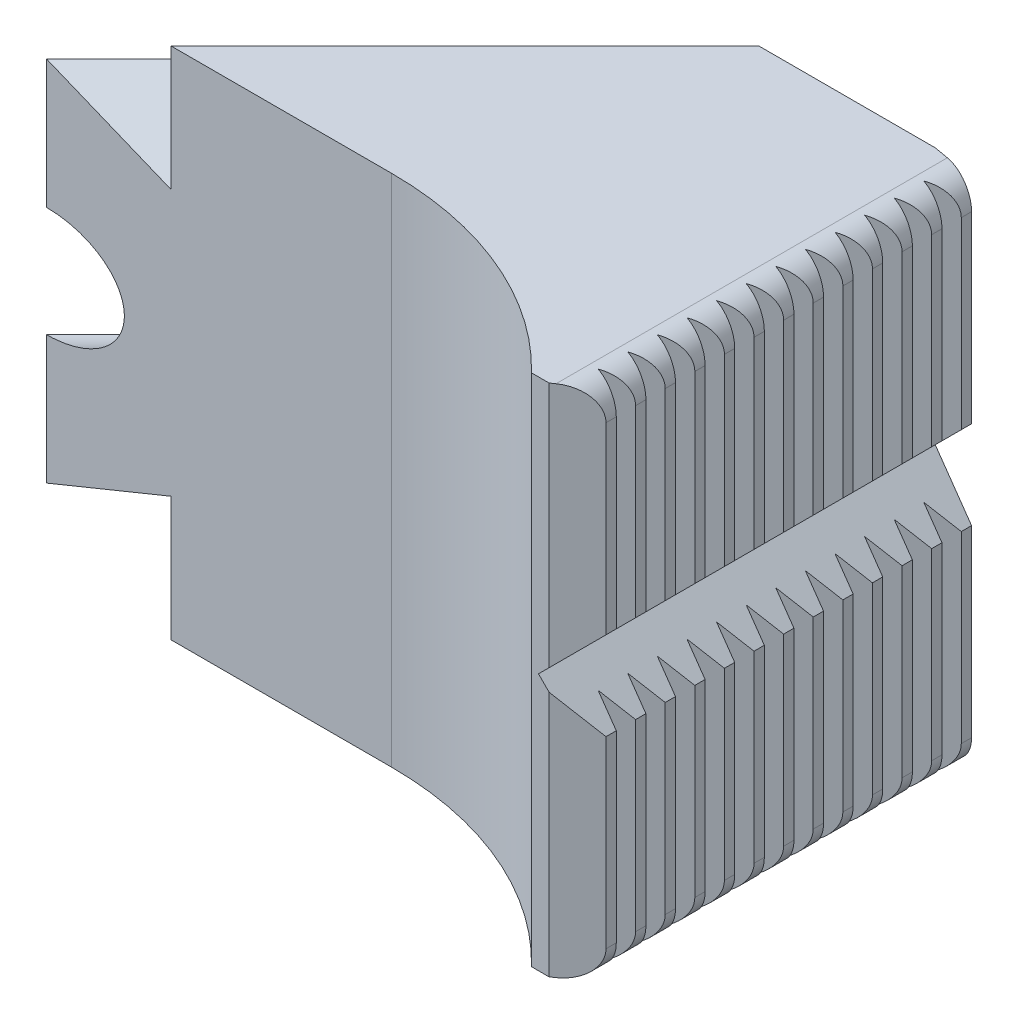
ISO-10303-21;
HEADER;
FILE_DESCRIPTION(('STEP AP214'),'2;1');
FILE_NAME('part.step','',(''),(''),'','','');
FILE_SCHEMA(('AUTOMOTIVE_DESIGN { 1 0 10303 214 1 1 1 1 }'));
ENDSEC;
DATA;
#1=APPLICATION_CONTEXT('core data for automotive mechanical design processes');
#2=APPLICATION_PROTOCOL_DEFINITION('international standard','automotive_design',2000,#1);
#3=PRODUCT_CONTEXT('',#1,'mechanical');
#4=PRODUCT('Part','Part','',(#3));
#5=PRODUCT_RELATED_PRODUCT_CATEGORY('part','',(#4));
#6=PRODUCT_DEFINITION_FORMATION('','',#4);
#7=PRODUCT_DEFINITION_CONTEXT('part definition',#1,'design');
#8=PRODUCT_DEFINITION('design','',#6,#7);
#9=PRODUCT_DEFINITION_SHAPE('','',#8);
#10=(LENGTH_UNIT() NAMED_UNIT(*) SI_UNIT(.MILLI.,.METRE.));
#11=(NAMED_UNIT(*) PLANE_ANGLE_UNIT() SI_UNIT($,.RADIAN.));
#12=(NAMED_UNIT(*) SI_UNIT($,.STERADIAN.) SOLID_ANGLE_UNIT());
#13=UNCERTAINTY_MEASURE_WITH_UNIT(LENGTH_MEASURE(1.E-05),#10,'distance_accuracy_value','');
#14=(GEOMETRIC_REPRESENTATION_CONTEXT(3) GLOBAL_UNCERTAINTY_ASSIGNED_CONTEXT((#13)) GLOBAL_UNIT_ASSIGNED_CONTEXT((#10,
#11,#12)) REPRESENTATION_CONTEXT('',''));
#15=CARTESIAN_POINT('',(0.,0.,0.));
#16=DIRECTION('',(0.,0.,1.));
#17=DIRECTION('',(1.,0.,0.));
#18=AXIS2_PLACEMENT_3D('',#15,#16,#17);
#19=CARTESIAN_POINT('',(23.4852813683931,-17.4999999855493,27.0000000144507));
#20=DIRECTION('',(1.,6.15308733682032E-10,6.15309564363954E-10));
#21=DIRECTION('',(-6.15308733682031E-10,1.,0.));
#22=AXIS2_PLACEMENT_3D('',#19,#20,#21);
#23=PLANE('',#22);
#24=DIRECTION('',(-6.15309564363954E-10,0.,1.));
#25=VECTOR('',#24,1.);
#26=CARTESIAN_POINT('',(23.4852813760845,-2.99999998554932,1.44507159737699E-08));
#27=LINE('',#26,#25);
#28=CARTESIAN_POINT('',(23.4852813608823,-2.99999998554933,24.7066022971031));
#29=VERTEX_POINT('',#28);
#30=CARTESIAN_POINT('',(23.4852813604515,-2.99999998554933,25.4066022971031));
#31=VERTEX_POINT('',#30);
#32=EDGE_CURVE('E769',#29,#31,#27,.T.);
#33=ORIENTED_EDGE('',*,*,#32,.T.);
#34=DIRECTION('',(-6.15308733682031E-10,1.,0.));
#35=VECTOR('',#34,1.);
#36=CARTESIAN_POINT('',(23.4852813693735,-17.4999999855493,25.4066022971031));
#37=LINE('',#36,#35);
#38=CARTESIAN_POINT('',(23.4852813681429,-15.4999999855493,25.4066022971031));
#39=VERTEX_POINT('',#38);
#40=EDGE_CURVE('E948',#39,#31,#37,.T.);
#41=ORIENTED_EDGE('',*,*,#40,.F.);
#42=DIRECTION('',(6.15309564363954E-10,0.,-1.));
#43=VECTOR('',#42,1.);
#44=CARTESIAN_POINT('',(23.4852813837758,-15.4999999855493,1.44507107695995E-08));
#45=LINE('',#44,#43);
#46=CARTESIAN_POINT('',(23.4852813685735,-15.4999999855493,24.7066022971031));
#47=VERTEX_POINT('',#46);
#48=EDGE_CURVE('E1173',#39,#47,#45,.T.);
#49=ORIENTED_EDGE('',*,*,#48,.T.);
#50=DIRECTION('',(-6.15308733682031E-10,1.,0.));
#51=VECTOR('',#50,1.);
#52=CARTESIAN_POINT('',(23.4852813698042,-17.4999999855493,24.7066022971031));
#53=LINE('',#52,#51);
#54=EDGE_CURVE('E951',#47,#29,#53,.T.);
#55=ORIENTED_EDGE('',*,*,#54,.T.);
#56=EDGE_LOOP('',(#33,#41,#49,#55));
#57=FACE_BOUND('',#56,.T.);
#58=ADVANCED_FACE('F14',(#57),#23,.T.);
#59=CARTESIAN_POINT('',(21.985281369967,-17.4999999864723,24.4421118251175));
#60=DIRECTION('',(-0.173648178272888,-1.06847650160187E-10,0.984807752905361));
#61=DIRECTION('',(0.984807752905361,6.05960739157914E-10,0.173648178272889));
#62=AXIS2_PLACEMENT_3D('',#59,#60,#61);
#63=PLANE('',#62);
#64=DIRECTION('',(-6.15308733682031E-10,1.,0.));
#65=VECTOR('',#64,1.);
#66=CARTESIAN_POINT('',(21.985281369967,-17.4999999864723,24.4421118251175));
#67=LINE('',#66,#65);
#68=CARTESIAN_POINT('',(21.9852813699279,-17.436491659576,24.4421118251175));
#69=VERTEX_POINT('',#68);
#70=CARTESIAN_POINT('',(21.985281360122,-1.49999998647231,24.4421118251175));
#71=VERTEX_POINT('',#70);
#72=EDGE_CURVE('E955',#69,#71,#67,.T.);
#73=ORIENTED_EDGE('',*,*,#72,.T.);
#74=DIRECTION('',(0.701673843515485,-0.701673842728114,0.123724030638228));
#75=VECTOR('',#74,1.);
#76=CARTESIAN_POINT('',(29.8628202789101,-9.37753889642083,25.8311344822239));
#77=LINE('',#76,#75);
#78=EDGE_CURVE('E855',#71,#29,#77,.T.);
#79=ORIENTED_EDGE('',*,*,#78,.T.);
#80=ORIENTED_EDGE('',*,*,#54,.F.);
#81=CARTESIAN_POINT('',(21.4852813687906,-15.4999999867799,24.3539483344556));
#82=DIRECTION('',(-0.173648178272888,-1.06847650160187E-10,0.984807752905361));
#83=DIRECTION('',(0.984807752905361,6.05959999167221E-10,0.173648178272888));
#84=AXIS2_PLACEMENT_3D('',#81,#82,#83);
#85=ELLIPSE('',#84,2.03085322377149,2.);
#86=EDGE_CURVE('E1143',#47,#69,#85,.F.);
#87=ORIENTED_EDGE('',*,*,#86,.T.);
#88=EDGE_LOOP('',(#73,#79,#80,#87));
#89=FACE_BOUND('',#88,.T.);
#90=ADVANCED_FACE('F1288',(#89),#63,.F.);
#91=CARTESIAN_POINT('',(23.4852813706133,-17.4999999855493,23.3918005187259));
#92=DIRECTION('',(-0.573576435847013,-3.52926249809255E-10,-0.81915204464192));
#93=DIRECTION('',(-0.81915204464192,-5.04031645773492E-10,0.573576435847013));
#94=AXIS2_PLACEMENT_3D('',#91,#92,#93);
#95=PLANE('',#94);
#96=DIRECTION('',(-6.15308733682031E-10,1.,0.));
#97=VECTOR('',#96,1.);
#98=CARTESIAN_POINT('',(23.4852813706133,-17.4999999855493,23.3918005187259));
#99=LINE('',#98,#97);
#100=CARTESIAN_POINT('',(23.4852813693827,-15.4999999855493,23.3918005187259));
#101=VERTEX_POINT('',#100);
#102=CARTESIAN_POINT('',(23.4852813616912,-2.99999998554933,23.3918005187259));
#103=VERTEX_POINT('',#102);
#104=EDGE_CURVE('E959',#101,#103,#99,.T.);
#105=ORIENTED_EDGE('',*,*,#104,.T.);
#106=DIRECTION('',(-0.633687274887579,0.633687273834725,0.443712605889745));
#107=VECTOR('',#106,1.);
#108=CARTESIAN_POINT('',(29.3078950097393,-8.82261362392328,19.3147625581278));
#109=LINE('',#108,#107);
#110=EDGE_CURVE('E858',#103,#71,#109,.T.);
#111=ORIENTED_EDGE('',*,*,#110,.T.);
#112=ORIENTED_EDGE('',*,*,#72,.F.);
#113=CARTESIAN_POINT('',(21.4852813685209,-15.4999999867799,24.7922155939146));
#114=DIRECTION('',(-0.573576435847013,-3.52926249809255E-10,-0.81915204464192));
#115=DIRECTION('',(-0.81915204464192,-5.04031869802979E-10,0.573576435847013));
#116=AXIS2_PLACEMENT_3D('',#113,#114,#115);
#117=ELLIPSE('',#116,2.44154917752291,2.);
#118=EDGE_CURVE('E1141',#69,#101,#117,.F.);
#119=ORIENTED_EDGE('',*,*,#118,.T.);
#120=EDGE_LOOP('',(#105,#111,#112,#119));
#121=FACE_BOUND('',#120,.T.);
#122=ADVANCED_FACE('F1292',(#121),#95,.F.);
#123=CARTESIAN_POINT('',(23.485281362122,-2.99999998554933,22.6918005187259));
#124=VERTEX_POINT('',#123);
#125=EDGE_CURVE('E772',#124,#103,#27,.T.);
#126=ORIENTED_EDGE('',*,*,#125,.T.);
#127=ORIENTED_EDGE('',*,*,#104,.F.);
#128=CARTESIAN_POINT('',(23.4852813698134,-15.4999999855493,22.6918005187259));
#129=VERTEX_POINT('',#128);
#130=EDGE_CURVE('E1297',#101,#129,#45,.T.);
#131=ORIENTED_EDGE('',*,*,#130,.T.);
#132=DIRECTION('',(-6.15308733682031E-10,1.,0.));
#133=VECTOR('',#132,1.);
#134=CARTESIAN_POINT('',(23.4852813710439,-17.4999999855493,22.6918005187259));
#135=LINE('',#134,#133);
#136=EDGE_CURVE('E963',#129,#124,#135,.T.);
#137=ORIENTED_EDGE('',*,*,#136,.T.);
#138=EDGE_LOOP('',(#126,#127,#131,#137));
#139=FACE_BOUND('',#138,.T.);
#140=ADVANCED_FACE('F1384',(#139),#23,.T.);
#141=CARTESIAN_POINT('',(21.9852813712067,-17.4999999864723,22.4273100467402));
#142=DIRECTION('',(-0.173648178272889,-1.06847650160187E-10,0.984807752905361));
#143=DIRECTION('',(0.984807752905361,6.05960739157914E-10,0.173648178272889));
#144=AXIS2_PLACEMENT_3D('',#141,#142,#143);
#145=PLANE('',#144);
#146=DIRECTION('',(-6.15308733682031E-10,1.,0.));
#147=VECTOR('',#146,1.);
#148=CARTESIAN_POINT('',(21.9852813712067,-17.4999999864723,22.4273100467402));
#149=LINE('',#148,#147);
#150=CARTESIAN_POINT('',(21.9852813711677,-17.436491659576,22.4273100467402));
#151=VERTEX_POINT('',#150);
#152=CARTESIAN_POINT('',(21.9852813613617,-1.4999999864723,22.4273100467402));
#153=VERTEX_POINT('',#152);
#154=EDGE_CURVE('E967',#151,#153,#149,.T.);
#155=ORIENTED_EDGE('',*,*,#154,.T.);
#156=DIRECTION('',(0.701673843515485,-0.701673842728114,0.123724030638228));
#157=VECTOR('',#156,1.);
#158=CARTESIAN_POINT('',(29.8628202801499,-9.37753889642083,23.8163327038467));
#159=LINE('',#158,#157);
#160=EDGE_CURVE('E861',#153,#124,#159,.T.);
#161=ORIENTED_EDGE('',*,*,#160,.T.);
#162=ORIENTED_EDGE('',*,*,#136,.F.);
#163=CARTESIAN_POINT('',(21.4852813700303,-15.4999999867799,22.3391465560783));
#164=DIRECTION('',(-0.173648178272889,-1.06847650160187E-10,0.984807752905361));
#165=DIRECTION('',(0.984807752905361,6.05959999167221E-10,0.173648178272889));
#166=AXIS2_PLACEMENT_3D('',#163,#164,#165);
#167=ELLIPSE('',#166,2.03085322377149,2.);
#168=EDGE_CURVE('E1139',#129,#151,#167,.F.);
#169=ORIENTED_EDGE('',*,*,#168,.T.);
#170=EDGE_LOOP('',(#155,#161,#162,#169));
#171=FACE_BOUND('',#170,.T.);
#172=ADVANCED_FACE('F1386',(#171),#145,.F.);
#173=CARTESIAN_POINT('',(23.485281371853,-17.4999999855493,21.3769987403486));
#174=DIRECTION('',(-0.573576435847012,-3.52926249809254E-10,-0.81915204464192));
#175=DIRECTION('',(-0.81915204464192,-5.04031645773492E-10,0.573576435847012));
#176=AXIS2_PLACEMENT_3D('',#173,#174,#175);
#177=PLANE('',#176);
#178=DIRECTION('',(-6.15308733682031E-10,1.,0.));
#179=VECTOR('',#178,1.);
#180=CARTESIAN_POINT('',(23.485281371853,-17.4999999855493,21.3769987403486));
#181=LINE('',#180,#179);
#182=CARTESIAN_POINT('',(23.4852813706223,-15.4999999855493,21.3769987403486));
#183=VERTEX_POINT('',#182);
#184=CARTESIAN_POINT('',(23.485281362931,-2.99999998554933,21.3769987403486));
#185=VERTEX_POINT('',#184);
#186=EDGE_CURVE('E971',#183,#185,#181,.T.);
#187=ORIENTED_EDGE('',*,*,#186,.T.);
#188=DIRECTION('',(-0.633687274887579,0.633687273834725,0.443712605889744));
#189=VECTOR('',#188,1.);
#190=CARTESIAN_POINT('',(29.3078950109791,-8.82261362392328,17.2999607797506));
#191=LINE('',#190,#189);
#192=EDGE_CURVE('E864',#185,#153,#191,.T.);
#193=ORIENTED_EDGE('',*,*,#192,.T.);
#194=ORIENTED_EDGE('',*,*,#154,.F.);
#195=CARTESIAN_POINT('',(21.4852813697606,-15.4999999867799,22.7774138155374));
#196=DIRECTION('',(-0.573576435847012,-3.52926249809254E-10,-0.81915204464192));
#197=DIRECTION('',(-0.81915204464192,-5.0403186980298E-10,0.573576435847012));
#198=AXIS2_PLACEMENT_3D('',#195,#196,#197);
#199=ELLIPSE('',#198,2.44154917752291,2.);
#200=EDGE_CURVE('E1137',#151,#183,#199,.F.);
#201=ORIENTED_EDGE('',*,*,#200,.T.);
#202=EDGE_LOOP('',(#187,#193,#194,#201));
#203=FACE_BOUND('',#202,.T.);
#204=ADVANCED_FACE('F1389',(#203),#177,.F.);
#205=CARTESIAN_POINT('',(23.4852813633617,-2.99999998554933,20.6769987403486));
#206=VERTEX_POINT('',#205);
#207=EDGE_CURVE('E1381',#206,#185,#27,.T.);
#208=ORIENTED_EDGE('',*,*,#207,.T.);
#209=ORIENTED_EDGE('',*,*,#186,.F.);
#210=CARTESIAN_POINT('',(23.485281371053,-15.4999999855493,20.6769987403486));
#211=VERTEX_POINT('',#210);
#212=EDGE_CURVE('E1300',#183,#211,#45,.T.);
#213=ORIENTED_EDGE('',*,*,#212,.T.);
#214=DIRECTION('',(-6.15308733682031E-10,1.,0.));
#215=VECTOR('',#214,1.);
#216=CARTESIAN_POINT('',(23.4852813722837,-17.4999999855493,20.6769987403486));
#217=LINE('',#216,#215);
#218=EDGE_CURVE('E975',#211,#206,#217,.T.);
#219=ORIENTED_EDGE('',*,*,#218,.T.);
#220=EDGE_LOOP('',(#208,#209,#213,#219));
#221=FACE_BOUND('',#220,.T.);
#222=ADVANCED_FACE('F1397',(#221),#23,.T.);
#223=CARTESIAN_POINT('',(21.9852813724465,-17.4999999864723,20.4125082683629));
#224=DIRECTION('',(-0.173648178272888,-1.06847650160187E-10,0.984807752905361));
#225=DIRECTION('',(0.984807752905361,6.05960739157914E-10,0.173648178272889));
#226=AXIS2_PLACEMENT_3D('',#223,#224,#225);
#227=PLANE('',#226);
#228=DIRECTION('',(-6.15308733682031E-10,1.,0.));
#229=VECTOR('',#228,1.);
#230=CARTESIAN_POINT('',(21.9852813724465,-17.4999999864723,20.4125082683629));
#231=LINE('',#230,#229);
#232=CARTESIAN_POINT('',(21.9852813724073,-17.436491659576,20.4125082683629));
#233=VERTEX_POINT('',#232);
#234=CARTESIAN_POINT('',(21.9852813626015,-1.4999999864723,20.4125082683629));
#235=VERTEX_POINT('',#234);
#236=EDGE_CURVE('E979',#233,#235,#231,.T.);
#237=ORIENTED_EDGE('',*,*,#236,.T.);
#238=DIRECTION('',(0.701673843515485,-0.701673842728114,0.123724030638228));
#239=VECTOR('',#238,1.);
#240=CARTESIAN_POINT('',(29.8628202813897,-9.37753889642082,21.8015309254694));
#241=LINE('',#240,#239);
#242=EDGE_CURVE('E867',#235,#206,#241,.T.);
#243=ORIENTED_EDGE('',*,*,#242,.T.);
#244=ORIENTED_EDGE('',*,*,#218,.F.);
#245=CARTESIAN_POINT('',(21.48528137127,-15.4999999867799,20.3243447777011));
#246=DIRECTION('',(-0.173648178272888,-1.06847650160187E-10,0.984807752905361));
#247=DIRECTION('',(0.984807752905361,6.05959999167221E-10,0.173648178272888));
#248=AXIS2_PLACEMENT_3D('',#245,#246,#247);
#249=ELLIPSE('',#248,2.03085322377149,2.);
#250=EDGE_CURVE('E1135',#211,#233,#249,.F.);
#251=ORIENTED_EDGE('',*,*,#250,.T.);
#252=EDGE_LOOP('',(#237,#243,#244,#251));
#253=FACE_BOUND('',#252,.T.);
#254=ADVANCED_FACE('F1394',(#253),#227,.F.);
#255=CARTESIAN_POINT('',(23.4852813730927,-17.4999999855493,19.3621969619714));
#256=DIRECTION('',(-0.573576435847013,-3.52926249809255E-10,-0.81915204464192));
#257=DIRECTION('',(-0.81915204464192,-5.04031645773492E-10,0.573576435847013));
#258=AXIS2_PLACEMENT_3D('',#255,#256,#257);
#259=PLANE('',#258);
#260=DIRECTION('',(-6.15308733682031E-10,1.,0.));
#261=VECTOR('',#260,1.);
#262=CARTESIAN_POINT('',(23.4852813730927,-17.4999999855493,19.3621969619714));
#263=LINE('',#262,#261);
#264=CARTESIAN_POINT('',(23.4852813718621,-15.4999999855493,19.3621969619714));
#265=VERTEX_POINT('',#264);
#266=CARTESIAN_POINT('',(23.4852813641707,-2.99999998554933,19.3621969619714));
#267=VERTEX_POINT('',#266);
#268=EDGE_CURVE('E983',#265,#267,#263,.T.);
#269=ORIENTED_EDGE('',*,*,#268,.T.);
#270=DIRECTION('',(-0.633687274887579,0.633687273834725,0.443712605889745));
#271=VECTOR('',#270,1.);
#272=CARTESIAN_POINT('',(29.3078950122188,-8.82261362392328,15.2851590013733));
#273=LINE('',#272,#271);
#274=EDGE_CURVE('E870',#267,#235,#273,.T.);
#275=ORIENTED_EDGE('',*,*,#274,.T.);
#276=ORIENTED_EDGE('',*,*,#236,.F.);
#277=CARTESIAN_POINT('',(21.4852813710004,-15.4999999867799,20.7626120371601));
#278=DIRECTION('',(-0.573576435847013,-3.52926249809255E-10,-0.81915204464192));
#279=DIRECTION('',(-0.81915204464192,-5.04031869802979E-10,0.573576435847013));
#280=AXIS2_PLACEMENT_3D('',#277,#278,#279);
#281=ELLIPSE('',#280,2.44154917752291,2.);
#282=EDGE_CURVE('E1133',#233,#265,#281,.F.);
#283=ORIENTED_EDGE('',*,*,#282,.T.);
#284=EDGE_LOOP('',(#269,#275,#276,#283));
#285=FACE_BOUND('',#284,.T.);
#286=ADVANCED_FACE('F1396',(#285),#259,.F.);
#287=CARTESIAN_POINT('',(23.4852813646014,-2.99999998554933,18.6621969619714));
#288=VERTEX_POINT('',#287);
#289=EDGE_CURVE('E1379',#288,#267,#27,.T.);
#290=ORIENTED_EDGE('',*,*,#289,.T.);
#291=ORIENTED_EDGE('',*,*,#268,.F.);
#292=CARTESIAN_POINT('',(23.4852813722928,-15.4999999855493,18.6621969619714));
#293=VERTEX_POINT('',#292);
#294=EDGE_CURVE('E1302',#265,#293,#45,.T.);
#295=ORIENTED_EDGE('',*,*,#294,.T.);
#296=DIRECTION('',(-6.15308733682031E-10,1.,0.));
#297=VECTOR('',#296,1.);
#298=CARTESIAN_POINT('',(23.4852813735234,-17.4999999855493,18.6621969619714));
#299=LINE('',#298,#297);
#300=EDGE_CURVE('E987',#293,#288,#299,.T.);
#301=ORIENTED_EDGE('',*,*,#300,.T.);
#302=EDGE_LOOP('',(#290,#291,#295,#301));
#303=FACE_BOUND('',#302,.T.);
#304=ADVANCED_FACE('F1400',(#303),#23,.T.);
#305=CARTESIAN_POINT('',(21.9852813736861,-17.4999999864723,18.3977064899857));
#306=DIRECTION('',(-0.173648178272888,-1.06847650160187E-10,0.984807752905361));
#307=DIRECTION('',(0.984807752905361,6.05960739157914E-10,0.173648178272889));
#308=AXIS2_PLACEMENT_3D('',#305,#306,#307);
#309=PLANE('',#308);
#310=DIRECTION('',(-6.15308733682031E-10,1.,0.));
#311=VECTOR('',#310,1.);
#312=CARTESIAN_POINT('',(21.9852813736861,-17.4999999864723,18.3977064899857));
#313=LINE('',#312,#311);
#314=CARTESIAN_POINT('',(21.9852813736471,-17.436491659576,18.3977064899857));
#315=VERTEX_POINT('',#314);
#316=CARTESIAN_POINT('',(21.9852813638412,-1.4999999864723,18.3977064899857));
#317=VERTEX_POINT('',#316);
#318=EDGE_CURVE('E991',#315,#317,#313,.T.);
#319=ORIENTED_EDGE('',*,*,#318,.T.);
#320=DIRECTION('',(0.701673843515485,-0.701673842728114,0.123724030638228));
#321=VECTOR('',#320,1.);
#322=CARTESIAN_POINT('',(29.8628202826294,-9.37753889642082,19.7867291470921));
#323=LINE('',#322,#321);
#324=EDGE_CURVE('E873',#317,#288,#323,.T.);
#325=ORIENTED_EDGE('',*,*,#324,.T.);
#326=ORIENTED_EDGE('',*,*,#300,.F.);
#327=CARTESIAN_POINT('',(21.4852813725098,-15.4999999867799,18.3095429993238));
#328=DIRECTION('',(-0.173648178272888,-1.06847650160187E-10,0.984807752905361));
#329=DIRECTION('',(0.984807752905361,6.05959999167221E-10,0.173648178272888));
#330=AXIS2_PLACEMENT_3D('',#327,#328,#329);
#331=ELLIPSE('',#330,2.03085322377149,2.);
#332=EDGE_CURVE('E1131',#293,#315,#331,.F.);
#333=ORIENTED_EDGE('',*,*,#332,.T.);
#334=EDGE_LOOP('',(#319,#325,#326,#333));
#335=FACE_BOUND('',#334,.T.);
#336=ADVANCED_FACE('F1415',(#335),#309,.F.);
#337=CARTESIAN_POINT('',(23.4852813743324,-17.4999999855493,17.3473951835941));
#338=DIRECTION('',(-0.573576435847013,-3.52926249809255E-10,-0.81915204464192));
#339=DIRECTION('',(-0.81915204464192,-5.04031645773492E-10,0.573576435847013));
#340=AXIS2_PLACEMENT_3D('',#337,#338,#339);
#341=PLANE('',#340);
#342=DIRECTION('',(-6.15308733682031E-10,1.,0.));
#343=VECTOR('',#342,1.);
#344=CARTESIAN_POINT('',(23.4852813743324,-17.4999999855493,17.3473951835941));
#345=LINE('',#344,#343);
#346=CARTESIAN_POINT('',(23.4852813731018,-15.4999999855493,17.3473951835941));
#347=VERTEX_POINT('',#346);
#348=CARTESIAN_POINT('',(23.4852813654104,-2.99999998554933,17.3473951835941));
#349=VERTEX_POINT('',#348);
#350=EDGE_CURVE('E995',#347,#349,#345,.T.);
#351=ORIENTED_EDGE('',*,*,#350,.T.);
#352=DIRECTION('',(-0.633687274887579,0.633687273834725,0.443712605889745));
#353=VECTOR('',#352,1.);
#354=CARTESIAN_POINT('',(29.3078950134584,-8.82261362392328,13.270357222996));
#355=LINE('',#354,#353);
#356=EDGE_CURVE('E876',#349,#317,#355,.T.);
#357=ORIENTED_EDGE('',*,*,#356,.T.);
#358=ORIENTED_EDGE('',*,*,#318,.F.);
#359=CARTESIAN_POINT('',(21.4852813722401,-15.4999999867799,18.7478102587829));
#360=DIRECTION('',(-0.573576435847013,-3.52926249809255E-10,-0.81915204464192));
#361=DIRECTION('',(-0.81915204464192,-5.04031869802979E-10,0.573576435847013));
#362=AXIS2_PLACEMENT_3D('',#359,#360,#361);
#363=ELLIPSE('',#362,2.44154917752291,2.);
#364=EDGE_CURVE('E1129',#315,#347,#363,.F.);
#365=ORIENTED_EDGE('',*,*,#364,.T.);
#366=EDGE_LOOP('',(#351,#357,#358,#365));
#367=FACE_BOUND('',#366,.T.);
#368=ADVANCED_FACE('F1509',(#367),#341,.F.);
#369=CARTESIAN_POINT('',(23.4852813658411,-2.99999998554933,16.6473951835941));
#370=VERTEX_POINT('',#369);
#371=EDGE_CURVE('E1377',#370,#349,#27,.T.);
#372=ORIENTED_EDGE('',*,*,#371,.T.);
#373=ORIENTED_EDGE('',*,*,#350,.F.);
#374=CARTESIAN_POINT('',(23.4852813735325,-15.4999999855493,16.6473951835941));
#375=VERTEX_POINT('',#374);
#376=EDGE_CURVE('E1307',#347,#375,#45,.T.);
#377=ORIENTED_EDGE('',*,*,#376,.T.);
#378=DIRECTION('',(-6.15308733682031E-10,1.,0.));
#379=VECTOR('',#378,1.);
#380=CARTESIAN_POINT('',(23.4852813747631,-17.4999999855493,16.6473951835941));
#381=LINE('',#380,#379);
#382=EDGE_CURVE('E999',#375,#370,#381,.T.);
#383=ORIENTED_EDGE('',*,*,#382,.T.);
#384=EDGE_LOOP('',(#372,#373,#377,#383));
#385=FACE_BOUND('',#384,.T.);
#386=ADVANCED_FACE('F1416',(#385),#23,.T.);
#387=CARTESIAN_POINT('',(21.9852813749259,-17.4999999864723,16.3829047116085));
#388=DIRECTION('',(-0.173648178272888,-1.06847650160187E-10,0.984807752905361));
#389=DIRECTION('',(0.984807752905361,6.05960739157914E-10,0.173648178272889));
#390=AXIS2_PLACEMENT_3D('',#387,#388,#389);
#391=PLANE('',#390);
#392=DIRECTION('',(-6.15308733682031E-10,1.,0.));
#393=VECTOR('',#392,1.);
#394=CARTESIAN_POINT('',(21.9852813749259,-17.4999999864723,16.3829047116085));
#395=LINE('',#394,#393);
#396=CARTESIAN_POINT('',(21.9852813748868,-17.436491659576,16.3829047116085));
#397=VERTEX_POINT('',#396);
#398=CARTESIAN_POINT('',(21.985281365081,-1.4999999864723,16.3829047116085));
#399=VERTEX_POINT('',#398);
#400=EDGE_CURVE('E1003',#397,#399,#395,.T.);
#401=ORIENTED_EDGE('',*,*,#400,.T.);
#402=DIRECTION('',(0.701673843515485,-0.701673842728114,0.123724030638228));
#403=VECTOR('',#402,1.);
#404=CARTESIAN_POINT('',(29.8628202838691,-9.37753889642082,17.7719273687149));
#405=LINE('',#404,#403);
#406=EDGE_CURVE('E879',#399,#370,#405,.T.);
#407=ORIENTED_EDGE('',*,*,#406,.T.);
#408=ORIENTED_EDGE('',*,*,#382,.F.);
#409=CARTESIAN_POINT('',(21.4852813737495,-15.4999999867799,16.2947412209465));
#410=DIRECTION('',(-0.173648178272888,-1.06847650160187E-10,0.984807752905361));
#411=DIRECTION('',(0.984807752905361,6.05959999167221E-10,0.173648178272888));
#412=AXIS2_PLACEMENT_3D('',#409,#410,#411);
#413=ELLIPSE('',#412,2.03085322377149,2.);
#414=EDGE_CURVE('E1127',#375,#397,#413,.F.);
#415=ORIENTED_EDGE('',*,*,#414,.T.);
#416=EDGE_LOOP('',(#401,#407,#408,#415));
#417=FACE_BOUND('',#416,.T.);
#418=ADVANCED_FACE('F1515',(#417),#391,.F.);
#419=CARTESIAN_POINT('',(23.4852813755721,-17.4999999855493,15.3325934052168));
#420=DIRECTION('',(-0.573576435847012,-3.52926249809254E-10,-0.81915204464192));
#421=DIRECTION('',(-0.81915204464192,-5.04031645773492E-10,0.573576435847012));
#422=AXIS2_PLACEMENT_3D('',#419,#420,#421);
#423=PLANE('',#422);
#424=DIRECTION('',(-6.15308733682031E-10,1.,0.));
#425=VECTOR('',#424,1.);
#426=CARTESIAN_POINT('',(23.4852813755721,-17.4999999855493,15.3325934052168));
#427=LINE('',#426,#425);
#428=CARTESIAN_POINT('',(23.4852813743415,-15.4999999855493,15.3325934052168));
#429=VERTEX_POINT('',#428);
#430=CARTESIAN_POINT('',(23.4852813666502,-2.99999998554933,15.3325934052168));
#431=VERTEX_POINT('',#430);
#432=EDGE_CURVE('E1007',#429,#431,#427,.T.);
#433=ORIENTED_EDGE('',*,*,#432,.T.);
#434=DIRECTION('',(-0.633687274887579,0.633687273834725,0.443712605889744));
#435=VECTOR('',#434,1.);
#436=CARTESIAN_POINT('',(29.3078950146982,-8.82261362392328,11.2555554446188));
#437=LINE('',#436,#435);
#438=EDGE_CURVE('E882',#431,#399,#437,.T.);
#439=ORIENTED_EDGE('',*,*,#438,.T.);
#440=ORIENTED_EDGE('',*,*,#400,.F.);
#441=CARTESIAN_POINT('',(21.4852813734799,-15.4999999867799,16.7330084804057));
#442=DIRECTION('',(-0.573576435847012,-3.52926249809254E-10,-0.81915204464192));
#443=DIRECTION('',(-0.81915204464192,-5.0403186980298E-10,0.573576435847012));
#444=AXIS2_PLACEMENT_3D('',#441,#442,#443);
#445=ELLIPSE('',#444,2.44154917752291,2.);
#446=EDGE_CURVE('E1125',#397,#429,#445,.F.);
#447=ORIENTED_EDGE('',*,*,#446,.T.);
#448=EDGE_LOOP('',(#433,#439,#440,#447));
#449=FACE_BOUND('',#448,.T.);
#450=ADVANCED_FACE('F1520',(#449),#423,.F.);
#451=CARTESIAN_POINT('',(23.4852813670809,-2.99999998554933,14.6325934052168));
#452=VERTEX_POINT('',#451);
#453=EDGE_CURVE('E1375',#452,#431,#27,.T.);
#454=ORIENTED_EDGE('',*,*,#453,.T.);
#455=ORIENTED_EDGE('',*,*,#432,.F.);
#456=CARTESIAN_POINT('',(23.4852813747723,-15.4999999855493,14.6325934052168));
#457=VERTEX_POINT('',#456);
#458=EDGE_CURVE('E1312',#429,#457,#45,.T.);
#459=ORIENTED_EDGE('',*,*,#458,.T.);
#460=DIRECTION('',(-6.15308733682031E-10,1.,0.));
#461=VECTOR('',#460,1.);
#462=CARTESIAN_POINT('',(23.4852813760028,-17.4999999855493,14.6325934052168));
#463=LINE('',#462,#461);
#464=EDGE_CURVE('E1011',#457,#452,#463,.T.);
#465=ORIENTED_EDGE('',*,*,#464,.T.);
#466=EDGE_LOOP('',(#454,#455,#459,#465));
#467=FACE_BOUND('',#466,.T.);
#468=ADVANCED_FACE('F2355',(#467),#23,.T.);
#469=CARTESIAN_POINT('',(21.9852813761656,-17.4999999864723,14.3681029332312));
#470=DIRECTION('',(-0.173648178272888,-1.06847650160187E-10,0.984807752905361));
#471=DIRECTION('',(0.984807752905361,6.05960739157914E-10,0.173648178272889));
#472=AXIS2_PLACEMENT_3D('',#469,#470,#471);
#473=PLANE('',#472);
#474=DIRECTION('',(-6.15308733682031E-10,1.,0.));
#475=VECTOR('',#474,1.);
#476=CARTESIAN_POINT('',(21.9852813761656,-17.4999999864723,14.3681029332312));
#477=LINE('',#476,#475);
#478=CARTESIAN_POINT('',(21.9852813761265,-17.436491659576,14.3681029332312));
#479=VERTEX_POINT('',#478);
#480=CARTESIAN_POINT('',(21.9852813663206,-1.4999999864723,14.3681029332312));
#481=VERTEX_POINT('',#480);
#482=EDGE_CURVE('E1015',#479,#481,#477,.T.);
#483=ORIENTED_EDGE('',*,*,#482,.T.);
#484=DIRECTION('',(0.701673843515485,-0.701673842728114,0.123724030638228));
#485=VECTOR('',#484,1.);
#486=CARTESIAN_POINT('',(29.8628202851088,-9.37753889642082,15.7571255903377));
#487=LINE('',#486,#485);
#488=EDGE_CURVE('E885',#481,#452,#487,.T.);
#489=ORIENTED_EDGE('',*,*,#488,.T.);
#490=ORIENTED_EDGE('',*,*,#464,.F.);
#491=CARTESIAN_POINT('',(21.4852813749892,-15.4999999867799,14.2799394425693));
#492=DIRECTION('',(-0.173648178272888,-1.06847650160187E-10,0.984807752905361));
#493=DIRECTION('',(0.984807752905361,6.05959999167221E-10,0.173648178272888));
#494=AXIS2_PLACEMENT_3D('',#491,#492,#493);
#495=ELLIPSE('',#494,2.03085322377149,2.);
#496=EDGE_CURVE('E1123',#457,#479,#495,.F.);
#497=ORIENTED_EDGE('',*,*,#496,.T.);
#498=EDGE_LOOP('',(#483,#489,#490,#497));
#499=FACE_BOUND('',#498,.T.);
#500=ADVANCED_FACE('F1526',(#499),#473,.F.);
#501=CARTESIAN_POINT('',(23.4852813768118,-17.4999999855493,13.3177916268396));
#502=DIRECTION('',(-0.573576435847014,-3.52926249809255E-10,-0.819152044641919));
#503=DIRECTION('',(-0.819152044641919,-5.04031645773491E-10,0.573576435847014));
#504=AXIS2_PLACEMENT_3D('',#501,#502,#503);
#505=PLANE('',#504);
#506=DIRECTION('',(-6.15308733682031E-10,1.,0.));
#507=VECTOR('',#506,1.);
#508=CARTESIAN_POINT('',(23.4852813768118,-17.4999999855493,13.3177916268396));
#509=LINE('',#508,#507);
#510=CARTESIAN_POINT('',(23.4852813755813,-15.4999999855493,13.3177916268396));
#511=VERTEX_POINT('',#510);
#512=CARTESIAN_POINT('',(23.4852813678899,-2.99999998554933,13.3177916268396));
#513=VERTEX_POINT('',#512);
#514=EDGE_CURVE('E1019',#511,#513,#509,.T.);
#515=ORIENTED_EDGE('',*,*,#514,.T.);
#516=DIRECTION('',(-0.633687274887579,0.633687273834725,0.443712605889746));
#517=VECTOR('',#516,1.);
#518=CARTESIAN_POINT('',(29.307895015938,-8.82261362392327,9.24075366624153));
#519=LINE('',#518,#517);
#520=EDGE_CURVE('E888',#513,#481,#519,.T.);
#521=ORIENTED_EDGE('',*,*,#520,.T.);
#522=ORIENTED_EDGE('',*,*,#482,.F.);
#523=CARTESIAN_POINT('',(21.4852813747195,-15.4999999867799,14.7182067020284));
#524=DIRECTION('',(-0.573576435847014,-3.52926249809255E-10,-0.819152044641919));
#525=DIRECTION('',(-0.819152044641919,-5.04031869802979E-10,0.573576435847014));
#526=AXIS2_PLACEMENT_3D('',#523,#524,#525);
#527=ELLIPSE('',#526,2.44154917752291,2.);
#528=EDGE_CURVE('E1121',#479,#511,#527,.F.);
#529=ORIENTED_EDGE('',*,*,#528,.T.);
#530=EDGE_LOOP('',(#515,#521,#522,#529));
#531=FACE_BOUND('',#530,.T.);
#532=ADVANCED_FACE('F1531',(#531),#505,.F.);
#533=CARTESIAN_POINT('',(23.4852813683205,-2.99999998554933,12.6177916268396));
#534=VERTEX_POINT('',#533);
#535=EDGE_CURVE('E1373',#534,#513,#27,.T.);
#536=ORIENTED_EDGE('',*,*,#535,.T.);
#537=ORIENTED_EDGE('',*,*,#514,.F.);
#538=CARTESIAN_POINT('',(23.485281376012,-15.4999999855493,12.6177916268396));
#539=VERTEX_POINT('',#538);
#540=EDGE_CURVE('E1317',#511,#539,#45,.T.);
#541=ORIENTED_EDGE('',*,*,#540,.T.);
#542=DIRECTION('',(-6.15308733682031E-10,1.,0.));
#543=VECTOR('',#542,1.);
#544=CARTESIAN_POINT('',(23.4852813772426,-17.4999999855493,12.6177916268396));
#545=LINE('',#544,#543);
#546=EDGE_CURVE('E1023',#539,#534,#545,.T.);
#547=ORIENTED_EDGE('',*,*,#546,.T.);
#548=EDGE_LOOP('',(#536,#537,#541,#547));
#549=FACE_BOUND('',#548,.T.);
#550=ADVANCED_FACE('F2334',(#549),#23,.T.);
#551=CARTESIAN_POINT('',(21.9852813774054,-17.4999999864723,12.3533011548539));
#552=DIRECTION('',(-0.17364817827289,-1.06847650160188E-10,0.984807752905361));
#553=DIRECTION('',(0.984807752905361,6.05960739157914E-10,0.17364817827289));
#554=AXIS2_PLACEMENT_3D('',#551,#552,#553);
#555=PLANE('',#554);
#556=DIRECTION('',(-6.15308733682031E-10,1.,0.));
#557=VECTOR('',#556,1.);
#558=CARTESIAN_POINT('',(21.9852813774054,-17.4999999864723,12.3533011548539));
#559=LINE('',#558,#557);
#560=CARTESIAN_POINT('',(21.9852813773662,-17.436491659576,12.3533011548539));
#561=VERTEX_POINT('',#560);
#562=CARTESIAN_POINT('',(21.9852813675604,-1.4999999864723,12.3533011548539));
#563=VERTEX_POINT('',#562);
#564=EDGE_CURVE('E1027',#561,#563,#559,.T.);
#565=ORIENTED_EDGE('',*,*,#564,.T.);
#566=DIRECTION('',(0.701673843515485,-0.701673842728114,0.123724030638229));
#567=VECTOR('',#566,1.);
#568=CARTESIAN_POINT('',(29.8628202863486,-9.37753889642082,13.7423238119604));
#569=LINE('',#568,#567);
#570=EDGE_CURVE('E891',#563,#534,#569,.T.);
#571=ORIENTED_EDGE('',*,*,#570,.T.);
#572=ORIENTED_EDGE('',*,*,#546,.F.);
#573=CARTESIAN_POINT('',(21.485281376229,-15.4999999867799,12.265137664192));
#574=DIRECTION('',(-0.17364817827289,-1.06847650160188E-10,0.984807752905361));
#575=DIRECTION('',(0.984807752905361,6.05959999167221E-10,0.17364817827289));
#576=AXIS2_PLACEMENT_3D('',#573,#574,#575);
#577=ELLIPSE('',#576,2.03085322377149,2.);
#578=EDGE_CURVE('E1119',#539,#561,#577,.F.);
#579=ORIENTED_EDGE('',*,*,#578,.T.);
#580=EDGE_LOOP('',(#565,#571,#572,#579));
#581=FACE_BOUND('',#580,.T.);
#582=ADVANCED_FACE('F1537',(#581),#555,.F.);
#583=CARTESIAN_POINT('',(23.4852813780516,-17.4999999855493,11.3029898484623));
#584=DIRECTION('',(-0.573576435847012,-3.52926249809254E-10,-0.81915204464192));
#585=DIRECTION('',(-0.81915204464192,-5.04031645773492E-10,0.573576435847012));
#586=AXIS2_PLACEMENT_3D('',#583,#584,#585);
#587=PLANE('',#586);
#588=DIRECTION('',(-6.15308733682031E-10,1.,0.));
#589=VECTOR('',#588,1.);
#590=CARTESIAN_POINT('',(23.4852813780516,-17.4999999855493,11.3029898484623));
#591=LINE('',#590,#589);
#592=CARTESIAN_POINT('',(23.485281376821,-15.4999999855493,11.3029898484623));
#593=VERTEX_POINT('',#592);
#594=CARTESIAN_POINT('',(23.4852813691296,-2.99999998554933,11.3029898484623));
#595=VERTEX_POINT('',#594);
#596=EDGE_CURVE('E1031',#593,#595,#591,.T.);
#597=ORIENTED_EDGE('',*,*,#596,.T.);
#598=DIRECTION('',(-0.633687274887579,0.633687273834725,0.443712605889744));
#599=VECTOR('',#598,1.);
#600=CARTESIAN_POINT('',(29.3078950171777,-8.82261362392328,7.22595188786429));
#601=LINE('',#600,#599);
#602=EDGE_CURVE('E894',#595,#563,#601,.T.);
#603=ORIENTED_EDGE('',*,*,#602,.T.);
#604=ORIENTED_EDGE('',*,*,#564,.F.);
#605=CARTESIAN_POINT('',(21.4852813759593,-15.4999999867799,12.7034049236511));
#606=DIRECTION('',(-0.573576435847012,-3.52926249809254E-10,-0.81915204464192));
#607=DIRECTION('',(-0.81915204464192,-5.0403186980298E-10,0.573576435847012));
#608=AXIS2_PLACEMENT_3D('',#605,#606,#607);
#609=ELLIPSE('',#608,2.44154917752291,2.);
#610=EDGE_CURVE('E1117',#561,#593,#609,.F.);
#611=ORIENTED_EDGE('',*,*,#610,.T.);
#612=EDGE_LOOP('',(#597,#603,#604,#611));
#613=FACE_BOUND('',#612,.T.);
#614=ADVANCED_FACE('F1542',(#613),#587,.F.);
#615=CARTESIAN_POINT('',(23.4852813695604,-2.99999998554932,10.6029898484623));
#616=VERTEX_POINT('',#615);
#617=EDGE_CURVE('E1371',#616,#595,#27,.T.);
#618=ORIENTED_EDGE('',*,*,#617,.T.);
#619=ORIENTED_EDGE('',*,*,#596,.F.);
#620=CARTESIAN_POINT('',(23.4852813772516,-15.4999999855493,10.6029898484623));
#621=VERTEX_POINT('',#620);
#622=EDGE_CURVE('E1322',#593,#621,#45,.T.);
#623=ORIENTED_EDGE('',*,*,#622,.T.);
#624=DIRECTION('',(-6.15308733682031E-10,1.,0.));
#625=VECTOR('',#624,1.);
#626=CARTESIAN_POINT('',(23.4852813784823,-17.4999999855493,10.6029898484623));
#627=LINE('',#626,#625);
#628=EDGE_CURVE('E1035',#621,#616,#627,.T.);
#629=ORIENTED_EDGE('',*,*,#628,.T.);
#630=EDGE_LOOP('',(#618,#619,#623,#629));
#631=FACE_BOUND('',#630,.T.);
#632=ADVANCED_FACE('F2313',(#631),#23,.T.);
#633=CARTESIAN_POINT('',(21.985281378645,-17.4999999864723,10.3384993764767));
#634=DIRECTION('',(-0.17364817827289,-1.06847650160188E-10,0.984807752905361));
#635=DIRECTION('',(0.984807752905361,6.05960739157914E-10,0.17364817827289));
#636=AXIS2_PLACEMENT_3D('',#633,#634,#635);
#637=PLANE('',#636);
#638=DIRECTION('',(-6.15308733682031E-10,1.,0.));
#639=VECTOR('',#638,1.);
#640=CARTESIAN_POINT('',(21.985281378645,-17.4999999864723,10.3384993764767));
#641=LINE('',#640,#639);
#642=CARTESIAN_POINT('',(21.985281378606,-17.436491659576,10.3384993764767));
#643=VERTEX_POINT('',#642);
#644=CARTESIAN_POINT('',(21.9852813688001,-1.4999999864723,10.3384993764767));
#645=VERTEX_POINT('',#644);
#646=EDGE_CURVE('E1039',#643,#645,#641,.T.);
#647=ORIENTED_EDGE('',*,*,#646,.T.);
#648=DIRECTION('',(0.701673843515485,-0.701673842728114,0.123724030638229));
#649=VECTOR('',#648,1.);
#650=CARTESIAN_POINT('',(29.8628202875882,-9.37753889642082,11.7275220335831));
#651=LINE('',#650,#649);
#652=EDGE_CURVE('E897',#645,#616,#651,.T.);
#653=ORIENTED_EDGE('',*,*,#652,.T.);
#654=ORIENTED_EDGE('',*,*,#628,.F.);
#655=CARTESIAN_POINT('',(21.4852813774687,-15.4999999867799,10.2503358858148));
#656=DIRECTION('',(-0.17364817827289,-1.06847650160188E-10,0.984807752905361));
#657=DIRECTION('',(0.984807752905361,6.05959999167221E-10,0.17364817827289));
#658=AXIS2_PLACEMENT_3D('',#655,#656,#657);
#659=ELLIPSE('',#658,2.03085322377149,2.);
#660=EDGE_CURVE('E1115',#621,#643,#659,.F.);
#661=ORIENTED_EDGE('',*,*,#660,.T.);
#662=EDGE_LOOP('',(#647,#653,#654,#661));
#663=FACE_BOUND('',#662,.T.);
#664=ADVANCED_FACE('F1548',(#663),#637,.F.);
#665=CARTESIAN_POINT('',(23.4852813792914,-17.4999999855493,9.28818807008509));
#666=DIRECTION('',(-0.573576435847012,-3.52926249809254E-10,-0.81915204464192));
#667=DIRECTION('',(-0.81915204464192,-5.04031645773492E-10,0.573576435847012));
#668=AXIS2_PLACEMENT_3D('',#665,#666,#667);
#669=PLANE('',#668);
#670=DIRECTION('',(-6.15308733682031E-10,1.,0.));
#671=VECTOR('',#670,1.);
#672=CARTESIAN_POINT('',(23.4852813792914,-17.4999999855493,9.28818807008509));
#673=LINE('',#672,#671);
#674=CARTESIAN_POINT('',(23.4852813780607,-15.4999999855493,9.28818807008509));
#675=VERTEX_POINT('',#674);
#676=CARTESIAN_POINT('',(23.4852813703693,-2.99999998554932,9.2881880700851));
#677=VERTEX_POINT('',#676);
#678=EDGE_CURVE('E1043',#675,#677,#673,.T.);
#679=ORIENTED_EDGE('',*,*,#678,.T.);
#680=DIRECTION('',(-0.633687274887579,0.633687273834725,0.443712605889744));
#681=VECTOR('',#680,1.);
#682=CARTESIAN_POINT('',(29.3078950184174,-8.82261362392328,5.21115010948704));
#683=LINE('',#682,#681);
#684=EDGE_CURVE('E900',#677,#645,#683,.T.);
#685=ORIENTED_EDGE('',*,*,#684,.T.);
#686=ORIENTED_EDGE('',*,*,#646,.F.);
#687=CARTESIAN_POINT('',(21.485281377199,-15.4999999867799,10.6886031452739));
#688=DIRECTION('',(-0.573576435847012,-3.52926249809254E-10,-0.81915204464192));
#689=DIRECTION('',(-0.81915204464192,-5.0403186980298E-10,0.573576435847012));
#690=AXIS2_PLACEMENT_3D('',#687,#688,#689);
#691=ELLIPSE('',#690,2.44154917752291,2.);
#692=EDGE_CURVE('E1113',#643,#675,#691,.F.);
#693=ORIENTED_EDGE('',*,*,#692,.T.);
#694=EDGE_LOOP('',(#679,#685,#686,#693));
#695=FACE_BOUND('',#694,.T.);
#696=ADVANCED_FACE('F1553',(#695),#669,.F.);
#697=CARTESIAN_POINT('',(23.4852813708,-2.99999998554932,8.5881880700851));
#698=VERTEX_POINT('',#697);
#699=EDGE_CURVE('E1369',#698,#677,#27,.T.);
#700=ORIENTED_EDGE('',*,*,#699,.T.);
#701=ORIENTED_EDGE('',*,*,#678,.F.);
#702=CARTESIAN_POINT('',(23.4852813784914,-15.4999999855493,8.58818807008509));
#703=VERTEX_POINT('',#702);
#704=EDGE_CURVE('E1327',#675,#703,#45,.T.);
#705=ORIENTED_EDGE('',*,*,#704,.T.);
#706=DIRECTION('',(-6.15308733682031E-10,1.,0.));
#707=VECTOR('',#706,1.);
#708=CARTESIAN_POINT('',(23.485281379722,-17.4999999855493,8.58818807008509));
#709=LINE('',#708,#707);
#710=EDGE_CURVE('E1047',#703,#698,#709,.T.);
#711=ORIENTED_EDGE('',*,*,#710,.T.);
#712=EDGE_LOOP('',(#700,#701,#705,#711));
#713=FACE_BOUND('',#712,.T.);
#714=ADVANCED_FACE('F2292',(#713),#23,.T.);
#715=CARTESIAN_POINT('',(21.9852813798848,-17.4999999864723,8.32369759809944));
#716=DIRECTION('',(-0.173648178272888,-1.06847650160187E-10,0.984807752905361));
#717=DIRECTION('',(0.984807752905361,6.05960739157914E-10,0.173648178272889));
#718=AXIS2_PLACEMENT_3D('',#715,#716,#717);
#719=PLANE('',#718);
#720=DIRECTION('',(-6.15308733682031E-10,1.,0.));
#721=VECTOR('',#720,1.);
#722=CARTESIAN_POINT('',(21.9852813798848,-17.4999999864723,8.32369759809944));
#723=LINE('',#722,#721);
#724=CARTESIAN_POINT('',(21.9852813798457,-17.436491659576,8.32369759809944));
#725=VERTEX_POINT('',#724);
#726=CARTESIAN_POINT('',(21.9852813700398,-1.4999999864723,8.32369759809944));
#727=VERTEX_POINT('',#726);
#728=EDGE_CURVE('E1051',#725,#727,#723,.T.);
#729=ORIENTED_EDGE('',*,*,#728,.T.);
#730=DIRECTION('',(0.701673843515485,-0.701673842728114,0.123724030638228));
#731=VECTOR('',#730,1.);
#732=CARTESIAN_POINT('',(29.862820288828,-9.37753889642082,9.7127202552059));
#733=LINE('',#732,#731);
#734=EDGE_CURVE('E903',#727,#698,#733,.T.);
#735=ORIENTED_EDGE('',*,*,#734,.T.);
#736=ORIENTED_EDGE('',*,*,#710,.F.);
#737=CARTESIAN_POINT('',(21.4852813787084,-15.4999999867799,8.23553410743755));
#738=DIRECTION('',(-0.173648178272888,-1.06847650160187E-10,0.984807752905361));
#739=DIRECTION('',(0.984807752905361,6.05959999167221E-10,0.173648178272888));
#740=AXIS2_PLACEMENT_3D('',#737,#738,#739);
#741=ELLIPSE('',#740,2.03085322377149,2.);
#742=EDGE_CURVE('E1111',#703,#725,#741,.F.);
#743=ORIENTED_EDGE('',*,*,#742,.T.);
#744=EDGE_LOOP('',(#729,#735,#736,#743));
#745=FACE_BOUND('',#744,.T.);
#746=ADVANCED_FACE('F1559',(#745),#719,.F.);
#747=CARTESIAN_POINT('',(23.485281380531,-17.4999999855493,7.27338629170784));
#748=DIRECTION('',(-0.573576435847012,-3.52926249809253E-10,-0.819152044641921));
#749=DIRECTION('',(-0.819152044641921,-5.04031645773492E-10,0.573576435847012));
#750=AXIS2_PLACEMENT_3D('',#747,#748,#749);
#751=PLANE('',#750);
#752=DIRECTION('',(-6.15308733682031E-10,1.,0.));
#753=VECTOR('',#752,1.);
#754=CARTESIAN_POINT('',(23.485281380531,-17.4999999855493,7.27338629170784));
#755=LINE('',#754,#753);
#756=CARTESIAN_POINT('',(23.4852813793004,-15.4999999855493,7.27338629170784));
#757=VERTEX_POINT('',#756);
#758=CARTESIAN_POINT('',(23.4852813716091,-2.99999998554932,7.27338629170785));
#759=VERTEX_POINT('',#758);
#760=EDGE_CURVE('E1055',#757,#759,#755,.T.);
#761=ORIENTED_EDGE('',*,*,#760,.T.);
#762=DIRECTION('',(-0.63368727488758,0.633687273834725,0.443712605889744));
#763=VECTOR('',#762,1.);
#764=CARTESIAN_POINT('',(29.3078950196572,-8.82261362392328,3.19634833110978));
#765=LINE('',#764,#763);
#766=EDGE_CURVE('E906',#759,#727,#765,.T.);
#767=ORIENTED_EDGE('',*,*,#766,.T.);
#768=ORIENTED_EDGE('',*,*,#728,.F.);
#769=CARTESIAN_POINT('',(21.4852813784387,-15.4999999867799,8.67380136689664));
#770=DIRECTION('',(-0.573576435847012,-3.52926249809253E-10,-0.819152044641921));
#771=DIRECTION('',(-0.819152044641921,-5.0403186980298E-10,0.573576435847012));
#772=AXIS2_PLACEMENT_3D('',#769,#770,#771);
#773=ELLIPSE('',#772,2.44154917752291,2.);
#774=EDGE_CURVE('E1109',#725,#757,#773,.F.);
#775=ORIENTED_EDGE('',*,*,#774,.T.);
#776=EDGE_LOOP('',(#761,#767,#768,#775));
#777=FACE_BOUND('',#776,.T.);
#778=ADVANCED_FACE('F1564',(#777),#751,.F.);
#779=CARTESIAN_POINT('',(23.4852813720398,-2.99999998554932,6.57338629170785));
#780=VERTEX_POINT('',#779);
#781=EDGE_CURVE('E1367',#780,#759,#27,.T.);
#782=ORIENTED_EDGE('',*,*,#781,.T.);
#783=ORIENTED_EDGE('',*,*,#760,.F.);
#784=CARTESIAN_POINT('',(23.4852813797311,-15.4999999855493,6.57338629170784));
#785=VERTEX_POINT('',#784);
#786=EDGE_CURVE('E1332',#757,#785,#45,.T.);
#787=ORIENTED_EDGE('',*,*,#786,.T.);
#788=DIRECTION('',(-6.15308733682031E-10,1.,0.));
#789=VECTOR('',#788,1.);
#790=CARTESIAN_POINT('',(23.4852813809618,-17.4999999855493,6.57338629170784));
#791=LINE('',#790,#789);
#792=EDGE_CURVE('E1059',#785,#780,#791,.T.);
#793=ORIENTED_EDGE('',*,*,#792,.T.);
#794=EDGE_LOOP('',(#782,#783,#787,#793));
#795=FACE_BOUND('',#794,.T.);
#796=ADVANCED_FACE('F2271',(#795),#23,.T.);
#797=CARTESIAN_POINT('',(21.9852813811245,-17.4999999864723,6.30889581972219));
#798=DIRECTION('',(-0.17364817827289,-1.06847650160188E-10,0.984807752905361));
#799=DIRECTION('',(0.984807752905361,6.05960739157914E-10,0.17364817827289));
#800=AXIS2_PLACEMENT_3D('',#797,#798,#799);
#801=PLANE('',#800);
#802=DIRECTION('',(-6.15308733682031E-10,1.,0.));
#803=VECTOR('',#802,1.);
#804=CARTESIAN_POINT('',(21.9852813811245,-17.4999999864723,6.30889581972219));
#805=LINE('',#804,#803);
#806=CARTESIAN_POINT('',(21.9852813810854,-17.436491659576,6.30889581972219));
#807=VERTEX_POINT('',#806);
#808=CARTESIAN_POINT('',(21.9852813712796,-1.49999998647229,6.30889581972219));
#809=VERTEX_POINT('',#808);
#810=EDGE_CURVE('E1063',#807,#809,#805,.T.);
#811=ORIENTED_EDGE('',*,*,#810,.T.);
#812=DIRECTION('',(0.701673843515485,-0.701673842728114,0.123724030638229));
#813=VECTOR('',#812,1.);
#814=CARTESIAN_POINT('',(29.8628202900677,-9.37753889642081,7.69791847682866));
#815=LINE('',#814,#813);
#816=EDGE_CURVE('E909',#809,#780,#815,.T.);
#817=ORIENTED_EDGE('',*,*,#816,.T.);
#818=ORIENTED_EDGE('',*,*,#792,.F.);
#819=CARTESIAN_POINT('',(21.4852813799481,-15.4999999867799,6.2207323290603));
#820=DIRECTION('',(-0.17364817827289,-1.06847650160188E-10,0.984807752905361));
#821=DIRECTION('',(0.984807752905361,6.05959999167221E-10,0.17364817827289));
#822=AXIS2_PLACEMENT_3D('',#819,#820,#821);
#823=ELLIPSE('',#822,2.03085322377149,2.);
#824=EDGE_CURVE('E1107',#785,#807,#823,.F.);
#825=ORIENTED_EDGE('',*,*,#824,.T.);
#826=EDGE_LOOP('',(#811,#817,#818,#825));
#827=FACE_BOUND('',#826,.T.);
#828=ADVANCED_FACE('F1570',(#827),#801,.F.);
#829=CARTESIAN_POINT('',(23.4852813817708,-17.4999999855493,5.25858451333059));
#830=DIRECTION('',(-0.573576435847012,-3.52926249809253E-10,-0.81915204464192));
#831=DIRECTION('',(-0.819152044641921,-5.04031645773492E-10,0.573576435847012));
#832=AXIS2_PLACEMENT_3D('',#829,#830,#831);
#833=PLANE('',#832);
#834=DIRECTION('',(-6.15308733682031E-10,1.,0.));
#835=VECTOR('',#834,1.);
#836=CARTESIAN_POINT('',(23.4852813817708,-17.4999999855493,5.25858451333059));
#837=LINE('',#836,#835);
#838=CARTESIAN_POINT('',(23.4852813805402,-15.4999999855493,5.25858451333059));
#839=VERTEX_POINT('',#838);
#840=CARTESIAN_POINT('',(23.4852813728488,-2.99999998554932,5.2585845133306));
#841=VERTEX_POINT('',#840);
#842=EDGE_CURVE('E1067',#839,#841,#837,.T.);
#843=ORIENTED_EDGE('',*,*,#842,.T.);
#844=DIRECTION('',(-0.633687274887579,0.633687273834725,0.443712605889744));
#845=VECTOR('',#844,1.);
#846=CARTESIAN_POINT('',(29.3078950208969,-8.82261362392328,1.18154655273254));
#847=LINE('',#846,#845);
#848=EDGE_CURVE('E912',#841,#809,#847,.T.);
#849=ORIENTED_EDGE('',*,*,#848,.T.);
#850=ORIENTED_EDGE('',*,*,#810,.F.);
#851=CARTESIAN_POINT('',(21.4852813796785,-15.4999999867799,6.65899958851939));
#852=DIRECTION('',(-0.573576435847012,-3.52926249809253E-10,-0.81915204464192));
#853=DIRECTION('',(-0.819152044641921,-5.0403186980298E-10,0.573576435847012));
#854=AXIS2_PLACEMENT_3D('',#851,#852,#853);
#855=ELLIPSE('',#854,2.44154917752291,2.);
#856=EDGE_CURVE('E1105',#807,#839,#855,.F.);
#857=ORIENTED_EDGE('',*,*,#856,.T.);
#858=EDGE_LOOP('',(#843,#849,#850,#857));
#859=FACE_BOUND('',#858,.T.);
#860=ADVANCED_FACE('F1575',(#859),#833,.F.);
#861=CARTESIAN_POINT('',(23.4852813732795,-2.99999998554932,4.5585845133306));
#862=VERTEX_POINT('',#861);
#863=EDGE_CURVE('E1365',#862,#841,#27,.T.);
#864=ORIENTED_EDGE('',*,*,#863,.T.);
#865=ORIENTED_EDGE('',*,*,#842,.F.);
#866=CARTESIAN_POINT('',(23.4852813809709,-15.4999999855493,4.55858451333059));
#867=VERTEX_POINT('',#866);
#868=EDGE_CURVE('E1337',#839,#867,#45,.T.);
#869=ORIENTED_EDGE('',*,*,#868,.T.);
#870=DIRECTION('',(-6.15308733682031E-10,1.,0.));
#871=VECTOR('',#870,1.);
#872=CARTESIAN_POINT('',(23.4852813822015,-17.4999999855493,4.55858451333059));
#873=LINE('',#872,#871);
#874=EDGE_CURVE('E1071',#867,#862,#873,.T.);
#875=ORIENTED_EDGE('',*,*,#874,.T.);
#876=EDGE_LOOP('',(#864,#865,#869,#875));
#877=FACE_BOUND('',#876,.T.);
#878=ADVANCED_FACE('F2250',(#877),#23,.T.);
#879=CARTESIAN_POINT('',(21.9852813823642,-17.4999999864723,4.29409404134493));
#880=DIRECTION('',(-0.173648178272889,-1.06847650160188E-10,0.984807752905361));
#881=DIRECTION('',(0.984807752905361,6.05960739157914E-10,0.173648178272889));
#882=AXIS2_PLACEMENT_3D('',#879,#880,#881);
#883=PLANE('',#882);
#884=DIRECTION('',(-6.15308733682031E-10,1.,0.));
#885=VECTOR('',#884,1.);
#886=CARTESIAN_POINT('',(21.9852813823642,-17.4999999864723,4.29409404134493));
#887=LINE('',#886,#885);
#888=CARTESIAN_POINT('',(21.9852813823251,-17.436491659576,4.29409404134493));
#889=VERTEX_POINT('',#888);
#890=CARTESIAN_POINT('',(21.9852813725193,-1.4999999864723,4.29409404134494));
#891=VERTEX_POINT('',#890);
#892=EDGE_CURVE('E1075',#889,#891,#887,.T.);
#893=ORIENTED_EDGE('',*,*,#892,.T.);
#894=DIRECTION('',(0.701673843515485,-0.701673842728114,0.123724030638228));
#895=VECTOR('',#894,1.);
#896=CARTESIAN_POINT('',(29.8628202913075,-9.37753889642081,5.68311669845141));
#897=LINE('',#896,#895);
#898=EDGE_CURVE('E915',#891,#862,#897,.T.);
#899=ORIENTED_EDGE('',*,*,#898,.T.);
#900=ORIENTED_EDGE('',*,*,#874,.F.);
#901=CARTESIAN_POINT('',(21.4852813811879,-15.4999999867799,4.20593055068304));
#902=DIRECTION('',(-0.173648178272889,-1.06847650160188E-10,0.984807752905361));
#903=DIRECTION('',(0.984807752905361,6.05959999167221E-10,0.173648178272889));
#904=AXIS2_PLACEMENT_3D('',#901,#902,#903);
#905=ELLIPSE('',#904,2.03085322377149,2.);
#906=EDGE_CURVE('E1103',#867,#889,#905,.F.);
#907=ORIENTED_EDGE('',*,*,#906,.T.);
#908=EDGE_LOOP('',(#893,#899,#900,#907));
#909=FACE_BOUND('',#908,.T.);
#910=ADVANCED_FACE('F1581',(#909),#883,.F.);
#911=CARTESIAN_POINT('',(23.4852813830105,-17.4999999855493,3.24378273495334));
#912=DIRECTION('',(-0.573576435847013,-3.52926249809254E-10,-0.81915204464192));
#913=DIRECTION('',(-0.81915204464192,-5.04031645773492E-10,0.573576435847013));
#914=AXIS2_PLACEMENT_3D('',#911,#912,#913);
#915=PLANE('',#914);
#916=DIRECTION('',(-6.15308733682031E-10,1.,0.));
#917=VECTOR('',#916,1.);
#918=CARTESIAN_POINT('',(23.4852813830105,-17.4999999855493,3.24378273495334));
#919=LINE('',#918,#917);
#920=CARTESIAN_POINT('',(23.4852813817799,-15.4999999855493,3.24378273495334));
#921=VERTEX_POINT('',#920);
#922=CARTESIAN_POINT('',(23.4852813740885,-2.99999998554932,3.24378273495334));
#923=VERTEX_POINT('',#922);
#924=EDGE_CURVE('E1079',#921,#923,#919,.T.);
#925=ORIENTED_EDGE('',*,*,#924,.T.);
#926=DIRECTION('',(-0.633687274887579,0.633687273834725,0.443712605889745));
#927=VECTOR('',#926,1.);
#928=CARTESIAN_POINT('',(29.3078950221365,-8.82261362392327,-0.83325522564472));
#929=LINE('',#928,#927);
#930=EDGE_CURVE('E918',#923,#891,#929,.T.);
#931=ORIENTED_EDGE('',*,*,#930,.T.);
#932=ORIENTED_EDGE('',*,*,#892,.F.);
#933=CARTESIAN_POINT('',(21.4852813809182,-15.4999999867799,4.64419781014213));
#934=DIRECTION('',(-0.573576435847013,-3.52926249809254E-10,-0.81915204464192));
#935=DIRECTION('',(-0.81915204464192,-5.04031869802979E-10,0.573576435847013));
#936=AXIS2_PLACEMENT_3D('',#933,#934,#935);
#937=ELLIPSE('',#936,2.44154917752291,2.);
#938=EDGE_CURVE('E1101',#889,#921,#937,.F.);
#939=ORIENTED_EDGE('',*,*,#938,.T.);
#940=EDGE_LOOP('',(#925,#931,#932,#939));
#941=FACE_BOUND('',#940,.T.);
#942=ADVANCED_FACE('F1586',(#941),#915,.F.);
#943=CARTESIAN_POINT('',(23.4852813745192,-2.99999998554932,2.54378273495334));
#944=VERTEX_POINT('',#943);
#945=EDGE_CURVE('E1364',#944,#923,#27,.T.);
#946=ORIENTED_EDGE('',*,*,#945,.T.);
#947=ORIENTED_EDGE('',*,*,#924,.F.);
#948=CARTESIAN_POINT('',(23.4852813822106,-15.4999999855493,2.54378273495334));
#949=VERTEX_POINT('',#948);
#950=EDGE_CURVE('E1172',#921,#949,#45,.T.);
#951=ORIENTED_EDGE('',*,*,#950,.T.);
#952=DIRECTION('',(-6.15308733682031E-10,1.,0.));
#953=VECTOR('',#952,1.);
#954=CARTESIAN_POINT('',(23.4852813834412,-17.4999999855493,2.54378273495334));
#955=LINE('',#954,#953);
#956=EDGE_CURVE('E1083',#949,#944,#955,.T.);
#957=ORIENTED_EDGE('',*,*,#956,.T.);
#958=EDGE_LOOP('',(#946,#947,#951,#957));
#959=FACE_BOUND('',#958,.T.);
#960=ADVANCED_FACE('F1350',(#959),#23,.T.);
#961=CARTESIAN_POINT('',(21.985281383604,-17.4999999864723,2.27929226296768));
#962=DIRECTION('',(-0.17364817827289,-1.06847650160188E-10,0.984807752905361));
#963=DIRECTION('',(0.984807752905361,6.05960739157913E-10,0.17364817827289));
#964=AXIS2_PLACEMENT_3D('',#961,#962,#963);
#965=PLANE('',#964);
#966=DIRECTION('',(-6.15308733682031E-10,1.,0.));
#967=VECTOR('',#966,1.);
#968=CARTESIAN_POINT('',(21.985281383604,-17.4999999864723,2.27929226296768));
#969=LINE('',#968,#967);
#970=CARTESIAN_POINT('',(21.9852813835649,-17.436491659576,2.27929226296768));
#971=VERTEX_POINT('',#970);
#972=CARTESIAN_POINT('',(21.9852813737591,-1.4999999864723,2.27929226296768));
#973=VERTEX_POINT('',#972);
#974=EDGE_CURVE('E1087',#971,#973,#969,.T.);
#975=ORIENTED_EDGE('',*,*,#974,.T.);
#976=DIRECTION('',(0.701673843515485,-0.701673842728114,0.123724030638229));
#977=VECTOR('',#976,1.);
#978=CARTESIAN_POINT('',(29.8628202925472,-9.37753889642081,3.66831492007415));
#979=LINE('',#978,#977);
#980=EDGE_CURVE('E921',#973,#944,#979,.T.);
#981=ORIENTED_EDGE('',*,*,#980,.T.);
#982=ORIENTED_EDGE('',*,*,#956,.F.);
#983=CARTESIAN_POINT('',(21.4852813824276,-15.4999999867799,2.19112877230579));
#984=DIRECTION('',(-0.17364817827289,-1.06847650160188E-10,0.984807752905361));
#985=DIRECTION('',(0.984807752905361,6.05959999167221E-10,0.17364817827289));
#986=AXIS2_PLACEMENT_3D('',#983,#984,#985);
#987=ELLIPSE('',#986,2.03085322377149,2.);
#988=EDGE_CURVE('E1099',#949,#971,#987,.F.);
#989=ORIENTED_EDGE('',*,*,#988,.T.);
#990=EDGE_LOOP('',(#975,#981,#982,#989));
#991=FACE_BOUND('',#990,.T.);
#992=ADVANCED_FACE('F1357',(#991),#965,.F.);
#993=CARTESIAN_POINT('',(23.4852813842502,-17.4999999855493,1.22898095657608));
#994=DIRECTION('',(-0.573576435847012,-3.52926249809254E-10,-0.81915204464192));
#995=DIRECTION('',(-0.81915204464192,-5.04031645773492E-10,0.573576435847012));
#996=AXIS2_PLACEMENT_3D('',#993,#994,#995);
#997=PLANE('',#996);
#998=DIRECTION('',(-6.15308733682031E-10,1.,0.));
#999=VECTOR('',#998,1.);
#1000=CARTESIAN_POINT('',(23.4852813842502,-17.4999999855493,1.22898095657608));
#1001=LINE('',#1000,#999);
#1002=CARTESIAN_POINT('',(23.4852813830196,-15.4999999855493,1.22898095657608));
#1003=VERTEX_POINT('',#1002);
#1004=CARTESIAN_POINT('',(23.4852813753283,-2.99999998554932,1.22898095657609));
#1005=VERTEX_POINT('',#1004);
#1006=EDGE_CURVE('E1091',#1003,#1005,#1001,.T.);
#1007=ORIENTED_EDGE('',*,*,#1006,.T.);
#1008=DIRECTION('',(-0.633687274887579,0.633687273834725,0.443712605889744));
#1009=VECTOR('',#1008,1.);
#1010=CARTESIAN_POINT('',(29.3078950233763,-8.82261362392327,-2.84805700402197));
#1011=LINE('',#1010,#1009);
#1012=EDGE_CURVE('E924',#1005,#973,#1011,.T.);
#1013=ORIENTED_EDGE('',*,*,#1012,.T.);
#1014=ORIENTED_EDGE('',*,*,#974,.F.);
#1015=CARTESIAN_POINT('',(21.485281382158,-15.4999999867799,2.62939603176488));
#1016=DIRECTION('',(-0.573576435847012,-3.52926249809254E-10,-0.81915204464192));
#1017=DIRECTION('',(-0.81915204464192,-5.0403186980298E-10,0.573576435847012));
#1018=AXIS2_PLACEMENT_3D('',#1015,#1016,#1017);
#1019=ELLIPSE('',#1018,2.44154917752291,2.);
#1020=EDGE_CURVE('E942',#971,#1003,#1019,.F.);
#1021=ORIENTED_EDGE('',*,*,#1020,.T.);
#1022=EDGE_LOOP('',(#1007,#1013,#1014,#1021));
#1023=FACE_BOUND('',#1022,.T.);
#1024=ADVANCED_FACE('F1359',(#1023),#997,.F.);
#1025=CARTESIAN_POINT('',(23.485281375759,-2.99999998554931,0.528980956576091));
#1026=VERTEX_POINT('',#1025);
#1027=EDGE_CURVE('E773',#1026,#1005,#27,.T.);
#1028=ORIENTED_EDGE('',*,*,#1027,.T.);
#1029=ORIENTED_EDGE('',*,*,#1006,.F.);
#1030=CARTESIAN_POINT('',(23.4852813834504,-15.4999999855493,0.528980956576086));
#1031=VERTEX_POINT('',#1030);
#1032=EDGE_CURVE('E1169',#1003,#1031,#45,.T.);
#1033=ORIENTED_EDGE('',*,*,#1032,.T.);
#1034=DIRECTION('',(-6.15308733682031E-10,1.,0.));
#1035=VECTOR('',#1034,1.);
#1036=CARTESIAN_POINT('',(23.4852813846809,-17.4999999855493,0.528980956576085));
#1037=LINE('',#1036,#1035);
#1038=EDGE_CURVE('E1095',#1031,#1026,#1037,.T.);
#1039=ORIENTED_EDGE('',*,*,#1038,.T.);
#1040=EDGE_LOOP('',(#1028,#1029,#1033,#1039));
#1041=FACE_BOUND('',#1040,.T.);
#1042=ADVANCED_FACE('F1363',(#1041),#23,.T.);
#1043=DIRECTION('',(-6.15309564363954E-10,0.,1.));
#1044=VECTOR('',#1043,1.);
#1045=CARTESIAN_POINT('',(23.4852813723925,3.00000001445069,1.44507184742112E-08));
#1046=LINE('',#1045,#1044);
#1047=CARTESIAN_POINT('',(23.4852813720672,3.00000001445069,0.528980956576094));
#1048=VERTEX_POINT('',#1047);
#1049=CARTESIAN_POINT('',(23.4852813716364,3.00000001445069,1.22898095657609));
#1050=VERTEX_POINT('',#1049);
#1051=EDGE_CURVE('E775',#1048,#1050,#1046,.T.);
#1052=ORIENTED_EDGE('',*,*,#1051,.F.);
#1053=CARTESIAN_POINT('',(23.4852813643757,15.5000000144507,0.528980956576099));
#1054=VERTEX_POINT('',#1053);
#1055=EDGE_CURVE('E938',#1048,#1054,#1037,.T.);
#1056=ORIENTED_EDGE('',*,*,#1055,.T.);
#1057=DIRECTION('',(-6.15309564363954E-10,0.,1.));
#1058=VECTOR('',#1057,1.);
#1059=CARTESIAN_POINT('',(23.4852813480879,15.5000000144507,27.0000000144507));
#1060=LINE('',#1059,#1058);
#1061=CARTESIAN_POINT('',(23.4852813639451,15.5000000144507,1.2289809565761));
#1062=VERTEX_POINT('',#1061);
#1063=EDGE_CURVE('E1168',#1054,#1062,#1060,.T.);
#1064=ORIENTED_EDGE('',*,*,#1063,.T.);
#1065=EDGE_CURVE('E1094',#1050,#1062,#1001,.T.);
#1066=ORIENTED_EDGE('',*,*,#1065,.F.);
#1067=EDGE_LOOP('',(#1052,#1056,#1064,#1066));
#1068=FACE_BOUND('',#1067,.T.);
#1069=ADVANCED_FACE('F1411',(#1068),#23,.T.);
#1070=CARTESIAN_POINT('',(21.9852813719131,1.50000001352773,2.27929226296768));
#1071=VERTEX_POINT('',#1070);
#1072=CARTESIAN_POINT('',(21.9852813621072,17.4364916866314,2.2792922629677));
#1073=VERTEX_POINT('',#1072);
#1074=EDGE_CURVE('E1090',#1071,#1073,#969,.T.);
#1075=ORIENTED_EDGE('',*,*,#1074,.F.);
#1076=DIRECTION('',(0.633687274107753,0.633687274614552,-0.443712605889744));
#1077=VECTOR('',#1076,1.);
#1078=CARTESIAN_POINT('',(15.2533103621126,-5.2319710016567,6.99306910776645));
#1079=LINE('',#1078,#1077);
#1080=EDGE_CURVE('E849',#1071,#1050,#1079,.T.);
#1081=ORIENTED_EDGE('',*,*,#1080,.T.);
#1082=ORIENTED_EDGE('',*,*,#1065,.T.);
#1083=CARTESIAN_POINT('',(21.4852813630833,15.50000001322,2.6293960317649));
#1084=DIRECTION('',(-0.573576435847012,-3.52926249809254E-10,-0.81915204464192));
#1085=DIRECTION('',(0.81915204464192,5.0403186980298E-10,-0.573576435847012));
#1086=AXIS2_PLACEMENT_3D('',#1083,#1084,#1085);
#1087=ELLIPSE('',#1086,2.44154917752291,2.);
#1088=EDGE_CURVE('E1180',#1062,#1073,#1087,.F.);
#1089=ORIENTED_EDGE('',*,*,#1088,.T.);
#1090=EDGE_LOOP('',(#1075,#1081,#1082,#1089));
#1091=FACE_BOUND('',#1090,.T.);
#1092=ADVANCED_FACE('F1590',(#1091),#997,.F.);
#1093=CARTESIAN_POINT('',(23.4852813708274,3.00000001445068,2.54378273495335));
#1094=VERTEX_POINT('',#1093);
#1095=CARTESIAN_POINT('',(23.485281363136,15.5000000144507,2.54378273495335));
#1096=VERTEX_POINT('',#1095);
#1097=EDGE_CURVE('E1086',#1094,#1096,#955,.T.);
#1098=ORIENTED_EDGE('',*,*,#1097,.F.);
#1099=DIRECTION('',(-0.701673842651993,-0.701673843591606,-0.12372403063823));
#1100=VECTOR('',#1099,1.);
#1101=CARTESIAN_POINT('',(12.630703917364,-7.85457745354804,0.629827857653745));
#1102=LINE('',#1101,#1100);
#1103=EDGE_CURVE('E846',#1094,#1071,#1102,.T.);
#1104=ORIENTED_EDGE('',*,*,#1103,.T.);
#1105=ORIENTED_EDGE('',*,*,#1074,.T.);
#1106=CARTESIAN_POINT('',(21.485281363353,15.50000001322,2.19112877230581));
#1107=DIRECTION('',(-0.17364817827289,-1.06847650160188E-10,0.984807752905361));
#1108=DIRECTION('',(-0.984807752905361,-6.05959999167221E-10,-0.17364817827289));
#1109=AXIS2_PLACEMENT_3D('',#1106,#1107,#1108);
#1110=ELLIPSE('',#1109,2.03085322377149,2.);
#1111=EDGE_CURVE('E1183',#1073,#1096,#1110,.F.);
#1112=ORIENTED_EDGE('',*,*,#1111,.T.);
#1113=EDGE_LOOP('',(#1098,#1104,#1105,#1112));
#1114=FACE_BOUND('',#1113,.T.);
#1115=ADVANCED_FACE('F1587',(#1114),#965,.F.);
#1116=CARTESIAN_POINT('',(23.4852813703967,3.00000001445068,3.24378273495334));
#1117=VERTEX_POINT('',#1116);
#1118=EDGE_CURVE('E1820',#1094,#1117,#1046,.T.);
#1119=ORIENTED_EDGE('',*,*,#1118,.F.);
#1120=ORIENTED_EDGE('',*,*,#1097,.T.);
#1121=CARTESIAN_POINT('',(23.4852813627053,15.5000000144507,3.24378273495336));
#1122=VERTEX_POINT('',#1121);
#1123=EDGE_CURVE('E1830',#1096,#1122,#1060,.T.);
#1124=ORIENTED_EDGE('',*,*,#1123,.T.);
#1125=EDGE_CURVE('E1082',#1117,#1122,#919,.T.);
#1126=ORIENTED_EDGE('',*,*,#1125,.F.);
#1127=EDGE_LOOP('',(#1119,#1120,#1124,#1126));
#1128=FACE_BOUND('',#1127,.T.);
#1129=ADVANCED_FACE('F1584',(#1128),#23,.T.);
#1130=CARTESIAN_POINT('',(21.9852813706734,1.50000001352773,4.29409404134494));
#1131=VERTEX_POINT('',#1130);
#1132=CARTESIAN_POINT('',(21.9852813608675,17.4364916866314,4.29409404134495));
#1133=VERTEX_POINT('',#1132);
#1134=EDGE_CURVE('E1078',#1131,#1133,#887,.T.);
#1135=ORIENTED_EDGE('',*,*,#1134,.F.);
#1136=DIRECTION('',(0.633687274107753,0.633687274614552,-0.443712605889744));
#1137=VECTOR('',#1136,1.);
#1138=CARTESIAN_POINT('',(15.2533103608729,-5.23197100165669,9.00787088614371));
#1139=LINE('',#1138,#1137);
#1140=EDGE_CURVE('E843',#1131,#1117,#1139,.T.);
#1141=ORIENTED_EDGE('',*,*,#1140,.T.);
#1142=ORIENTED_EDGE('',*,*,#1125,.T.);
#1143=CARTESIAN_POINT('',(21.4852813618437,15.50000001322,4.64419781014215));
#1144=DIRECTION('',(-0.573576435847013,-3.52926249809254E-10,-0.81915204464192));
#1145=DIRECTION('',(0.81915204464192,5.04031869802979E-10,-0.573576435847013));
#1146=AXIS2_PLACEMENT_3D('',#1143,#1144,#1145);
#1147=ELLIPSE('',#1146,2.44154917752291,2.);
#1148=EDGE_CURVE('E1186',#1122,#1133,#1147,.F.);
#1149=ORIENTED_EDGE('',*,*,#1148,.T.);
#1150=EDGE_LOOP('',(#1135,#1141,#1142,#1149));
#1151=FACE_BOUND('',#1150,.T.);
#1152=ADVANCED_FACE('F1579',(#1151),#915,.F.);
#1153=CARTESIAN_POINT('',(23.4852813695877,3.00000001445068,4.5585845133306));
#1154=VERTEX_POINT('',#1153);
#1155=CARTESIAN_POINT('',(23.4852813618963,15.5000000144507,4.55858451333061));
#1156=VERTEX_POINT('',#1155);
#1157=EDGE_CURVE('E1074',#1154,#1156,#873,.T.);
#1158=ORIENTED_EDGE('',*,*,#1157,.F.);
#1159=DIRECTION('',(-0.701673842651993,-0.701673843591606,-0.123724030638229));
#1160=VECTOR('',#1159,1.);
#1161=CARTESIAN_POINT('',(12.6307039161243,-7.85457745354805,2.64462963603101));
#1162=LINE('',#1161,#1160);
#1163=EDGE_CURVE('E840',#1154,#1131,#1162,.T.);
#1164=ORIENTED_EDGE('',*,*,#1163,.T.);
#1165=ORIENTED_EDGE('',*,*,#1134,.T.);
#1166=CARTESIAN_POINT('',(21.4852813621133,15.50000001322,4.20593055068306));
#1167=DIRECTION('',(-0.173648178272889,-1.06847650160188E-10,0.984807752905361));
#1168=DIRECTION('',(-0.984807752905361,-6.05959999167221E-10,-0.173648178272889));
#1169=AXIS2_PLACEMENT_3D('',#1166,#1167,#1168);
#1170=ELLIPSE('',#1169,2.03085322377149,2.);
#1171=EDGE_CURVE('E1189',#1133,#1156,#1170,.F.);
#1172=ORIENTED_EDGE('',*,*,#1171,.T.);
#1173=EDGE_LOOP('',(#1158,#1164,#1165,#1172));
#1174=FACE_BOUND('',#1173,.T.);
#1175=ADVANCED_FACE('F1576',(#1174),#883,.F.);
#1176=CARTESIAN_POINT('',(23.485281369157,3.00000001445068,5.2585845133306));
#1177=VERTEX_POINT('',#1176);
#1178=EDGE_CURVE('E1825',#1154,#1177,#1046,.T.);
#1179=ORIENTED_EDGE('',*,*,#1178,.F.);
#1180=ORIENTED_EDGE('',*,*,#1157,.T.);
#1181=CARTESIAN_POINT('',(23.4852813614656,15.5000000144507,5.25858451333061));
#1182=VERTEX_POINT('',#1181);
#1183=EDGE_CURVE('E1832',#1156,#1182,#1060,.T.);
#1184=ORIENTED_EDGE('',*,*,#1183,.T.);
#1185=EDGE_CURVE('E1070',#1177,#1182,#837,.T.);
#1186=ORIENTED_EDGE('',*,*,#1185,.F.);
#1187=EDGE_LOOP('',(#1179,#1180,#1184,#1186));
#1188=FACE_BOUND('',#1187,.T.);
#1189=ADVANCED_FACE('F1573',(#1188),#23,.T.);
#1190=CARTESIAN_POINT('',(21.9852813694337,1.50000001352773,6.30889581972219));
#1191=VERTEX_POINT('',#1190);
#1192=CARTESIAN_POINT('',(21.9852813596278,17.4364916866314,6.3088958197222));
#1193=VERTEX_POINT('',#1192);
#1194=EDGE_CURVE('E1066',#1191,#1193,#805,.T.);
#1195=ORIENTED_EDGE('',*,*,#1194,.F.);
#1196=DIRECTION('',(0.633687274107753,0.633687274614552,-0.443712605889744));
#1197=VECTOR('',#1196,1.);
#1198=CARTESIAN_POINT('',(15.2533103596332,-5.2319710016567,11.0226726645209));
#1199=LINE('',#1198,#1197);
#1200=EDGE_CURVE('E837',#1191,#1177,#1199,.T.);
#1201=ORIENTED_EDGE('',*,*,#1200,.T.);
#1202=ORIENTED_EDGE('',*,*,#1185,.T.);
#1203=CARTESIAN_POINT('',(21.4852813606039,15.50000001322,6.65899958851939));
#1204=DIRECTION('',(-0.573576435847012,-3.52926249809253E-10,-0.81915204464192));
#1205=DIRECTION('',(0.819152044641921,5.0403186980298E-10,-0.573576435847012));
#1206=AXIS2_PLACEMENT_3D('',#1203,#1204,#1205);
#1207=ELLIPSE('',#1206,2.44154917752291,2.);
#1208=EDGE_CURVE('E1192',#1182,#1193,#1207,.F.);
#1209=ORIENTED_EDGE('',*,*,#1208,.T.);
#1210=EDGE_LOOP('',(#1195,#1201,#1202,#1209));
#1211=FACE_BOUND('',#1210,.T.);
#1212=ADVANCED_FACE('F1568',(#1211),#833,.F.);
#1213=CARTESIAN_POINT('',(23.4852813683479,3.00000001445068,6.57338629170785));
#1214=VERTEX_POINT('',#1213);
#1215=CARTESIAN_POINT('',(23.4852813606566,15.5000000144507,6.57338629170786));
#1216=VERTEX_POINT('',#1215);
#1217=EDGE_CURVE('E1062',#1214,#1216,#791,.T.);
#1218=ORIENTED_EDGE('',*,*,#1217,.F.);
#1219=DIRECTION('',(-0.701673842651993,-0.701673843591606,-0.123724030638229));
#1220=VECTOR('',#1219,1.);
#1221=CARTESIAN_POINT('',(12.6307039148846,-7.85457745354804,4.65943141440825));
#1222=LINE('',#1221,#1220);
#1223=EDGE_CURVE('E834',#1214,#1191,#1222,.T.);
#1224=ORIENTED_EDGE('',*,*,#1223,.T.);
#1225=ORIENTED_EDGE('',*,*,#1194,.T.);
#1226=CARTESIAN_POINT('',(21.4852813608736,15.50000001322,6.22073232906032));
#1227=DIRECTION('',(-0.17364817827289,-1.06847650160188E-10,0.984807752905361));
#1228=DIRECTION('',(-0.984807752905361,-6.05959999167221E-10,-0.17364817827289));
#1229=AXIS2_PLACEMENT_3D('',#1226,#1227,#1228);
#1230=ELLIPSE('',#1229,2.03085322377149,2.);
#1231=EDGE_CURVE('E1195',#1193,#1216,#1230,.F.);
#1232=ORIENTED_EDGE('',*,*,#1231,.T.);
#1233=EDGE_LOOP('',(#1218,#1224,#1225,#1232));
#1234=FACE_BOUND('',#1233,.T.);
#1235=ADVANCED_FACE('F1565',(#1234),#801,.F.);
#1236=CARTESIAN_POINT('',(23.4852813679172,3.00000001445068,7.27338629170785));
#1237=VERTEX_POINT('',#1236);
#1238=EDGE_CURVE('E1882',#1214,#1237,#1046,.T.);
#1239=ORIENTED_EDGE('',*,*,#1238,.F.);
#1240=ORIENTED_EDGE('',*,*,#1217,.T.);
#1241=CARTESIAN_POINT('',(23.4852813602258,15.5000000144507,7.27338629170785));
#1242=VERTEX_POINT('',#1241);
#1243=EDGE_CURVE('E1835',#1216,#1242,#1060,.T.);
#1244=ORIENTED_EDGE('',*,*,#1243,.T.);
#1245=EDGE_CURVE('E1058',#1237,#1242,#755,.T.);
#1246=ORIENTED_EDGE('',*,*,#1245,.F.);
#1247=EDGE_LOOP('',(#1239,#1240,#1244,#1246));
#1248=FACE_BOUND('',#1247,.T.);
#1249=ADVANCED_FACE('F1562',(#1248),#23,.T.);
#1250=CARTESIAN_POINT('',(21.9852813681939,1.50000001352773,8.32369759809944));
#1251=VERTEX_POINT('',#1250);
#1252=CARTESIAN_POINT('',(21.9852813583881,17.4364916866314,8.32369759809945));
#1253=VERTEX_POINT('',#1252);
#1254=EDGE_CURVE('E1054',#1251,#1253,#723,.T.);
#1255=ORIENTED_EDGE('',*,*,#1254,.F.);
#1256=DIRECTION('',(0.633687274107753,0.633687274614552,-0.443712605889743));
#1257=VECTOR('',#1256,1.);
#1258=CARTESIAN_POINT('',(15.2533103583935,-5.2319710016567,13.0374744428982));
#1259=LINE('',#1258,#1257);
#1260=EDGE_CURVE('E831',#1251,#1237,#1259,.T.);
#1261=ORIENTED_EDGE('',*,*,#1260,.T.);
#1262=ORIENTED_EDGE('',*,*,#1245,.T.);
#1263=CARTESIAN_POINT('',(21.4852813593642,15.50000001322,8.67380136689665));
#1264=DIRECTION('',(-0.573576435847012,-3.52926249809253E-10,-0.819152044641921));
#1265=DIRECTION('',(0.819152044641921,5.0403186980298E-10,-0.573576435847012));
#1266=AXIS2_PLACEMENT_3D('',#1263,#1264,#1265);
#1267=ELLIPSE('',#1266,2.44154917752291,2.);
#1268=EDGE_CURVE('E1198',#1242,#1253,#1267,.F.);
#1269=ORIENTED_EDGE('',*,*,#1268,.T.);
#1270=EDGE_LOOP('',(#1255,#1261,#1262,#1269));
#1271=FACE_BOUND('',#1270,.T.);
#1272=ADVANCED_FACE('F1557',(#1271),#751,.F.);
#1273=CARTESIAN_POINT('',(23.4852813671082,3.00000001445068,8.5881880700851));
#1274=VERTEX_POINT('',#1273);
#1275=CARTESIAN_POINT('',(23.4852813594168,15.5000000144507,8.5881880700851));
#1276=VERTEX_POINT('',#1275);
#1277=EDGE_CURVE('E1050',#1274,#1276,#709,.T.);
#1278=ORIENTED_EDGE('',*,*,#1277,.F.);
#1279=DIRECTION('',(-0.701673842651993,-0.701673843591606,-0.123724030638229));
#1280=VECTOR('',#1279,1.);
#1281=CARTESIAN_POINT('',(12.6307039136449,-7.85457745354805,6.67423319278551));
#1282=LINE('',#1281,#1280);
#1283=EDGE_CURVE('E828',#1274,#1251,#1282,.T.);
#1284=ORIENTED_EDGE('',*,*,#1283,.T.);
#1285=ORIENTED_EDGE('',*,*,#1254,.T.);
#1286=CARTESIAN_POINT('',(21.4852813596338,15.50000001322,8.23553410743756));
#1287=DIRECTION('',(-0.173648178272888,-1.06847650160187E-10,0.984807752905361));
#1288=DIRECTION('',(-0.984807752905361,-6.05959999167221E-10,-0.173648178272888));
#1289=AXIS2_PLACEMENT_3D('',#1286,#1287,#1288);
#1290=ELLIPSE('',#1289,2.03085322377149,2.);
#1291=EDGE_CURVE('E1201',#1253,#1276,#1290,.F.);
#1292=ORIENTED_EDGE('',*,*,#1291,.T.);
#1293=EDGE_LOOP('',(#1278,#1284,#1285,#1292));
#1294=FACE_BOUND('',#1293,.T.);
#1295=ADVANCED_FACE('F1554',(#1294),#719,.F.);
#1296=CARTESIAN_POINT('',(23.4852813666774,3.00000001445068,9.28818807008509));
#1297=VERTEX_POINT('',#1296);
#1298=EDGE_CURVE('E1881',#1274,#1297,#1046,.T.);
#1299=ORIENTED_EDGE('',*,*,#1298,.F.);
#1300=ORIENTED_EDGE('',*,*,#1277,.T.);
#1301=CARTESIAN_POINT('',(23.4852813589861,15.5000000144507,9.2881880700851));
#1302=VERTEX_POINT('',#1301);
#1303=EDGE_CURVE('E1839',#1276,#1302,#1060,.T.);
#1304=ORIENTED_EDGE('',*,*,#1303,.T.);
#1305=EDGE_CURVE('E1046',#1297,#1302,#673,.T.);
#1306=ORIENTED_EDGE('',*,*,#1305,.F.);
#1307=EDGE_LOOP('',(#1299,#1300,#1304,#1306));
#1308=FACE_BOUND('',#1307,.T.);
#1309=ADVANCED_FACE('F1551',(#1308),#23,.T.);
#1310=CARTESIAN_POINT('',(21.9852813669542,1.50000001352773,10.3384993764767));
#1311=VERTEX_POINT('',#1310);
#1312=CARTESIAN_POINT('',(21.9852813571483,17.4364916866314,10.3384993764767));
#1313=VERTEX_POINT('',#1312);
#1314=EDGE_CURVE('E1042',#1311,#1313,#641,.T.);
#1315=ORIENTED_EDGE('',*,*,#1314,.F.);
#1316=DIRECTION('',(0.633687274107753,0.633687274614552,-0.443712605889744));
#1317=VECTOR('',#1316,1.);
#1318=CARTESIAN_POINT('',(15.2533103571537,-5.2319710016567,15.0522762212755));
#1319=LINE('',#1318,#1317);
#1320=EDGE_CURVE('E825',#1311,#1297,#1319,.T.);
#1321=ORIENTED_EDGE('',*,*,#1320,.T.);
#1322=ORIENTED_EDGE('',*,*,#1305,.T.);
#1323=CARTESIAN_POINT('',(21.4852813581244,15.50000001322,10.6886031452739));
#1324=DIRECTION('',(-0.573576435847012,-3.52926249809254E-10,-0.81915204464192));
#1325=DIRECTION('',(0.81915204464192,5.0403186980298E-10,-0.573576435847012));
#1326=AXIS2_PLACEMENT_3D('',#1323,#1324,#1325);
#1327=ELLIPSE('',#1326,2.44154917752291,2.);
#1328=EDGE_CURVE('E1204',#1302,#1313,#1327,.F.);
#1329=ORIENTED_EDGE('',*,*,#1328,.T.);
#1330=EDGE_LOOP('',(#1315,#1321,#1322,#1329));
#1331=FACE_BOUND('',#1330,.T.);
#1332=ADVANCED_FACE('F1546',(#1331),#669,.F.);
#1333=CARTESIAN_POINT('',(23.4852813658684,3.00000001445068,10.6029898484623));
#1334=VERTEX_POINT('',#1333);
#1335=CARTESIAN_POINT('',(23.4852813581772,15.5000000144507,10.6029898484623));
#1336=VERTEX_POINT('',#1335);
#1337=EDGE_CURVE('E1038',#1334,#1336,#627,.T.);
#1338=ORIENTED_EDGE('',*,*,#1337,.F.);
#1339=DIRECTION('',(-0.701673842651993,-0.701673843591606,-0.123724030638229));
#1340=VECTOR('',#1339,1.);
#1341=CARTESIAN_POINT('',(12.6307039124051,-7.85457745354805,8.68903497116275));
#1342=LINE('',#1341,#1340);
#1343=EDGE_CURVE('E822',#1334,#1311,#1342,.T.);
#1344=ORIENTED_EDGE('',*,*,#1343,.T.);
#1345=ORIENTED_EDGE('',*,*,#1314,.T.);
#1346=CARTESIAN_POINT('',(21.4852813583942,15.50000001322,10.2503358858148));
#1347=DIRECTION('',(-0.17364817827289,-1.06847650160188E-10,0.984807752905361));
#1348=DIRECTION('',(-0.984807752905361,-6.05959999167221E-10,-0.17364817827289));
#1349=AXIS2_PLACEMENT_3D('',#1346,#1347,#1348);
#1350=ELLIPSE('',#1349,2.03085322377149,2.);
#1351=EDGE_CURVE('E1207',#1313,#1336,#1350,.F.);
#1352=ORIENTED_EDGE('',*,*,#1351,.T.);
#1353=EDGE_LOOP('',(#1338,#1344,#1345,#1352));
#1354=FACE_BOUND('',#1353,.T.);
#1355=ADVANCED_FACE('F1543',(#1354),#637,.F.);
#1356=CARTESIAN_POINT('',(23.4852813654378,3.00000001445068,11.3029898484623));
#1357=VERTEX_POINT('',#1356);
#1358=EDGE_CURVE('E1880',#1334,#1357,#1046,.T.);
#1359=ORIENTED_EDGE('',*,*,#1358,.F.);
#1360=ORIENTED_EDGE('',*,*,#1337,.T.);
#1361=CARTESIAN_POINT('',(23.4852813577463,15.5000000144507,11.3029898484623));
#1362=VERTEX_POINT('',#1361);
#1363=EDGE_CURVE('E1843',#1336,#1362,#1060,.T.);
#1364=ORIENTED_EDGE('',*,*,#1363,.T.);
#1365=EDGE_CURVE('E1034',#1357,#1362,#591,.T.);
#1366=ORIENTED_EDGE('',*,*,#1365,.F.);
#1367=EDGE_LOOP('',(#1359,#1360,#1364,#1366));
#1368=FACE_BOUND('',#1367,.T.);
#1369=ADVANCED_FACE('F1540',(#1368),#23,.T.);
#1370=CARTESIAN_POINT('',(21.9852813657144,1.50000001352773,12.3533011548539));
#1371=VERTEX_POINT('',#1370);
#1372=CARTESIAN_POINT('',(21.9852813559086,17.4364916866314,12.3533011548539));
#1373=VERTEX_POINT('',#1372);
#1374=EDGE_CURVE('E1030',#1371,#1373,#559,.T.);
#1375=ORIENTED_EDGE('',*,*,#1374,.F.);
#1376=DIRECTION('',(0.633687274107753,0.633687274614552,-0.443712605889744));
#1377=VECTOR('',#1376,1.);
#1378=CARTESIAN_POINT('',(15.2533103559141,-5.2319710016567,17.0670779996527));
#1379=LINE('',#1378,#1377);
#1380=EDGE_CURVE('E819',#1371,#1357,#1379,.T.);
#1381=ORIENTED_EDGE('',*,*,#1380,.T.);
#1382=ORIENTED_EDGE('',*,*,#1365,.T.);
#1383=CARTESIAN_POINT('',(21.4852813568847,15.50000001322,12.7034049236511));
#1384=DIRECTION('',(-0.573576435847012,-3.52926249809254E-10,-0.81915204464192));
#1385=DIRECTION('',(0.81915204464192,5.0403186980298E-10,-0.573576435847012));
#1386=AXIS2_PLACEMENT_3D('',#1383,#1384,#1385);
#1387=ELLIPSE('',#1386,2.44154917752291,2.);
#1388=EDGE_CURVE('E1210',#1362,#1373,#1387,.F.);
#1389=ORIENTED_EDGE('',*,*,#1388,.T.);
#1390=EDGE_LOOP('',(#1375,#1381,#1382,#1389));
#1391=FACE_BOUND('',#1390,.T.);
#1392=ADVANCED_FACE('F1535',(#1391),#587,.F.);
#1393=CARTESIAN_POINT('',(23.4852813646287,3.00000001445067,12.6177916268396));
#1394=VERTEX_POINT('',#1393);
#1395=CARTESIAN_POINT('',(23.4852813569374,15.5000000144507,12.6177916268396));
#1396=VERTEX_POINT('',#1395);
#1397=EDGE_CURVE('E1026',#1394,#1396,#545,.T.);
#1398=ORIENTED_EDGE('',*,*,#1397,.F.);
#1399=DIRECTION('',(-0.701673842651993,-0.701673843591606,-0.123724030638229));
#1400=VECTOR('',#1399,1.);
#1401=CARTESIAN_POINT('',(12.6307039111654,-7.85457745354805,10.70383674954));
#1402=LINE('',#1401,#1400);
#1403=EDGE_CURVE('E816',#1394,#1371,#1402,.T.);
#1404=ORIENTED_EDGE('',*,*,#1403,.T.);
#1405=ORIENTED_EDGE('',*,*,#1374,.T.);
#1406=CARTESIAN_POINT('',(21.4852813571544,15.50000001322,12.2651376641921));
#1407=DIRECTION('',(-0.17364817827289,-1.06847650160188E-10,0.984807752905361));
#1408=DIRECTION('',(-0.984807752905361,-6.05959999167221E-10,-0.17364817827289));
#1409=AXIS2_PLACEMENT_3D('',#1406,#1407,#1408);
#1410=ELLIPSE('',#1409,2.03085322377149,2.);
#1411=EDGE_CURVE('E1213',#1373,#1396,#1410,.F.);
#1412=ORIENTED_EDGE('',*,*,#1411,.T.);
#1413=EDGE_LOOP('',(#1398,#1404,#1405,#1412));
#1414=FACE_BOUND('',#1413,.T.);
#1415=ADVANCED_FACE('F1532',(#1414),#555,.F.);
#1416=CARTESIAN_POINT('',(23.4852813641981,3.00000001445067,13.3177916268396));
#1417=VERTEX_POINT('',#1416);
#1418=EDGE_CURVE('E1879',#1394,#1417,#1046,.T.);
#1419=ORIENTED_EDGE('',*,*,#1418,.F.);
#1420=ORIENTED_EDGE('',*,*,#1397,.T.);
#1421=CARTESIAN_POINT('',(23.4852813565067,15.5000000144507,13.3177916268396));
#1422=VERTEX_POINT('',#1421);
#1423=EDGE_CURVE('E1847',#1396,#1422,#1060,.T.);
#1424=ORIENTED_EDGE('',*,*,#1423,.T.);
#1425=EDGE_CURVE('E1022',#1417,#1422,#509,.T.);
#1426=ORIENTED_EDGE('',*,*,#1425,.F.);
#1427=EDGE_LOOP('',(#1419,#1420,#1424,#1426));
#1428=FACE_BOUND('',#1427,.T.);
#1429=ADVANCED_FACE('F1529',(#1428),#23,.T.);
#1430=CARTESIAN_POINT('',(21.9852813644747,1.50000001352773,14.3681029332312));
#1431=VERTEX_POINT('',#1430);
#1432=CARTESIAN_POINT('',(21.9852813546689,17.4364916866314,14.3681029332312));
#1433=VERTEX_POINT('',#1432);
#1434=EDGE_CURVE('E1018',#1431,#1433,#477,.T.);
#1435=ORIENTED_EDGE('',*,*,#1434,.F.);
#1436=DIRECTION('',(0.633687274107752,0.633687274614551,-0.443712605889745));
#1437=VECTOR('',#1436,1.);
#1438=CARTESIAN_POINT('',(15.2533103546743,-5.23197100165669,19.08187977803));
#1439=LINE('',#1438,#1437);
#1440=EDGE_CURVE('E813',#1431,#1417,#1439,.T.);
#1441=ORIENTED_EDGE('',*,*,#1440,.T.);
#1442=ORIENTED_EDGE('',*,*,#1425,.T.);
#1443=CARTESIAN_POINT('',(21.485281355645,15.50000001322,14.7182067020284));
#1444=DIRECTION('',(-0.573576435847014,-3.52926249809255E-10,-0.819152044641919));
#1445=DIRECTION('',(0.819152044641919,5.04031869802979E-10,-0.573576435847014));
#1446=AXIS2_PLACEMENT_3D('',#1443,#1444,#1445);
#1447=ELLIPSE('',#1446,2.44154917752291,2.);
#1448=EDGE_CURVE('E1216',#1422,#1433,#1447,.F.);
#1449=ORIENTED_EDGE('',*,*,#1448,.T.);
#1450=EDGE_LOOP('',(#1435,#1441,#1442,#1449));
#1451=FACE_BOUND('',#1450,.T.);
#1452=ADVANCED_FACE('F1524',(#1451),#505,.F.);
#1453=CARTESIAN_POINT('',(23.4852813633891,3.00000001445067,14.6325934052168));
#1454=VERTEX_POINT('',#1453);
#1455=CARTESIAN_POINT('',(23.4852813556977,15.5000000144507,14.6325934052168));
#1456=VERTEX_POINT('',#1455);
#1457=EDGE_CURVE('E1014',#1454,#1456,#463,.T.);
#1458=ORIENTED_EDGE('',*,*,#1457,.F.);
#1459=DIRECTION('',(-0.701673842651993,-0.701673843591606,-0.123724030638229));
#1460=VECTOR('',#1459,1.);
#1461=CARTESIAN_POINT('',(12.6307039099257,-7.85457745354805,12.7186385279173));
#1462=LINE('',#1461,#1460);
#1463=EDGE_CURVE('E810',#1454,#1431,#1462,.T.);
#1464=ORIENTED_EDGE('',*,*,#1463,.T.);
#1465=ORIENTED_EDGE('',*,*,#1434,.T.);
#1466=CARTESIAN_POINT('',(21.4852813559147,15.50000001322,14.2799394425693));
#1467=DIRECTION('',(-0.173648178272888,-1.06847650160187E-10,0.984807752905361));
#1468=DIRECTION('',(-0.984807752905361,-6.05959999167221E-10,-0.173648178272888));
#1469=AXIS2_PLACEMENT_3D('',#1466,#1467,#1468);
#1470=ELLIPSE('',#1469,2.03085322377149,2.);
#1471=EDGE_CURVE('E1219',#1433,#1456,#1470,.F.);
#1472=ORIENTED_EDGE('',*,*,#1471,.T.);
#1473=EDGE_LOOP('',(#1458,#1464,#1465,#1472));
#1474=FACE_BOUND('',#1473,.T.);
#1475=ADVANCED_FACE('F1521',(#1474),#473,.F.);
#1476=CARTESIAN_POINT('',(23.4852813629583,3.00000001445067,15.3325934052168));
#1477=VERTEX_POINT('',#1476);
#1478=EDGE_CURVE('E1878',#1454,#1477,#1046,.T.);
#1479=ORIENTED_EDGE('',*,*,#1478,.F.);
#1480=ORIENTED_EDGE('',*,*,#1457,.T.);
#1481=CARTESIAN_POINT('',(23.485281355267,15.5000000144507,15.3325934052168));
#1482=VERTEX_POINT('',#1481);
#1483=EDGE_CURVE('E1851',#1456,#1482,#1060,.T.);
#1484=ORIENTED_EDGE('',*,*,#1483,.T.);
#1485=EDGE_CURVE('E1010',#1477,#1482,#427,.T.);
#1486=ORIENTED_EDGE('',*,*,#1485,.F.);
#1487=EDGE_LOOP('',(#1479,#1480,#1484,#1486));
#1488=FACE_BOUND('',#1487,.T.);
#1489=ADVANCED_FACE('F1518',(#1488),#23,.T.);
#1490=CARTESIAN_POINT('',(21.985281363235,1.50000001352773,16.3829047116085));
#1491=VERTEX_POINT('',#1490);
#1492=CARTESIAN_POINT('',(21.9852813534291,17.4364916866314,16.3829047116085));
#1493=VERTEX_POINT('',#1492);
#1494=EDGE_CURVE('E1006',#1491,#1493,#395,.T.);
#1495=ORIENTED_EDGE('',*,*,#1494,.F.);
#1496=DIRECTION('',(0.633687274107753,0.633687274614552,-0.443712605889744));
#1497=VECTOR('',#1496,1.);
#1498=CARTESIAN_POINT('',(15.2533103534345,-5.2319710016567,21.0966815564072));
#1499=LINE('',#1498,#1497);
#1500=EDGE_CURVE('E807',#1491,#1477,#1499,.T.);
#1501=ORIENTED_EDGE('',*,*,#1500,.T.);
#1502=ORIENTED_EDGE('',*,*,#1485,.T.);
#1503=CARTESIAN_POINT('',(21.4852813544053,15.50000001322,16.7330084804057));
#1504=DIRECTION('',(-0.573576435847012,-3.52926249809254E-10,-0.81915204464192));
#1505=DIRECTION('',(0.81915204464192,5.0403186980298E-10,-0.573576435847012));
#1506=AXIS2_PLACEMENT_3D('',#1503,#1504,#1505);
#1507=ELLIPSE('',#1506,2.44154917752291,2.);
#1508=EDGE_CURVE('E1222',#1482,#1493,#1507,.F.);
#1509=ORIENTED_EDGE('',*,*,#1508,.T.);
#1510=EDGE_LOOP('',(#1495,#1501,#1502,#1509));
#1511=FACE_BOUND('',#1510,.T.);
#1512=ADVANCED_FACE('F1513',(#1511),#423,.F.);
#1513=CARTESIAN_POINT('',(23.4852813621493,3.00000001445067,16.6473951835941));
#1514=VERTEX_POINT('',#1513);
#1515=CARTESIAN_POINT('',(23.4852813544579,15.5000000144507,16.6473951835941));
#1516=VERTEX_POINT('',#1515);
#1517=EDGE_CURVE('E1002',#1514,#1516,#381,.T.);
#1518=ORIENTED_EDGE('',*,*,#1517,.F.);
#1519=DIRECTION('',(-0.701673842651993,-0.701673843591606,-0.123724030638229));
#1520=VECTOR('',#1519,1.);
#1521=CARTESIAN_POINT('',(12.6307039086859,-7.85457745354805,14.7334403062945));
#1522=LINE('',#1521,#1520);
#1523=EDGE_CURVE('E804',#1514,#1491,#1522,.T.);
#1524=ORIENTED_EDGE('',*,*,#1523,.T.);
#1525=ORIENTED_EDGE('',*,*,#1494,.T.);
#1526=CARTESIAN_POINT('',(21.4852813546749,15.50000001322,16.2947412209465));
#1527=DIRECTION('',(-0.173648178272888,-1.06847650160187E-10,0.984807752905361));
#1528=DIRECTION('',(-0.984807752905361,-6.05959999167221E-10,-0.173648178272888));
#1529=AXIS2_PLACEMENT_3D('',#1526,#1527,#1528);
#1530=ELLIPSE('',#1529,2.03085322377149,2.);
#1531=EDGE_CURVE('E1225',#1493,#1516,#1530,.F.);
#1532=ORIENTED_EDGE('',*,*,#1531,.T.);
#1533=EDGE_LOOP('',(#1518,#1524,#1525,#1532));
#1534=FACE_BOUND('',#1533,.T.);
#1535=ADVANCED_FACE('F1510',(#1534),#391,.F.);
#1536=CARTESIAN_POINT('',(23.4852813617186,3.00000001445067,17.3473951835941));
#1537=VERTEX_POINT('',#1536);
#1538=EDGE_CURVE('E1877',#1514,#1537,#1046,.T.);
#1539=ORIENTED_EDGE('',*,*,#1538,.F.);
#1540=ORIENTED_EDGE('',*,*,#1517,.T.);
#1541=CARTESIAN_POINT('',(23.4852813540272,15.5000000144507,17.3473951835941));
#1542=VERTEX_POINT('',#1541);
#1543=EDGE_CURVE('E1855',#1516,#1542,#1060,.T.);
#1544=ORIENTED_EDGE('',*,*,#1543,.T.);
#1545=EDGE_CURVE('E998',#1537,#1542,#345,.T.);
#1546=ORIENTED_EDGE('',*,*,#1545,.F.);
#1547=EDGE_LOOP('',(#1539,#1540,#1544,#1546));
#1548=FACE_BOUND('',#1547,.T.);
#1549=ADVANCED_FACE('F1507',(#1548),#23,.T.);
#1550=CARTESIAN_POINT('',(21.9852813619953,1.50000001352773,18.3977064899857));
#1551=VERTEX_POINT('',#1550);
#1552=CARTESIAN_POINT('',(21.9852813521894,17.4364916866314,18.3977064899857));
#1553=VERTEX_POINT('',#1552);
#1554=EDGE_CURVE('E994',#1551,#1553,#313,.T.);
#1555=ORIENTED_EDGE('',*,*,#1554,.F.);
#1556=DIRECTION('',(0.633687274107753,0.633687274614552,-0.443712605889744));
#1557=VECTOR('',#1556,1.);
#1558=CARTESIAN_POINT('',(15.2533103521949,-5.23197100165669,23.1114833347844));
#1559=LINE('',#1558,#1557);
#1560=EDGE_CURVE('E801',#1551,#1537,#1559,.T.);
#1561=ORIENTED_EDGE('',*,*,#1560,.T.);
#1562=ORIENTED_EDGE('',*,*,#1545,.T.);
#1563=CARTESIAN_POINT('',(21.4852813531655,15.50000001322,18.7478102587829));
#1564=DIRECTION('',(-0.573576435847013,-3.52926249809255E-10,-0.81915204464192));
#1565=DIRECTION('',(0.81915204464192,5.04031869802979E-10,-0.573576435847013));
#1566=AXIS2_PLACEMENT_3D('',#1563,#1564,#1565);
#1567=ELLIPSE('',#1566,2.44154917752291,2.);
#1568=EDGE_CURVE('E1228',#1542,#1553,#1567,.F.);
#1569=ORIENTED_EDGE('',*,*,#1568,.T.);
#1570=EDGE_LOOP('',(#1555,#1561,#1562,#1569));
#1571=FACE_BOUND('',#1570,.T.);
#1572=ADVANCED_FACE('F1503',(#1571),#341,.F.);
#1573=CARTESIAN_POINT('',(23.4852813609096,3.00000001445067,18.6621969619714));
#1574=VERTEX_POINT('',#1573);
#1575=CARTESIAN_POINT('',(23.4852813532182,15.5000000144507,18.6621969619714));
#1576=VERTEX_POINT('',#1575);
#1577=EDGE_CURVE('E990',#1574,#1576,#299,.T.);
#1578=ORIENTED_EDGE('',*,*,#1577,.F.);
#1579=DIRECTION('',(-0.701673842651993,-0.701673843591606,-0.123724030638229));
#1580=VECTOR('',#1579,1.);
#1581=CARTESIAN_POINT('',(12.6307039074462,-7.85457745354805,16.7482420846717));
#1582=LINE('',#1581,#1580);
#1583=EDGE_CURVE('E798',#1574,#1551,#1582,.T.);
#1584=ORIENTED_EDGE('',*,*,#1583,.T.);
#1585=ORIENTED_EDGE('',*,*,#1554,.T.);
#1586=CARTESIAN_POINT('',(21.4852813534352,15.50000001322,18.3095429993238));
#1587=DIRECTION('',(-0.173648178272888,-1.06847650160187E-10,0.984807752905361));
#1588=DIRECTION('',(-0.984807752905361,-6.05959999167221E-10,-0.173648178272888));
#1589=AXIS2_PLACEMENT_3D('',#1586,#1587,#1588);
#1590=ELLIPSE('',#1589,2.03085322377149,2.);
#1591=EDGE_CURVE('E1231',#1553,#1576,#1590,.F.);
#1592=ORIENTED_EDGE('',*,*,#1591,.T.);
#1593=EDGE_LOOP('',(#1578,#1584,#1585,#1592));
#1594=FACE_BOUND('',#1593,.T.);
#1595=ADVANCED_FACE('F1500',(#1594),#309,.F.);
#1596=CARTESIAN_POINT('',(23.4852813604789,3.00000001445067,19.3621969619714));
#1597=VERTEX_POINT('',#1596);
#1598=EDGE_CURVE('E1876',#1574,#1597,#1046,.T.);
#1599=ORIENTED_EDGE('',*,*,#1598,.F.);
#1600=ORIENTED_EDGE('',*,*,#1577,.T.);
#1601=CARTESIAN_POINT('',(23.4852813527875,15.5000000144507,19.3621969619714));
#1602=VERTEX_POINT('',#1601);
#1603=EDGE_CURVE('E1859',#1576,#1602,#1060,.T.);
#1604=ORIENTED_EDGE('',*,*,#1603,.T.);
#1605=EDGE_CURVE('E986',#1597,#1602,#263,.T.);
#1606=ORIENTED_EDGE('',*,*,#1605,.F.);
#1607=EDGE_LOOP('',(#1599,#1600,#1604,#1606));
#1608=FACE_BOUND('',#1607,.T.);
#1609=ADVANCED_FACE('F1498',(#1608),#23,.T.);
#1610=CARTESIAN_POINT('',(21.9852813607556,1.50000001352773,20.4125082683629));
#1611=VERTEX_POINT('',#1610);
#1612=CARTESIAN_POINT('',(21.9852813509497,17.4364916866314,20.4125082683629));
#1613=VERTEX_POINT('',#1612);
#1614=EDGE_CURVE('E982',#1611,#1613,#231,.T.);
#1615=ORIENTED_EDGE('',*,*,#1614,.F.);
#1616=DIRECTION('',(0.633687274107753,0.633687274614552,-0.443712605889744));
#1617=VECTOR('',#1616,1.);
#1618=CARTESIAN_POINT('',(15.2533103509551,-5.23197100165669,25.1262851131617));
#1619=LINE('',#1618,#1617);
#1620=EDGE_CURVE('E795',#1611,#1597,#1619,.T.);
#1621=ORIENTED_EDGE('',*,*,#1620,.T.);
#1622=ORIENTED_EDGE('',*,*,#1605,.T.);
#1623=CARTESIAN_POINT('',(21.4852813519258,15.50000001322,20.7626120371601));
#1624=DIRECTION('',(-0.573576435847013,-3.52926249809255E-10,-0.81915204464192));
#1625=DIRECTION('',(0.81915204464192,5.04031869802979E-10,-0.573576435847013));
#1626=AXIS2_PLACEMENT_3D('',#1623,#1624,#1625);
#1627=ELLIPSE('',#1626,2.44154917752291,2.);
#1628=EDGE_CURVE('E1234',#1602,#1613,#1627,.F.);
#1629=ORIENTED_EDGE('',*,*,#1628,.T.);
#1630=EDGE_LOOP('',(#1615,#1621,#1622,#1629));
#1631=FACE_BOUND('',#1630,.T.);
#1632=ADVANCED_FACE('F1494',(#1631),#259,.F.);
#1633=CARTESIAN_POINT('',(23.4852813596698,3.00000001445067,20.6769987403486));
#1634=VERTEX_POINT('',#1633);
#1635=CARTESIAN_POINT('',(23.4852813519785,15.5000000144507,20.6769987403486));
#1636=VERTEX_POINT('',#1635);
#1637=EDGE_CURVE('E978',#1634,#1636,#217,.T.);
#1638=ORIENTED_EDGE('',*,*,#1637,.F.);
#1639=DIRECTION('',(-0.701673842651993,-0.701673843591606,-0.123724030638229));
#1640=VECTOR('',#1639,1.);
#1641=CARTESIAN_POINT('',(12.6307039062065,-7.85457745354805,18.763043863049));
#1642=LINE('',#1641,#1640);
#1643=EDGE_CURVE('E792',#1634,#1611,#1642,.T.);
#1644=ORIENTED_EDGE('',*,*,#1643,.T.);
#1645=ORIENTED_EDGE('',*,*,#1614,.T.);
#1646=CARTESIAN_POINT('',(21.4852813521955,15.50000001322,20.3243447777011));
#1647=DIRECTION('',(-0.173648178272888,-1.06847650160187E-10,0.984807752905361));
#1648=DIRECTION('',(-0.984807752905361,-6.05959999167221E-10,-0.173648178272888));
#1649=AXIS2_PLACEMENT_3D('',#1646,#1647,#1648);
#1650=ELLIPSE('',#1649,2.03085322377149,2.);
#1651=EDGE_CURVE('E1237',#1613,#1636,#1650,.F.);
#1652=ORIENTED_EDGE('',*,*,#1651,.T.);
#1653=EDGE_LOOP('',(#1638,#1644,#1645,#1652));
#1654=FACE_BOUND('',#1653,.T.);
#1655=ADVANCED_FACE('F1408',(#1654),#227,.F.);
#1656=CARTESIAN_POINT('',(23.4852813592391,3.00000001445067,21.3769987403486));
#1657=VERTEX_POINT('',#1656);
#1658=EDGE_CURVE('E1875',#1634,#1657,#1046,.T.);
#1659=ORIENTED_EDGE('',*,*,#1658,.F.);
#1660=ORIENTED_EDGE('',*,*,#1637,.T.);
#1661=CARTESIAN_POINT('',(23.4852813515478,15.5000000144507,21.3769987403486));
#1662=VERTEX_POINT('',#1661);
#1663=EDGE_CURVE('E1863',#1636,#1662,#1060,.T.);
#1664=ORIENTED_EDGE('',*,*,#1663,.T.);
#1665=EDGE_CURVE('E974',#1657,#1662,#181,.T.);
#1666=ORIENTED_EDGE('',*,*,#1665,.F.);
#1667=EDGE_LOOP('',(#1659,#1660,#1664,#1666));
#1668=FACE_BOUND('',#1667,.T.);
#1669=ADVANCED_FACE('F1490',(#1668),#23,.T.);
#1670=CARTESIAN_POINT('',(21.9852813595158,1.50000001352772,22.4273100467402));
#1671=VERTEX_POINT('',#1670);
#1672=CARTESIAN_POINT('',(21.98528134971,17.4364916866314,22.4273100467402));
#1673=VERTEX_POINT('',#1672);
#1674=EDGE_CURVE('E970',#1671,#1673,#149,.T.);
#1675=ORIENTED_EDGE('',*,*,#1674,.F.);
#1676=DIRECTION('',(0.633687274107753,0.633687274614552,-0.443712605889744));
#1677=VECTOR('',#1676,1.);
#1678=CARTESIAN_POINT('',(15.2533103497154,-5.2319710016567,27.1410868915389));
#1679=LINE('',#1678,#1677);
#1680=EDGE_CURVE('E789',#1671,#1657,#1679,.T.);
#1681=ORIENTED_EDGE('',*,*,#1680,.T.);
#1682=ORIENTED_EDGE('',*,*,#1665,.T.);
#1683=CARTESIAN_POINT('',(21.4852813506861,15.50000001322,22.7774138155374));
#1684=DIRECTION('',(-0.573576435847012,-3.52926249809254E-10,-0.81915204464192));
#1685=DIRECTION('',(0.81915204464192,5.0403186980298E-10,-0.573576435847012));
#1686=AXIS2_PLACEMENT_3D('',#1683,#1684,#1685);
#1687=ELLIPSE('',#1686,2.44154917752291,2.);
#1688=EDGE_CURVE('E1240',#1662,#1673,#1687,.F.);
#1689=ORIENTED_EDGE('',*,*,#1688,.T.);
#1690=EDGE_LOOP('',(#1675,#1681,#1682,#1689));
#1691=FACE_BOUND('',#1690,.T.);
#1692=ADVANCED_FACE('F1410',(#1691),#177,.F.);
#1693=CARTESIAN_POINT('',(23.4852813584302,3.00000001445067,22.6918005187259));
#1694=VERTEX_POINT('',#1693);
#1695=CARTESIAN_POINT('',(23.4852813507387,15.5000000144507,22.6918005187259));
#1696=VERTEX_POINT('',#1695);
#1697=EDGE_CURVE('E966',#1694,#1696,#135,.T.);
#1698=ORIENTED_EDGE('',*,*,#1697,.F.);
#1699=DIRECTION('',(-0.701673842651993,-0.701673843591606,-0.123724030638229));
#1700=VECTOR('',#1699,1.);
#1701=CARTESIAN_POINT('',(12.6307039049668,-7.85457745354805,20.7778456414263));
#1702=LINE('',#1701,#1700);
#1703=EDGE_CURVE('E786',#1694,#1671,#1702,.T.);
#1704=ORIENTED_EDGE('',*,*,#1703,.T.);
#1705=ORIENTED_EDGE('',*,*,#1674,.T.);
#1706=CARTESIAN_POINT('',(21.4852813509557,15.50000001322,22.3391465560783));
#1707=DIRECTION('',(-0.173648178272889,-1.06847650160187E-10,0.984807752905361));
#1708=DIRECTION('',(-0.984807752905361,-6.05959999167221E-10,-0.173648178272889));
#1709=AXIS2_PLACEMENT_3D('',#1706,#1707,#1708);
#1710=ELLIPSE('',#1709,2.03085322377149,2.);
#1711=EDGE_CURVE('E1243',#1673,#1696,#1710,.F.);
#1712=ORIENTED_EDGE('',*,*,#1711,.T.);
#1713=EDGE_LOOP('',(#1698,#1704,#1705,#1712));
#1714=FACE_BOUND('',#1713,.T.);
#1715=ADVANCED_FACE('F1486',(#1714),#145,.F.);
#1716=CARTESIAN_POINT('',(23.4852813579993,3.00000001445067,23.3918005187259));
#1717=VERTEX_POINT('',#1716);
#1718=EDGE_CURVE('E777',#1694,#1717,#1046,.T.);
#1719=ORIENTED_EDGE('',*,*,#1718,.F.);
#1720=ORIENTED_EDGE('',*,*,#1697,.T.);
#1721=CARTESIAN_POINT('',(23.485281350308,15.5000000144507,23.3918005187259));
#1722=VERTEX_POINT('',#1721);
#1723=EDGE_CURVE('E1167',#1696,#1722,#1060,.T.);
#1724=ORIENTED_EDGE('',*,*,#1723,.T.);
#1725=EDGE_CURVE('E962',#1717,#1722,#99,.T.);
#1726=ORIENTED_EDGE('',*,*,#1725,.F.);
#1727=EDGE_LOOP('',(#1719,#1720,#1724,#1726));
#1728=FACE_BOUND('',#1727,.T.);
#1729=ADVANCED_FACE('F1484',(#1728),#23,.T.);
#1730=CARTESIAN_POINT('',(21.9852813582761,1.50000001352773,24.4421118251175));
#1731=VERTEX_POINT('',#1730);
#1732=CARTESIAN_POINT('',(21.9852813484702,17.4364916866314,24.4421118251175));
#1733=VERTEX_POINT('',#1732);
#1734=EDGE_CURVE('E958',#1731,#1733,#67,.T.);
#1735=ORIENTED_EDGE('',*,*,#1734,.F.);
#1736=DIRECTION('',(0.633687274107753,0.633687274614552,-0.443712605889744));
#1737=VECTOR('',#1736,1.);
#1738=CARTESIAN_POINT('',(15.2533103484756,-5.2319710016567,29.1558886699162));
#1739=LINE('',#1738,#1737);
#1740=EDGE_CURVE('E783',#1731,#1717,#1739,.T.);
#1741=ORIENTED_EDGE('',*,*,#1740,.T.);
#1742=ORIENTED_EDGE('',*,*,#1725,.T.);
#1743=CARTESIAN_POINT('',(21.4852813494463,15.50000001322,24.7922155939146));
#1744=DIRECTION('',(-0.573576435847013,-3.52926249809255E-10,-0.81915204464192));
#1745=DIRECTION('',(0.81915204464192,5.04031869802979E-10,-0.573576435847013));
#1746=AXIS2_PLACEMENT_3D('',#1743,#1744,#1745);
#1747=ELLIPSE('',#1746,2.44154917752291,2.);
#1748=EDGE_CURVE('E1246',#1722,#1733,#1747,.F.);
#1749=ORIENTED_EDGE('',*,*,#1748,.T.);
#1750=EDGE_LOOP('',(#1735,#1741,#1742,#1749));
#1751=FACE_BOUND('',#1750,.T.);
#1752=ADVANCED_FACE('F1480',(#1751),#95,.F.);
#1753=CARTESIAN_POINT('',(23.4852813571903,3.00000001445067,24.7066022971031));
#1754=VERTEX_POINT('',#1753);
#1755=CARTESIAN_POINT('',(23.4852813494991,15.5000000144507,24.7066022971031));
#1756=VERTEX_POINT('',#1755);
#1757=EDGE_CURVE('E954',#1754,#1756,#53,.T.);
#1758=ORIENTED_EDGE('',*,*,#1757,.F.);
#1759=DIRECTION('',(-0.701673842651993,-0.701673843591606,-0.123724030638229));
#1760=VECTOR('',#1759,1.);
#1761=CARTESIAN_POINT('',(12.630703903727,-7.85457745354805,22.7926474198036));
#1762=LINE('',#1761,#1760);
#1763=EDGE_CURVE('E780',#1754,#1731,#1762,.T.);
#1764=ORIENTED_EDGE('',*,*,#1763,.T.);
#1765=ORIENTED_EDGE('',*,*,#1734,.T.);
#1766=CARTESIAN_POINT('',(21.4852813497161,15.50000001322,24.3539483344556));
#1767=DIRECTION('',(-0.173648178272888,-1.06847650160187E-10,0.984807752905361));
#1768=DIRECTION('',(-0.984807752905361,-6.05959999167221E-10,-0.173648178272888));
#1769=AXIS2_PLACEMENT_3D('',#1766,#1767,#1768);
#1770=ELLIPSE('',#1769,2.03085322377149,2.);
#1771=EDGE_CURVE('E1249',#1733,#1756,#1770,.F.);
#1772=ORIENTED_EDGE('',*,*,#1771,.T.);
#1773=EDGE_LOOP('',(#1758,#1764,#1765,#1772));
#1774=FACE_BOUND('',#1773,.T.);
#1775=ADVANCED_FACE('F1477',(#1774),#63,.F.);
#1776=CARTESIAN_POINT('',(23.4852813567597,3.00000001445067,25.4066022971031));
#1777=VERTEX_POINT('',#1776);
#1778=EDGE_CURVE('E768',#1754,#1777,#1046,.T.);
#1779=ORIENTED_EDGE('',*,*,#1778,.F.);
#1780=ORIENTED_EDGE('',*,*,#1757,.T.);
#1781=CARTESIAN_POINT('',(23.4852813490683,15.5000000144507,25.4066022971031));
#1782=VERTEX_POINT('',#1781);
#1783=EDGE_CURVE('E1164',#1756,#1782,#1060,.T.);
#1784=ORIENTED_EDGE('',*,*,#1783,.T.);
#1785=EDGE_CURVE('E37',#1777,#1782,#37,.T.);
#1786=ORIENTED_EDGE('',*,*,#1785,.F.);
#1787=EDGE_LOOP('',(#1779,#1780,#1784,#1786));
#1788=FACE_BOUND('',#1787,.T.);
#1789=ADVANCED_FACE('F1473',(#1788),#23,.T.);
#1790=CARTESIAN_POINT('',(23.4852813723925,3.00000001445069,1.44507184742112E-08));
#1791=DIRECTION('',(-0.707106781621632,0.707106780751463,-4.35089271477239E-10));
#1792=DIRECTION('',(-0.707106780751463,-0.707106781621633,-4.35089859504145E-10));
#1793=AXIS2_PLACEMENT_3D('',#1790,#1791,#1792);
#1794=PLANE('',#1793);
#1795=ORIENTED_EDGE('',*,*,#1103,.F.);
#1796=ORIENTED_EDGE('',*,*,#1118,.T.);
#1797=ORIENTED_EDGE('',*,*,#1140,.F.);
#1798=ORIENTED_EDGE('',*,*,#1163,.F.);
#1799=ORIENTED_EDGE('',*,*,#1178,.T.);
#1800=ORIENTED_EDGE('',*,*,#1200,.F.);
#1801=ORIENTED_EDGE('',*,*,#1223,.F.);
#1802=ORIENTED_EDGE('',*,*,#1238,.T.);
#1803=ORIENTED_EDGE('',*,*,#1260,.F.);
#1804=ORIENTED_EDGE('',*,*,#1283,.F.);
#1805=ORIENTED_EDGE('',*,*,#1298,.T.);
#1806=ORIENTED_EDGE('',*,*,#1320,.F.);
#1807=ORIENTED_EDGE('',*,*,#1343,.F.);
#1808=ORIENTED_EDGE('',*,*,#1358,.T.);
#1809=ORIENTED_EDGE('',*,*,#1380,.F.);
#1810=ORIENTED_EDGE('',*,*,#1403,.F.);
#1811=ORIENTED_EDGE('',*,*,#1418,.T.);
#1812=ORIENTED_EDGE('',*,*,#1440,.F.);
#1813=ORIENTED_EDGE('',*,*,#1463,.F.);
#1814=ORIENTED_EDGE('',*,*,#1478,.T.);
#1815=ORIENTED_EDGE('',*,*,#1500,.F.);
#1816=ORIENTED_EDGE('',*,*,#1523,.F.);
#1817=ORIENTED_EDGE('',*,*,#1538,.T.);
#1818=ORIENTED_EDGE('',*,*,#1560,.F.);
#1819=ORIENTED_EDGE('',*,*,#1583,.F.);
#1820=ORIENTED_EDGE('',*,*,#1598,.T.);
#1821=ORIENTED_EDGE('',*,*,#1620,.F.);
#1822=ORIENTED_EDGE('',*,*,#1643,.F.);
#1823=ORIENTED_EDGE('',*,*,#1658,.T.);
#1824=ORIENTED_EDGE('',*,*,#1680,.F.);
#1825=ORIENTED_EDGE('',*,*,#1703,.F.);
#1826=ORIENTED_EDGE('',*,*,#1718,.T.);
#1827=ORIENTED_EDGE('',*,*,#1740,.F.);
#1828=ORIENTED_EDGE('',*,*,#1763,.F.);
#1829=ORIENTED_EDGE('',*,*,#1778,.T.);
#1830=DIRECTION('',(0.633687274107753,0.633687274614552,-0.443712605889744));
#1831=VECTOR('',#1830,1.);
#1832=CARTESIAN_POINT('',(15.2533103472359,-5.2319710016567,31.1706904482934));
#1833=LINE('',#1832,#1831);
#1834=CARTESIAN_POINT('',(21.2096735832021,0.724392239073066,27.0000000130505));
#1835=VERTEX_POINT('',#1834);
#1836=EDGE_CURVE('E778',#1835,#1777,#1833,.T.);
#1837=ORIENTED_EDGE('',*,*,#1836,.F.);
#1838=DIRECTION('',(-0.707106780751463,-0.707106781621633,-4.35089859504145E-10));
#1839=VECTOR('',#1838,1.);
#1840=CARTESIAN_POINT('',(23.4852813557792,3.00000001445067,27.0000000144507));
#1841=LINE('',#1840,#1839);
#1842=CARTESIAN_POINT('',(20.4852813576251,1.26047440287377E-08,27.0000000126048));
#1843=VERTEX_POINT('',#1842);
#1844=EDGE_CURVE('E763',#1835,#1843,#1841,.T.);
#1845=ORIENTED_EDGE('',*,*,#1844,.T.);
#1846=DIRECTION('',(-6.15309564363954E-10,0.,1.));
#1847=VECTOR('',#1846,1.);
#1848=CARTESIAN_POINT('',(20.4852813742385,1.26047552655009E-08,1.26047885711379E-08));
#1849=LINE('',#1848,#1847);
#1850=CARTESIAN_POINT('',(20.4852813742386,1.26047795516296E-08,1.26047895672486E-08));
#1851=VERTEX_POINT('',#1850);
#1852=EDGE_CURVE('E29',#1851,#1843,#1849,.T.);
#1853=ORIENTED_EDGE('',*,*,#1852,.F.);
#1854=DIRECTION('',(-0.701673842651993,-0.701673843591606,-0.123724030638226));
#1855=VECTOR('',#1854,1.);
#1856=CARTESIAN_POINT('',(11.869223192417,-8.6160581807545,-1.51924351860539));
#1857=LINE('',#1856,#1855);
#1858=EDGE_CURVE('E22',#1048,#1851,#1857,.T.);
#1859=ORIENTED_EDGE('',*,*,#1858,.F.);
#1860=ORIENTED_EDGE('',*,*,#1051,.T.);
#1861=ORIENTED_EDGE('',*,*,#1080,.F.);
#1862=EDGE_LOOP('',(#1795,#1796,#1797,#1798,#1799,#1800,#1801,#1802,#1803,#1804,#1805,#1806,
#1807,#1808,#1809,#1810,#1811,#1812,#1813,#1814,#1815,#1816,#1817,#1818,#1819,#1820,#1821,#1822,
#1823,#1824,#1825,#1826,#1827,#1828,#1829,#1837,#1845,#1853,#1859,#1860,#1861));
#1863=FACE_BOUND('',#1862,.T.);
#1864=ADVANCED_FACE('F1470',(#1863),#1794,.F.);
#1865=CARTESIAN_POINT('',(23.4852813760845,-2.99999998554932,1.44507159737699E-08));
#1866=DIRECTION('',(-0.707106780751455,-0.70710678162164,-4.3508985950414E-10));
#1867=DIRECTION('',(0.70710678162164,-0.707106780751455,4.35089271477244E-10));
#1868=AXIS2_PLACEMENT_3D('',#1865,#1866,#1867);
#1869=PLANE('',#1868);
#1870=ORIENTED_EDGE('',*,*,#1027,.F.);
#1871=DIRECTION('',(0.701673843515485,-0.701673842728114,0.123724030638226));
#1872=VECTOR('',#1871,1.);
#1873=CARTESIAN_POINT('',(29.1013395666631,-8.61605817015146,1.51924354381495));
#1874=LINE('',#1873,#1872);
#1875=EDGE_CURVE('E9',#1851,#1026,#1874,.T.);
#1876=ORIENTED_EDGE('',*,*,#1875,.F.);
#1877=ORIENTED_EDGE('',*,*,#1852,.T.);
#1878=DIRECTION('',(0.70710678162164,-0.707106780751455,4.35089271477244E-10));
#1879=VECTOR('',#1878,1.);
#1880=CARTESIAN_POINT('',(23.4852813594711,-2.99999998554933,27.0000000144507));
#1881=LINE('',#1880,#1879);
#1882=CARTESIAN_POINT('',(21.2096735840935,-0.724392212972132,27.0000000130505));
#1883=VERTEX_POINT('',#1882);
#1884=EDGE_CURVE('E765',#1843,#1883,#1881,.T.);
#1885=ORIENTED_EDGE('',*,*,#1884,.T.);
#1886=DIRECTION('',(-0.633687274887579,0.633687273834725,0.443712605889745));
#1887=VECTOR('',#1886,1.);
#1888=CARTESIAN_POINT('',(29.3078950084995,-8.82261362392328,21.329564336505));
#1889=LINE('',#1888,#1887);
#1890=EDGE_CURVE('E852',#31,#1883,#1889,.T.);
#1891=ORIENTED_EDGE('',*,*,#1890,.F.);
#1892=ORIENTED_EDGE('',*,*,#32,.F.);
#1893=ORIENTED_EDGE('',*,*,#78,.F.);
#1894=ORIENTED_EDGE('',*,*,#110,.F.);
#1895=ORIENTED_EDGE('',*,*,#125,.F.);
#1896=ORIENTED_EDGE('',*,*,#160,.F.);
#1897=ORIENTED_EDGE('',*,*,#192,.F.);
#1898=ORIENTED_EDGE('',*,*,#207,.F.);
#1899=ORIENTED_EDGE('',*,*,#242,.F.);
#1900=ORIENTED_EDGE('',*,*,#274,.F.);
#1901=ORIENTED_EDGE('',*,*,#289,.F.);
#1902=ORIENTED_EDGE('',*,*,#324,.F.);
#1903=ORIENTED_EDGE('',*,*,#356,.F.);
#1904=ORIENTED_EDGE('',*,*,#371,.F.);
#1905=ORIENTED_EDGE('',*,*,#406,.F.);
#1906=ORIENTED_EDGE('',*,*,#438,.F.);
#1907=ORIENTED_EDGE('',*,*,#453,.F.);
#1908=ORIENTED_EDGE('',*,*,#488,.F.);
#1909=ORIENTED_EDGE('',*,*,#520,.F.);
#1910=ORIENTED_EDGE('',*,*,#535,.F.);
#1911=ORIENTED_EDGE('',*,*,#570,.F.);
#1912=ORIENTED_EDGE('',*,*,#602,.F.);
#1913=ORIENTED_EDGE('',*,*,#617,.F.);
#1914=ORIENTED_EDGE('',*,*,#652,.F.);
#1915=ORIENTED_EDGE('',*,*,#684,.F.);
#1916=ORIENTED_EDGE('',*,*,#699,.F.);
#1917=ORIENTED_EDGE('',*,*,#734,.F.);
#1918=ORIENTED_EDGE('',*,*,#766,.F.);
#1919=ORIENTED_EDGE('',*,*,#781,.F.);
#1920=ORIENTED_EDGE('',*,*,#816,.F.);
#1921=ORIENTED_EDGE('',*,*,#848,.F.);
#1922=ORIENTED_EDGE('',*,*,#863,.F.);
#1923=ORIENTED_EDGE('',*,*,#898,.F.);
#1924=ORIENTED_EDGE('',*,*,#930,.F.);
#1925=ORIENTED_EDGE('',*,*,#945,.F.);
#1926=ORIENTED_EDGE('',*,*,#980,.F.);
#1927=ORIENTED_EDGE('',*,*,#1012,.F.);
#1928=EDGE_LOOP('',(#1870,#1876,#1877,#1885,#1891,#1892,#1893,#1894,#1895,#1896,#1897,#1898,
#1899,#1900,#1901,#1902,#1903,#1904,#1905,#1906,#1907,#1908,#1909,#1910,#1911,#1912,#1913,#1914,
#1915,#1916,#1917,#1918,#1919,#1920,#1921,#1922,#1923,#1924,#1925,#1926,#1927));
#1929=FACE_BOUND('',#1928,.T.);
#1930=ADVANCED_FACE('F1286',(#1929),#1869,.F.);
#1931=CARTESIAN_POINT('',(23.4852813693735,-17.4999999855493,25.4066022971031));
#1932=DIRECTION('',(-0.573576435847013,-3.52926249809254E-10,-0.81915204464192));
#1933=DIRECTION('',(-0.81915204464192,-5.04031645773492E-10,0.573576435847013));
#1934=AXIS2_PLACEMENT_3D('',#1931,#1932,#1933);
#1935=PLANE('',#1934);
#1936=ORIENTED_EDGE('',*,*,#40,.T.);
#1937=ORIENTED_EDGE('',*,*,#1890,.T.);
#1938=DIRECTION('',(-6.15308733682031E-10,1.,0.));
#1939=VECTOR('',#1938,1.);
#1940=CARTESIAN_POINT('',(21.2096735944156,-17.4999999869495,27.0000000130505));
#1941=LINE('',#1940,#1939);
#1942=CARTESIAN_POINT('',(21.2096735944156,-17.4999999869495,27.0000000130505));
#1943=VERTEX_POINT('',#1942);
#1944=EDGE_CURVE('E944',#1943,#1883,#1941,.T.);
#1945=ORIENTED_EDGE('',*,*,#1944,.F.);
#1946=DIRECTION('',(-0.81915204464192,-5.04031645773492E-10,0.573576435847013));
#1947=VECTOR('',#1946,1.);
#1948=CARTESIAN_POINT('',(23.4852813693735,-17.4999999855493,25.4066022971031));
#1949=LINE('',#1948,#1947);
#1950=CARTESIAN_POINT('',(21.4852813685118,-17.49999998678,26.8070173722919));
#1951=VERTEX_POINT('',#1950);
#1952=EDGE_CURVE('E935',#1951,#1943,#1949,.T.);
#1953=ORIENTED_EDGE('',*,*,#1952,.F.);
#1954=CARTESIAN_POINT('',(21.4852813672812,-15.4999999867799,26.8070173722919));
#1955=DIRECTION('',(-0.573576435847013,-3.52926249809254E-10,-0.81915204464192));
#1956=DIRECTION('',(-0.81915204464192,-5.0403186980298E-10,0.573576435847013));
#1957=AXIS2_PLACEMENT_3D('',#1954,#1955,#1956);
#1958=ELLIPSE('',#1957,2.44154917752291,2.);
#1959=EDGE_CURVE('E1145',#1951,#39,#1958,.F.);
#1960=ORIENTED_EDGE('',*,*,#1959,.T.);
#1961=EDGE_LOOP('',(#1936,#1937,#1945,#1953,#1960));
#1962=FACE_BOUND('',#1961,.T.);
#1963=ADVANCED_FACE('F1283',(#1962),#1935,.F.);
#1964=CARTESIAN_POINT('',(21.4852813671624,-15.4999999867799,27.0000000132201));
#1965=DIRECTION('',(-6.15309564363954E-10,0.,1.));
#1966=DIRECTION('',(6.15308733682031E-10,-1.,0.));
#1967=AXIS2_PLACEMENT_3D('',#1964,#1965,#1966);
#1968=CYLINDRICAL_SURFACE('',#1967,2.);
#1969=CARTESIAN_POINT('',(21.4852813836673,-15.4999999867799,0.176326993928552));
#1970=DIRECTION('',(-0.173648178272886,-1.06847650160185E-10,0.984807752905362));
#1971=DIRECTION('',(0.984807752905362,6.05959999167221E-10,0.173648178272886));
#1972=AXIS2_PLACEMENT_3D('',#1969,#1970,#1971);
#1973=ELLIPSE('',#1972,2.03085322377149,2.);
#1974=CARTESIAN_POINT('',(21.4852813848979,-17.49999998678,0.176326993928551));
#1975=VERTEX_POINT('',#1974);
#1976=EDGE_CURVE('E1147',#1031,#1975,#1973,.F.);
#1977=ORIENTED_EDGE('',*,*,#1976,.F.);
#1978=ORIENTED_EDGE('',*,*,#1032,.F.);
#1979=ORIENTED_EDGE('',*,*,#1020,.F.);
#1980=ORIENTED_EDGE('',*,*,#988,.F.);
#1981=ORIENTED_EDGE('',*,*,#950,.F.);
#1982=ORIENTED_EDGE('',*,*,#938,.F.);
#1983=ORIENTED_EDGE('',*,*,#906,.F.);
#1984=ORIENTED_EDGE('',*,*,#868,.F.);
#1985=ORIENTED_EDGE('',*,*,#856,.F.);
#1986=ORIENTED_EDGE('',*,*,#824,.F.);
#1987=ORIENTED_EDGE('',*,*,#786,.F.);
#1988=ORIENTED_EDGE('',*,*,#774,.F.);
#1989=ORIENTED_EDGE('',*,*,#742,.F.);
#1990=ORIENTED_EDGE('',*,*,#704,.F.);
#1991=ORIENTED_EDGE('',*,*,#692,.F.);
#1992=ORIENTED_EDGE('',*,*,#660,.F.);
#1993=ORIENTED_EDGE('',*,*,#622,.F.);
#1994=ORIENTED_EDGE('',*,*,#610,.F.);
#1995=ORIENTED_EDGE('',*,*,#578,.F.);
#1996=ORIENTED_EDGE('',*,*,#540,.F.);
#1997=ORIENTED_EDGE('',*,*,#528,.F.);
#1998=ORIENTED_EDGE('',*,*,#496,.F.);
#1999=ORIENTED_EDGE('',*,*,#458,.F.);
#2000=ORIENTED_EDGE('',*,*,#446,.F.);
#2001=ORIENTED_EDGE('',*,*,#414,.F.);
#2002=ORIENTED_EDGE('',*,*,#376,.F.);
#2003=ORIENTED_EDGE('',*,*,#364,.F.);
#2004=ORIENTED_EDGE('',*,*,#332,.F.);
#2005=ORIENTED_EDGE('',*,*,#294,.F.);
#2006=ORIENTED_EDGE('',*,*,#282,.F.);
#2007=ORIENTED_EDGE('',*,*,#250,.F.);
#2008=ORIENTED_EDGE('',*,*,#212,.F.);
#2009=ORIENTED_EDGE('',*,*,#200,.F.);
#2010=ORIENTED_EDGE('',*,*,#168,.F.);
#2011=ORIENTED_EDGE('',*,*,#130,.F.);
#2012=ORIENTED_EDGE('',*,*,#118,.F.);
#2013=ORIENTED_EDGE('',*,*,#86,.F.);
#2014=ORIENTED_EDGE('',*,*,#48,.F.);
#2015=ORIENTED_EDGE('',*,*,#1959,.F.);
#2016=DIRECTION('',(6.15309564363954E-10,0.,-1.));
#2017=VECTOR('',#2016,1.);
#2018=CARTESIAN_POINT('',(21.4852813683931,-17.49999998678,27.0000000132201));
#2019=LINE('',#2018,#2017);
#2020=EDGE_CURVE('E1174',#1975,#1951,#2019,.F.);
#2021=ORIENTED_EDGE('',*,*,#2020,.F.);
#2022=EDGE_LOOP('',(#1977,#1978,#1979,#1980,#1981,#1982,#1983,#1984,#1985,#1986,#1987,#1988,
#1989,#1990,#1991,#1992,#1993,#1994,#1995,#1996,#1997,#1998,#1999,#2000,#2001,#2002,#2003,#2004,
#2005,#2006,#2007,#2008,#2009,#2010,#2011,#2012,#2013,#2014,#2015,#2021));
#2023=FACE_BOUND('',#2022,.T.);
#2024=ADVANCED_FACE('F1276',(#2023),#1968,.T.);
#2025=CARTESIAN_POINT('',(20.4852813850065,-17.4999999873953,1.26047822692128E-08));
#2026=DIRECTION('',(-0.173648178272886,-1.06847650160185E-10,0.984807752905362));
#2027=DIRECTION('',(0.984807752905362,6.05960739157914E-10,0.173648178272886));
#2028=AXIS2_PLACEMENT_3D('',#2025,#2026,#2027);
#2029=PLANE('',#2028);
#2030=DIRECTION('',(-6.15308733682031E-10,1.,0.));
#2031=VECTOR('',#2030,1.);
#2032=CARTESIAN_POINT('',(20.4852813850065,-17.4999999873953,1.26047822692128E-08));
#2033=LINE('',#2032,#2031);
#2034=CARTESIAN_POINT('',(20.4852813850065,-17.4999999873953,1.26047822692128E-08));
#2035=VERTEX_POINT('',#2034);
#2036=EDGE_CURVE('E939',#2035,#1851,#2033,.T.);
#2037=ORIENTED_EDGE('',*,*,#2036,.T.);
#2038=ORIENTED_EDGE('',*,*,#1875,.T.);
#2039=ORIENTED_EDGE('',*,*,#1038,.F.);
#2040=ORIENTED_EDGE('',*,*,#1976,.T.);
#2041=DIRECTION('',(0.984807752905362,6.05960739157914E-10,0.173648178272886));
#2042=VECTOR('',#2041,1.);
#2043=CARTESIAN_POINT('',(20.4852813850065,-17.4999999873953,1.26047822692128E-08));
#2044=LINE('',#2043,#2042);
#2045=EDGE_CURVE('E932',#2035,#1975,#2044,.T.);
#2046=ORIENTED_EDGE('',*,*,#2045,.F.);
#2047=EDGE_LOOP('',(#2037,#2038,#2039,#2040,#2046));
#2048=FACE_BOUND('',#2047,.T.);
#2049=ADVANCED_FACE('F1270',(#2048),#2029,.F.);
#2050=CARTESIAN_POINT('',(21.2096735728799,17.5000000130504,27.0000000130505));
#2051=VERTEX_POINT('',#2050);
#2052=EDGE_CURVE('E947',#1835,#2051,#1941,.T.);
#2053=ORIENTED_EDGE('',*,*,#2052,.F.);
#2054=ORIENTED_EDGE('',*,*,#1836,.T.);
#2055=ORIENTED_EDGE('',*,*,#1785,.T.);
#2056=CARTESIAN_POINT('',(21.4852813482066,15.50000001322,26.8070173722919));
#2057=DIRECTION('',(-0.573576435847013,-3.52926249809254E-10,-0.81915204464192));
#2058=DIRECTION('',(0.81915204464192,5.0403186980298E-10,-0.573576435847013));
#2059=AXIS2_PLACEMENT_3D('',#2056,#2057,#2058);
#2060=ELLIPSE('',#2059,2.44154917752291,2.);
#2061=CARTESIAN_POINT('',(21.4852813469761,17.50000001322,26.8070173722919));
#2062=VERTEX_POINT('',#2061);
#2063=EDGE_CURVE('E1252',#1782,#2062,#2060,.F.);
#2064=ORIENTED_EDGE('',*,*,#2063,.T.);
#2065=DIRECTION('',(-0.81915204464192,-5.04031645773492E-10,0.573576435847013));
#2066=VECTOR('',#2065,1.);
#2067=CARTESIAN_POINT('',(23.4852813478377,17.5000000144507,25.4066022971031));
#2068=LINE('',#2067,#2066);
#2069=EDGE_CURVE('E929',#2062,#2051,#2068,.T.);
#2070=ORIENTED_EDGE('',*,*,#2069,.T.);
#2071=EDGE_LOOP('',(#2053,#2054,#2055,#2064,#2070));
#2072=FACE_BOUND('',#2071,.T.);
#2073=ADVANCED_FACE('F1474',(#2072),#1935,.F.);
#2074=ORIENTED_EDGE('',*,*,#1055,.F.);
#2075=ORIENTED_EDGE('',*,*,#1858,.T.);
#2076=CARTESIAN_POINT('',(20.4852813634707,17.5000000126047,1.26047968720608E-08));
#2077=VERTEX_POINT('',#2076);
#2078=EDGE_CURVE('E943',#1851,#2077,#2033,.T.);
#2079=ORIENTED_EDGE('',*,*,#2078,.T.);
#2080=DIRECTION('',(0.984807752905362,6.05960739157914E-10,0.173648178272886));
#2081=VECTOR('',#2080,1.);
#2082=CARTESIAN_POINT('',(20.4852813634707,17.5000000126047,1.26047968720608E-08));
#2083=LINE('',#2082,#2081);
#2084=CARTESIAN_POINT('',(21.4852813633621,17.50000001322,0.176326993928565));
#2085=VERTEX_POINT('',#2084);
#2086=EDGE_CURVE('E927',#2077,#2085,#2083,.T.);
#2087=ORIENTED_EDGE('',*,*,#2086,.T.);
#2088=CARTESIAN_POINT('',(21.4852813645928,15.50000001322,0.176326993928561));
#2089=DIRECTION('',(-0.173648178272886,-1.06847650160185E-10,0.984807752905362));
#2090=DIRECTION('',(-0.984807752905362,-6.05959999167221E-10,-0.173648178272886));
#2091=AXIS2_PLACEMENT_3D('',#2088,#2089,#2090);
#2092=ELLIPSE('',#2091,2.03085322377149,2.);
#2093=EDGE_CURVE('E1254',#2085,#1054,#2092,.F.);
#2094=ORIENTED_EDGE('',*,*,#2093,.T.);
#2095=EDGE_LOOP('',(#2074,#2075,#2079,#2087,#2094));
#2096=FACE_BOUND('',#2095,.T.);
#2097=ADVANCED_FACE('F1260',(#2096),#2029,.F.);
#2098=CARTESIAN_POINT('',(21.4852813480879,15.50000001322,27.0000000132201));
#2099=DIRECTION('',(6.15309564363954E-10,0.,-1.));
#2100=DIRECTION('',(-6.15308733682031E-10,1.,0.));
#2101=AXIS2_PLACEMENT_3D('',#2098,#2099,#2100);
#2102=CYLINDRICAL_SURFACE('',#2101,2.);
#2103=ORIENTED_EDGE('',*,*,#2093,.F.);
#2104=DIRECTION('',(-6.15309564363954E-10,0.,1.));
#2105=VECTOR('',#2104,1.);
#2106=CARTESIAN_POINT('',(21.4852813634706,17.50000001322,1.32201055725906E-08));
#2107=LINE('',#2106,#2105);
#2108=EDGE_CURVE('E1177',#2062,#2085,#2107,.F.);
#2109=ORIENTED_EDGE('',*,*,#2108,.F.);
#2110=ORIENTED_EDGE('',*,*,#2063,.F.);
#2111=ORIENTED_EDGE('',*,*,#1783,.F.);
#2112=ORIENTED_EDGE('',*,*,#1771,.F.);
#2113=ORIENTED_EDGE('',*,*,#1748,.F.);
#2114=ORIENTED_EDGE('',*,*,#1723,.F.);
#2115=ORIENTED_EDGE('',*,*,#1711,.F.);
#2116=ORIENTED_EDGE('',*,*,#1688,.F.);
#2117=ORIENTED_EDGE('',*,*,#1663,.F.);
#2118=ORIENTED_EDGE('',*,*,#1651,.F.);
#2119=ORIENTED_EDGE('',*,*,#1628,.F.);
#2120=ORIENTED_EDGE('',*,*,#1603,.F.);
#2121=ORIENTED_EDGE('',*,*,#1591,.F.);
#2122=ORIENTED_EDGE('',*,*,#1568,.F.);
#2123=ORIENTED_EDGE('',*,*,#1543,.F.);
#2124=ORIENTED_EDGE('',*,*,#1531,.F.);
#2125=ORIENTED_EDGE('',*,*,#1508,.F.);
#2126=ORIENTED_EDGE('',*,*,#1483,.F.);
#2127=ORIENTED_EDGE('',*,*,#1471,.F.);
#2128=ORIENTED_EDGE('',*,*,#1448,.F.);
#2129=ORIENTED_EDGE('',*,*,#1423,.F.);
#2130=ORIENTED_EDGE('',*,*,#1411,.F.);
#2131=ORIENTED_EDGE('',*,*,#1388,.F.);
#2132=ORIENTED_EDGE('',*,*,#1363,.F.);
#2133=ORIENTED_EDGE('',*,*,#1351,.F.);
#2134=ORIENTED_EDGE('',*,*,#1328,.F.);
#2135=ORIENTED_EDGE('',*,*,#1303,.F.);
#2136=ORIENTED_EDGE('',*,*,#1291,.F.);
#2137=ORIENTED_EDGE('',*,*,#1268,.F.);
#2138=ORIENTED_EDGE('',*,*,#1243,.F.);
#2139=ORIENTED_EDGE('',*,*,#1231,.F.);
#2140=ORIENTED_EDGE('',*,*,#1208,.F.);
#2141=ORIENTED_EDGE('',*,*,#1183,.F.);
#2142=ORIENTED_EDGE('',*,*,#1171,.F.);
#2143=ORIENTED_EDGE('',*,*,#1148,.F.);
#2144=ORIENTED_EDGE('',*,*,#1123,.F.);
#2145=ORIENTED_EDGE('',*,*,#1111,.F.);
#2146=ORIENTED_EDGE('',*,*,#1088,.F.);
#2147=ORIENTED_EDGE('',*,*,#1063,.F.);
#2148=EDGE_LOOP('',(#2103,#2109,#2110,#2111,#2112,#2113,#2114,#2115,#2116,#2117,#2118,#2119,
#2120,#2121,#2122,#2123,#2124,#2125,#2126,#2127,#2128,#2129,#2130,#2131,#2132,#2133,#2134,#2135,
#2136,#2137,#2138,#2139,#2140,#2141,#2142,#2143,#2144,#2145,#2146,#2147));
#2149=FACE_BOUND('',#2148,.T.);
#2150=ADVANCED_FACE('F1597',(#2149),#2102,.T.);
#2151=CARTESIAN_POINT('',(23.4852813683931,-17.4999999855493,27.0000000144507));
#2152=DIRECTION('',(6.15309564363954E-10,0.,-1.));
#2153=DIRECTION('',(-1.,-6.15308733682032E-10,-6.15309564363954E-10));
#2154=AXIS2_PLACEMENT_3D('',#2151,#2152,#2153);
#2155=PLANE('',#2154);
#2156=ORIENTED_EDGE('',*,*,#1944,.T.);
#2157=ORIENTED_EDGE('',*,*,#1884,.F.);
#2158=ORIENTED_EDGE('',*,*,#1844,.F.);
#2159=ORIENTED_EDGE('',*,*,#2052,.T.);
#2160=DIRECTION('',(-1.,-6.15308733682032E-10,-6.15309564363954E-10));
#2161=VECTOR('',#2160,1.);
#2162=CARTESIAN_POINT('',(23.4852813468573,17.5000000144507,27.0000000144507));
#2163=LINE('',#2162,#2161);
#2164=CARTESIAN_POINT('',(20.0079929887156,17.500000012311,27.0000000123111));
#2165=VERTEX_POINT('',#2164);
#2166=EDGE_CURVE('E1158',#2051,#2165,#2163,.T.);
#2167=ORIENTED_EDGE('',*,*,#2166,.T.);
#2168=DIRECTION('',(-6.15308733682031E-10,1.,0.));
#2169=VECTOR('',#2168,1.);
#2170=CARTESIAN_POINT('',(20.0079930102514,-17.499999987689,27.0000000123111));
#2171=LINE('',#2170,#2169);
#2172=CARTESIAN_POINT('',(20.0079930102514,-17.499999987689,27.0000000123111));
#2173=VERTEX_POINT('',#2172);
#2174=EDGE_CURVE('E1153',#2173,#2165,#2171,.T.);
#2175=ORIENTED_EDGE('',*,*,#2174,.F.);
#2176=DIRECTION('',(-1.,-6.15308733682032E-10,-6.15309564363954E-10));
#2177=VECTOR('',#2176,1.);
#2178=CARTESIAN_POINT('',(23.4852813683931,-17.4999999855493,27.0000000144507));
#2179=LINE('',#2178,#2177);
#2180=EDGE_CURVE('E1156',#1943,#2173,#2179,.T.);
#2181=ORIENTED_EDGE('',*,*,#2180,.F.);
#2182=EDGE_LOOP('',(#2156,#2157,#2158,#2159,#2167,#2175,#2181));
#2183=FACE_BOUND('',#2182,.T.);
#2184=ADVANCED_FACE('F1600',(#2183),#2155,.F.);
#2185=CARTESIAN_POINT('',(3.48528135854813,-17.4999999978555,43.0000000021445));
#2186=DIRECTION('',(-6.15308733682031E-10,1.,0.));
#2187=DIRECTION('',(-1.,-6.15308733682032E-10,-6.15309564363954E-10));
#2188=AXIS2_PLACEMENT_3D('',#2185,#2186,#2187);
#2189=CYLINDRICAL_SURFACE('',#2188,23.);
#2190=CARTESIAN_POINT('',(3.48528133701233,17.5000000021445,43.0000000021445));
#2191=DIRECTION('',(-6.15308733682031E-10,1.,0.));
#2192=DIRECTION('',(-1.,-6.15308733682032E-10,-6.15309564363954E-10));
#2193=AXIS2_PLACEMENT_3D('',#2190,#2191,#2192);
#2194=CIRCLE('',#2193,23.);
#2195=CARTESIAN_POINT('',(3.48528135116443,17.5000000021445,20.0000000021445));
#2196=VERTEX_POINT('',#2195);
#2197=EDGE_CURVE('E1149',#2165,#2196,#2194,.T.);
#2198=ORIENTED_EDGE('',*,*,#2197,.T.);
#2199=DIRECTION('',(6.15308611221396E-10,-1.,0.));
#2200=VECTOR('',#2199,1.);
#2201=CARTESIAN_POINT('',(3.48528134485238,27.7583381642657,20.0000000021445));
#2202=LINE('',#2201,#2200);
#2203=CARTESIAN_POINT('',(3.48528137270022,-17.4999999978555,20.0000000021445));
#2204=VERTEX_POINT('',#2203);
#2205=EDGE_CURVE('E1618',#2196,#2204,#2202,.T.);
#2206=ORIENTED_EDGE('',*,*,#2205,.T.);
#2207=CARTESIAN_POINT('',(3.48528135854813,-17.4999999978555,43.0000000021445));
#2208=DIRECTION('',(-6.15308733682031E-10,1.,0.));
#2209=DIRECTION('',(-1.,-6.15308733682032E-10,-6.15309564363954E-10));
#2210=AXIS2_PLACEMENT_3D('',#2207,#2208,#2209);
#2211=CIRCLE('',#2210,23.);
#2212=EDGE_CURVE('E1151',#2173,#2204,#2211,.T.);
#2213=ORIENTED_EDGE('',*,*,#2212,.F.);
#2214=ORIENTED_EDGE('',*,*,#2174,.T.);
#2215=EDGE_LOOP('',(#2198,#2206,#2213,#2214));
#2216=FACE_BOUND('',#2215,.T.);
#2217=ADVANCED_FACE('F1603',(#2216),#2189,.F.);
#2218=CARTESIAN_POINT('',(23.4852813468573,17.5000000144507,27.0000000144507));
#2219=DIRECTION('',(6.15308733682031E-10,-1.,0.));
#2220=DIRECTION('',(6.15309564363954E-10,0.,-1.));
#2221=AXIS2_PLACEMENT_3D('',#2218,#2219,#2220);
#2222=PLANE('',#2221);
#2223=ORIENTED_EDGE('',*,*,#2108,.T.);
#2224=ORIENTED_EDGE('',*,*,#2086,.F.);
#2225=DIRECTION('',(-1.,-6.15308733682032E-10,-6.15309564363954E-10));
#2226=VECTOR('',#2225,1.);
#2227=CARTESIAN_POINT('',(23.4852813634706,17.5000000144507,1.44507255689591E-08));
#2228=LINE('',#2227,#2226);
#2229=CARTESIAN_POINT('',(8.48528136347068,17.5000000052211,5.2210896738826E-09));
#2230=VERTEX_POINT('',#2229);
#2231=EDGE_CURVE('E1160',#2077,#2230,#2228,.T.);
#2232=ORIENTED_EDGE('',*,*,#2231,.T.);
#2233=DIRECTION('',(0.707106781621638,4.35089276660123E-10,-0.707106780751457));
#2234=VECTOR('',#2233,1.);
#2235=CARTESIAN_POINT('',(1.74264067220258,17.5000000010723,6.74264068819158));
#2236=LINE('',#2235,#2234);
#2237=CARTESIAN_POINT('',(-11.5147186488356,17.4999999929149,19.9999999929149));
#2238=VERTEX_POINT('',#2237);
#2239=EDGE_CURVE('E696',#2238,#2230,#2236,.T.);
#2240=ORIENTED_EDGE('',*,*,#2239,.F.);
#2241=DIRECTION('',(1.,6.15308611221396E-10,6.15309564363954E-10));
#2242=VECTOR('',#2241,1.);
#2243=CARTESIAN_POINT('',(14.9999999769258,17.5000000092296,20.0000000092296));
#2244=LINE('',#2243,#2242);
#2245=EDGE_CURVE('E673',#2238,#2196,#2244,.T.);
#2246=ORIENTED_EDGE('',*,*,#2245,.T.);
#2247=ORIENTED_EDGE('',*,*,#2197,.F.);
#2248=ORIENTED_EDGE('',*,*,#2166,.F.);
#2249=ORIENTED_EDGE('',*,*,#2069,.F.);
#2250=EDGE_LOOP('',(#2223,#2224,#2232,#2240,#2246,#2247,#2248,#2249));
#2251=FACE_BOUND('',#2250,.T.);
#2252=ADVANCED_FACE('F1605',(#2251),#2222,.F.);
#2253=CARTESIAN_POINT('',(23.4852813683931,-17.4999999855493,27.0000000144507));
#2254=DIRECTION('',(-6.15308733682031E-10,1.,0.));
#2255=DIRECTION('',(-6.15309564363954E-10,0.,1.));
#2256=AXIS2_PLACEMENT_3D('',#2253,#2254,#2255);
#2257=PLANE('',#2256);
#2258=DIRECTION('',(-1.,-6.15308733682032E-10,-6.15309564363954E-10));
#2259=VECTOR('',#2258,1.);
#2260=CARTESIAN_POINT('',(23.4852813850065,-17.4999999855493,1.44507109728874E-08));
#2261=LINE('',#2260,#2259);
#2262=CARTESIAN_POINT('',(8.48528138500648,-17.499999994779,5.22107017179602E-09));
#2263=VERTEX_POINT('',#2262);
#2264=EDGE_CURVE('E1162',#2035,#2263,#2261,.T.);
#2265=ORIENTED_EDGE('',*,*,#2264,.F.);
#2266=ORIENTED_EDGE('',*,*,#2045,.T.);
#2267=ORIENTED_EDGE('',*,*,#2020,.T.);
#2268=ORIENTED_EDGE('',*,*,#1952,.T.);
#2269=ORIENTED_EDGE('',*,*,#2180,.T.);
#2270=ORIENTED_EDGE('',*,*,#2212,.T.);
#2271=DIRECTION('',(1.,6.15308611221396E-10,6.15309564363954E-10));
#2272=VECTOR('',#2271,1.);
#2273=CARTESIAN_POINT('',(14.9999999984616,-17.4999999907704,20.0000000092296));
#2274=LINE('',#2273,#2272);
#2275=CARTESIAN_POINT('',(-11.5147186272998,-17.5000000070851,19.9999999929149));
#2276=VERTEX_POINT('',#2275);
#2277=EDGE_CURVE('E677',#2276,#2204,#2274,.T.);
#2278=ORIENTED_EDGE('',*,*,#2277,.F.);
#2279=DIRECTION('',(0.707106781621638,4.35089276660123E-10,-0.707106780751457));
#2280=VECTOR('',#2279,1.);
#2281=CARTESIAN_POINT('',(1.74264069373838,-17.4999999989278,6.74264068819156));
#2282=LINE('',#2281,#2280);
#2283=EDGE_CURVE('E702',#2276,#2263,#2282,.T.);
#2284=ORIENTED_EDGE('',*,*,#2283,.T.);
#2285=EDGE_LOOP('',(#2265,#2266,#2267,#2268,#2269,#2270,#2278,#2284));
#2286=FACE_BOUND('',#2285,.T.);
#2287=ADVANCED_FACE('F16',(#2286),#2257,.F.);
#2288=CARTESIAN_POINT('',(23.4852813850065,-17.4999999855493,1.44507109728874E-08));
#2289=DIRECTION('',(-6.15309564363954E-10,0.,1.));
#2290=DIRECTION('',(6.15308733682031E-10,-1.,0.));
#2291=AXIS2_PLACEMENT_3D('',#2288,#2289,#2290);
#2292=PLANE('',#2291);
#2293=ORIENTED_EDGE('',*,*,#2231,.F.);
#2294=ORIENTED_EDGE('',*,*,#2078,.F.);
#2295=ORIENTED_EDGE('',*,*,#2036,.F.);
#2296=ORIENTED_EDGE('',*,*,#2264,.T.);
#2297=DIRECTION('',(-6.15308611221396E-10,1.,0.));
#2298=VECTOR('',#2297,1.);
#2299=CARTESIAN_POINT('',(8.48528136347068,17.5000000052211,5.22108877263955E-09));
#2300=LINE('',#2299,#2298);
#2301=CARTESIAN_POINT('',(8.48528137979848,-9.03589837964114,5.22107236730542E-09));
#2302=VERTEX_POINT('',#2301);
#2303=EDGE_CURVE('E665',#2263,#2302,#2300,.T.);
#2304=ORIENTED_EDGE('',*,*,#2303,.T.);
#2305=DIRECTION('',(-0.925820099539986,-0.377964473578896,-5.69666054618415E-10));
#2306=VECTOR('',#2305,1.);
#2307=CARTESIAN_POINT('',(-6.64504395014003,-15.2128278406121,-4.08876102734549E-09));
#2308=LINE('',#2307,#2306);
#2309=CARTESIAN_POINT('',(7.69137531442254E-09,-12.5,0.));
#2310=VERTEX_POINT('',#2309);
#2311=EDGE_CURVE('E705',#2302,#2310,#2308,.T.);
#2312=ORIENTED_EDGE('',*,*,#2311,.T.);
#2313=DIRECTION('',(-6.15308611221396E-10,1.,0.));
#2314=VECTOR('',#2313,1.);
#2315=CARTESIAN_POINT('',(1.07680253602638E-08,-17.5,0.));
#2316=LINE('',#2315,#2314);
#2317=CARTESIAN_POINT('',(-7.69137531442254E-09,12.5,0.));
#2318=VERTEX_POINT('',#2317);
#2319=EDGE_CURVE('E664',#2310,#2318,#2316,.T.);
#2320=ORIENTED_EDGE('',*,*,#2319,.T.);
#2321=DIRECTION('',(0.925820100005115,-0.377964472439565,5.69665643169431E-10));
#2322=VECTOR('',#2321,1.);
#2323=CARTESIAN_POINT('',(-18.8924926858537,20.2128278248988,-1.16247126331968E-08));
#2324=LINE('',#2323,#2322);
#2325=CARTESIAN_POINT('',(8.48528136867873,9.03589839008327,5.2210787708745E-09));
#2326=VERTEX_POINT('',#2325);
#2327=EDGE_CURVE('E699',#2318,#2326,#2324,.T.);
#2328=ORIENTED_EDGE('',*,*,#2327,.T.);
#2329=DIRECTION('',(-6.15308611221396E-10,1.,0.));
#2330=VECTOR('',#2329,1.);
#2331=CARTESIAN_POINT('',(8.48528136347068,17.5000000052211,5.22108877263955E-09));
#2332=LINE('',#2331,#2330);
#2333=EDGE_CURVE('E1630',#2326,#2230,#2332,.T.);
#2334=ORIENTED_EDGE('',*,*,#2333,.T.);
#2335=EDGE_LOOP('',(#2293,#2294,#2295,#2296,#2304,#2312,#2320,#2328,#2334));
#2336=FACE_BOUND('',#2335,.T.);
#2337=ADVANCED_FACE('F1266',(#2336),#2292,.F.);
#2338=CARTESIAN_POINT('',(-12.1290321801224,0.744234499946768,7.36487116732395));
#2339=DIRECTION('',(0.707106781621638,4.35089270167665E-10,-0.707106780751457));
#2340=DIRECTION('',(-0.521685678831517,0.675046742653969,-0.521685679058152));
#2341=AXIS2_PLACEMENT_3D('',#2338,#2339,#2340);
#2342=PLANE('',#2341);
#2343=DIRECTION('',(0.213127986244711,-0.953495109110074,0.213127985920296));
#2344=VECTOR('',#2343,1.);
#2345=CARTESIAN_POINT('',(-12.1290321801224,0.744234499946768,7.36487116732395));
#2346=LINE('',#2345,#2344);
#2347=CARTESIAN_POINT('',(-12.1290321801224,0.744234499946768,7.36487116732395));
#2348=VERTEX_POINT('',#2347);
#2349=CARTESIAN_POINT('',(-11.3937406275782,-2.54532362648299,8.10016271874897));
#2350=VERTEX_POINT('',#2349);
#2351=EDGE_CURVE('E724',#2348,#2350,#2346,.T.);
#2352=ORIENTED_EDGE('',*,*,#2351,.T.);
#2353=DIRECTION('',(0.690458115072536,-0.215720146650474,0.690458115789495));
#2354=VECTOR('',#2353,1.);
#2355=CARTESIAN_POINT('',(-11.3937406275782,-2.54532362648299,8.10016271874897));
#2356=LINE('',#2355,#2354);
#2357=CARTESIAN_POINT('',(-9.01166013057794,-3.28955813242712,10.4822432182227));
#2358=VERTEX_POINT('',#2357);
#2359=EDGE_CURVE('E727',#2350,#2358,#2356,.T.);
#2360=ORIENTED_EDGE('',*,*,#2359,.T.);
#2361=DIRECTION('',(0.477330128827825,0.737774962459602,0.477330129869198));
#2362=VECTOR('',#2361,1.);
#2363=CARTESIAN_POINT('',(-9.01166013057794,-3.28955813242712,10.4822432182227));
#2364=LINE('',#2363,#2362);
#2365=CARTESIAN_POINT('',(-7.36487118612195,-0.744234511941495,12.1290321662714));
#2366=VERTEX_POINT('',#2365);
#2367=EDGE_CURVE('E730',#2358,#2366,#2364,.T.);
#2368=ORIENTED_EDGE('',*,*,#2367,.T.);
#2369=DIRECTION('',(-0.213127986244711,0.953495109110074,-0.213127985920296));
#2370=VECTOR('',#2369,1.);
#2371=CARTESIAN_POINT('',(-7.36487118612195,-0.744234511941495,12.1290321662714));
#2372=LINE('',#2371,#2370);
#2373=CARTESIAN_POINT('',(-8.1001627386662,2.54532361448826,11.3937406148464));
#2374=VERTEX_POINT('',#2373);
#2375=EDGE_CURVE('E733',#2366,#2374,#2372,.T.);
#2376=ORIENTED_EDGE('',*,*,#2375,.T.);
#2377=DIRECTION('',(-0.690458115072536,0.215720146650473,-0.690458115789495));
#2378=VECTOR('',#2377,1.);
#2379=CARTESIAN_POINT('',(-8.1001627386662,2.54532361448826,11.3937406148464));
#2380=LINE('',#2379,#2378);
#2381=CARTESIAN_POINT('',(-10.4822432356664,3.2895581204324,9.01166011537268));
#2382=VERTEX_POINT('',#2381);
#2383=EDGE_CURVE('E736',#2374,#2382,#2380,.T.);
#2384=ORIENTED_EDGE('',*,*,#2383,.T.);
#2385=DIRECTION('',(-0.477330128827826,-0.737774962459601,-0.477330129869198));
#2386=VECTOR('',#2385,1.);
#2387=CARTESIAN_POINT('',(-10.4822432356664,3.2895581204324,9.01166011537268));
#2388=LINE('',#2387,#2386);
#2389=EDGE_CURVE('E739',#2382,#2348,#2388,.T.);
#2390=ORIENTED_EDGE('',*,*,#2389,.T.);
#2391=EDGE_LOOP('',(#2352,#2360,#2368,#2376,#2384,#2390));
#2392=FACE_BOUND('',#2391,.T.);
#2393=ADVANCED_FACE('F1418',(#2392),#2342,.F.);
#2394=CARTESIAN_POINT('',(-11.3937406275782,-2.54532362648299,8.10016271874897));
#2395=DIRECTION('',(-0.152537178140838,-0.97645523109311,-0.152537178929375));
#2396=DIRECTION('',(0.690458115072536,-0.215720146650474,0.690458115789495));
#2397=AXIS2_PLACEMENT_3D('',#2394,#2395,#2396);
#2398=PLANE('',#2397);
#2399=DIRECTION('',(0.690458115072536,-0.215720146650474,0.690458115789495));
#2400=VECTOR('',#2399,1.);
#2401=CARTESIAN_POINT('',(-15.636381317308,-2.54532362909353,12.3428034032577));
#2402=LINE('',#2401,#2400);
#2403=CARTESIAN_POINT('',(-15.636381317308,-2.54532362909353,12.3428034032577));
#2404=VERTEX_POINT('',#2403);
#2405=CARTESIAN_POINT('',(-13.2543008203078,-3.28955813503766,14.7248839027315));
#2406=VERTEX_POINT('',#2405);
#2407=EDGE_CURVE('E709',#2404,#2406,#2402,.T.);
#2408=ORIENTED_EDGE('',*,*,#2407,.T.);
#2409=DIRECTION('',(-0.707106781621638,-4.35089270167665E-10,0.707106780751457));
#2410=VECTOR('',#2409,1.);
#2411=CARTESIAN_POINT('',(-9.01166013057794,-3.28955813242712,10.4822432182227));
#2412=LINE('',#2411,#2410);
#2413=EDGE_CURVE('E752',#2358,#2406,#2412,.T.);
#2414=ORIENTED_EDGE('',*,*,#2413,.F.);
#2415=ORIENTED_EDGE('',*,*,#2359,.F.);
#2416=DIRECTION('',(-0.707106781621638,-4.35089270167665E-10,0.707106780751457));
#2417=VECTOR('',#2416,1.);
#2418=CARTESIAN_POINT('',(-11.3937406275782,-2.54532362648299,8.10016271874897));
#2419=LINE('',#2418,#2417);
#2420=EDGE_CURVE('E742',#2350,#2404,#2419,.T.);
#2421=ORIENTED_EDGE('',*,*,#2420,.T.);
#2422=EDGE_LOOP('',(#2408,#2414,#2415,#2421));
#2423=FACE_BOUND('',#2422,.T.);
#2424=ADVANCED_FACE('F1420',(#2423),#2398,.F.);
#2425=CARTESIAN_POINT('',(-9.01166013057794,-3.28955813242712,10.4822432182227));
#2426=DIRECTION('',(0.521685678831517,-0.675046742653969,0.521685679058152));
#2427=DIRECTION('',(0.477330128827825,0.737774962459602,0.477330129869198));
#2428=AXIS2_PLACEMENT_3D('',#2425,#2426,#2427);
#2429=PLANE('',#2428);
#2430=DIRECTION('',(0.477330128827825,0.737774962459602,0.477330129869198));
#2431=VECTOR('',#2430,1.);
#2432=CARTESIAN_POINT('',(-13.2543008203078,-3.28955813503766,14.7248839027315));
#2433=LINE('',#2432,#2431);
#2434=CARTESIAN_POINT('',(-11.6075118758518,-0.74423451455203,16.3716728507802));
#2435=VERTEX_POINT('',#2434);
#2436=EDGE_CURVE('E712',#2406,#2435,#2433,.T.);
#2437=ORIENTED_EDGE('',*,*,#2436,.T.);
#2438=DIRECTION('',(-0.707106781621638,-4.35089270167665E-10,0.707106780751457));
#2439=VECTOR('',#2438,1.);
#2440=CARTESIAN_POINT('',(-7.36487118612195,-0.744234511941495,12.1290321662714));
#2441=LINE('',#2440,#2439);
#2442=EDGE_CURVE('E750',#2366,#2435,#2441,.T.);
#2443=ORIENTED_EDGE('',*,*,#2442,.F.);
#2444=ORIENTED_EDGE('',*,*,#2367,.F.);
#2445=ORIENTED_EDGE('',*,*,#2413,.T.);
#2446=EDGE_LOOP('',(#2437,#2443,#2444,#2445));
#2447=FACE_BOUND('',#2446,.T.);
#2448=ADVANCED_FACE('F1428',(#2447),#2429,.F.);
#2449=CARTESIAN_POINT('',(-7.36487118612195,-0.744234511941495,12.1290321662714));
#2450=DIRECTION('',(0.674222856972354,0.30140848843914,0.674222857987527));
#2451=DIRECTION('',(-0.213127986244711,0.953495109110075,-0.213127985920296));
#2452=AXIS2_PLACEMENT_3D('',#2449,#2450,#2451);
#2453=PLANE('',#2452);
#2454=DIRECTION('',(-0.213127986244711,0.953495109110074,-0.213127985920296));
#2455=VECTOR('',#2454,1.);
#2456=CARTESIAN_POINT('',(-11.6075118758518,-0.74423451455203,16.3716728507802));
#2457=LINE('',#2456,#2455);
#2458=CARTESIAN_POINT('',(-12.342803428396,2.54532361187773,15.6363812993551));
#2459=VERTEX_POINT('',#2458);
#2460=EDGE_CURVE('E715',#2435,#2459,#2457,.T.);
#2461=ORIENTED_EDGE('',*,*,#2460,.T.);
#2462=DIRECTION('',(-0.707106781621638,-4.35089270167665E-10,0.707106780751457));
#2463=VECTOR('',#2462,1.);
#2464=CARTESIAN_POINT('',(-8.1001627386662,2.54532361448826,11.3937406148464));
#2465=LINE('',#2464,#2463);
#2466=EDGE_CURVE('E748',#2374,#2459,#2465,.T.);
#2467=ORIENTED_EDGE('',*,*,#2466,.F.);
#2468=ORIENTED_EDGE('',*,*,#2375,.F.);
#2469=ORIENTED_EDGE('',*,*,#2442,.T.);
#2470=EDGE_LOOP('',(#2461,#2467,#2468,#2469));
#2471=FACE_BOUND('',#2470,.T.);
#2472=ADVANCED_FACE('F1442',(#2471),#2453,.F.);
#2473=CARTESIAN_POINT('',(-8.1001627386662,2.54532361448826,11.3937406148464));
#2474=DIRECTION('',(0.152537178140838,0.97645523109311,0.152537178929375));
#2475=DIRECTION('',(-0.690458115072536,0.215720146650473,-0.690458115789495));
#2476=AXIS2_PLACEMENT_3D('',#2473,#2474,#2475);
#2477=PLANE('',#2476);
#2478=DIRECTION('',(-0.690458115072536,0.215720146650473,-0.690458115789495));
#2479=VECTOR('',#2478,1.);
#2480=CARTESIAN_POINT('',(-12.342803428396,2.54532361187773,15.6363812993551));
#2481=LINE('',#2480,#2479);
#2482=CARTESIAN_POINT('',(-14.7248839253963,3.28955811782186,13.2543007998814));
#2483=VERTEX_POINT('',#2482);
#2484=EDGE_CURVE('E718',#2459,#2483,#2481,.T.);
#2485=ORIENTED_EDGE('',*,*,#2484,.T.);
#2486=DIRECTION('',(-0.707106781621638,-4.35089270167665E-10,0.707106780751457));
#2487=VECTOR('',#2486,1.);
#2488=CARTESIAN_POINT('',(-10.4822432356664,3.2895581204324,9.01166011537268));
#2489=LINE('',#2488,#2487);
#2490=EDGE_CURVE('E746',#2382,#2483,#2489,.T.);
#2491=ORIENTED_EDGE('',*,*,#2490,.F.);
#2492=ORIENTED_EDGE('',*,*,#2383,.F.);
#2493=ORIENTED_EDGE('',*,*,#2466,.T.);
#2494=EDGE_LOOP('',(#2485,#2491,#2492,#2493));
#2495=FACE_BOUND('',#2494,.T.);
#2496=ADVANCED_FACE('F1438',(#2495),#2477,.F.);
#2497=CARTESIAN_POINT('',(-10.4822432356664,3.2895581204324,9.01166011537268));
#2498=DIRECTION('',(-0.521685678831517,0.675046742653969,-0.521685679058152));
#2499=DIRECTION('',(-0.707106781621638,-4.35089270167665E-10,0.707106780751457));
#2500=AXIS2_PLACEMENT_3D('',#2497,#2498,#2499);
#2501=PLANE('',#2500);
#2502=DIRECTION('',(-0.477330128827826,-0.737774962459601,-0.477330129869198));
#2503=VECTOR('',#2502,1.);
#2504=CARTESIAN_POINT('',(-14.7248839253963,3.28955811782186,13.2543007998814));
#2505=LINE('',#2504,#2503);
#2506=CARTESIAN_POINT('',(-16.3716728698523,0.744234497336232,11.6075118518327));
#2507=VERTEX_POINT('',#2506);
#2508=EDGE_CURVE('E721',#2483,#2507,#2505,.T.);
#2509=ORIENTED_EDGE('',*,*,#2508,.T.);
#2510=DIRECTION('',(-0.707106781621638,-4.35089270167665E-10,0.707106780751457));
#2511=VECTOR('',#2510,1.);
#2512=CARTESIAN_POINT('',(-12.1290321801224,0.744234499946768,7.36487116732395));
#2513=LINE('',#2512,#2511);
#2514=EDGE_CURVE('E743',#2348,#2507,#2513,.T.);
#2515=ORIENTED_EDGE('',*,*,#2514,.F.);
#2516=ORIENTED_EDGE('',*,*,#2389,.F.);
#2517=ORIENTED_EDGE('',*,*,#2490,.T.);
#2518=EDGE_LOOP('',(#2509,#2515,#2516,#2517));
#2519=FACE_BOUND('',#2518,.T.);
#2520=ADVANCED_FACE('F1434',(#2519),#2501,.F.);
#2521=CARTESIAN_POINT('',(-12.1290321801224,0.744234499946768,7.36487116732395));
#2522=DIRECTION('',(-0.674222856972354,-0.301408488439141,-0.674222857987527));
#2523=DIRECTION('',(0.213127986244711,-0.953495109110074,0.213127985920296));
#2524=AXIS2_PLACEMENT_3D('',#2521,#2522,#2523);
#2525=PLANE('',#2524);
#2526=DIRECTION('',(0.213127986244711,-0.953495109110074,0.213127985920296));
#2527=VECTOR('',#2526,1.);
#2528=CARTESIAN_POINT('',(-16.3716728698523,0.744234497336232,11.6075118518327));
#2529=LINE('',#2528,#2527);
#2530=EDGE_CURVE('E707',#2507,#2404,#2529,.T.);
#2531=ORIENTED_EDGE('',*,*,#2530,.T.);
#2532=ORIENTED_EDGE('',*,*,#2420,.F.);
#2533=ORIENTED_EDGE('',*,*,#2351,.F.);
#2534=ORIENTED_EDGE('',*,*,#2514,.T.);
#2535=EDGE_LOOP('',(#2531,#2532,#2533,#2534));
#2536=FACE_BOUND('',#2535,.T.);
#2537=ADVANCED_FACE('F1437',(#2536),#2525,.F.);
#2538=CARTESIAN_POINT('',(-13.989592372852,-8.60789984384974E-09,13.9895923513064));
#2539=DIRECTION('',(0.707106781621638,4.35089270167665E-10,-0.707106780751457));
#2540=DIRECTION('',(-0.521685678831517,0.675046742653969,-0.521685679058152));
#2541=AXIS2_PLACEMENT_3D('',#2538,#2539,#2540);
#2542=CYLINDRICAL_SURFACE('',#2541,7.);
#2543=CARTESIAN_POINT('',(-13.989592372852,-8.60789984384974E-09,13.9895923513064));
#2544=DIRECTION('',(-0.707106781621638,-4.35089270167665E-10,0.707106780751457));
#2545=DIRECTION('',(0.521685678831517,-0.675046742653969,0.521685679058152));
#2546=AXIS2_PLACEMENT_3D('',#2543,#2544,#2545);
#2547=CIRCLE('',#2546,7.);
#2548=CARTESIAN_POINT('',(-13.9895923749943,6.9999999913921,13.9895923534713));
#2549=VERTEX_POINT('',#2548);
#2550=CARTESIAN_POINT('',(-13.98959236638,-7.0000000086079,13.9895923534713));
#2551=VERTEX_POINT('',#2550);
#2552=EDGE_CURVE('E760',#2549,#2551,#2547,.T.);
#2553=ORIENTED_EDGE('',*,*,#2552,.F.);
#2554=EDGE_CURVE('E759',#2551,#2549,#2547,.T.);
#2555=ORIENTED_EDGE('',*,*,#2554,.F.);
#2556=EDGE_LOOP('',(#2553,#2555));
#2557=FACE_BOUND('',#2556,.T.);
#2558=CARTESIAN_POINT('',(-4.09009743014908,-2.51665006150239E-09,4.09009742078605));
#2559=DIRECTION('',(-0.707106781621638,-4.35089270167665E-10,0.707106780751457));
#2560=DIRECTION('',(0.521685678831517,-0.675046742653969,0.521685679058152));
#2561=AXIS2_PLACEMENT_3D('',#2558,#2559,#2560);
#2562=CIRCLE('',#2561,7.);
#2563=CARTESIAN_POINT('',(-4.09009743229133,6.99999999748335,4.09009742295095));
#2564=VERTEX_POINT('',#2563);
#2565=CARTESIAN_POINT('',(-4.09009742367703,-7.00000000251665,4.09009742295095));
#2566=VERTEX_POINT('',#2565);
#2567=EDGE_CURVE('E756',#2564,#2566,#2562,.T.);
#2568=ORIENTED_EDGE('',*,*,#2567,.T.);
#2569=EDGE_CURVE('E745',#2566,#2564,#2562,.T.);
#2570=ORIENTED_EDGE('',*,*,#2569,.T.);
#2571=EDGE_LOOP('',(#2568,#2570));
#2572=FACE_BOUND('',#2571,.T.);
#2573=ADVANCED_FACE('F1452',(#2557,#2572),#2542,.T.);
#2574=CARTESIAN_POINT('',(-4.09009743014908,-2.51665006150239E-09,4.09009742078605));
#2575=DIRECTION('',(-0.707106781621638,-4.35089270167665E-10,0.707106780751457));
#2576=DIRECTION('',(0.521685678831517,-0.675046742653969,0.521685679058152));
#2577=AXIS2_PLACEMENT_3D('',#2574,#2575,#2576);
#2578=PLANE('',#2577);
#2579=ORIENTED_EDGE('',*,*,#2567,.F.);
#2580=DIRECTION('',(6.15308566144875E-10,-1.,0.));
#2581=VECTOR('',#2580,1.);
#2582=CARTESIAN_POINT('',(-4.09009741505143,-17.5000000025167,4.09009742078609));
#2583=LINE('',#2582,#2581);
#2584=EDGE_CURVE('E693',#2564,#2566,#2583,.T.);
#2585=ORIENTED_EDGE('',*,*,#2584,.T.);
#2586=EDGE_LOOP('',(#2579,#2585));
#2587=FACE_BOUND('',#2586,.T.);
#2588=ADVANCED_FACE('F1454',(#2587),#2578,.F.);
#2589=CARTESIAN_POINT('',(-4.09009742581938,-2.51667441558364E-09,4.09009742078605));
#2590=DIRECTION('',(-0.707106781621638,-4.35089212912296E-10,0.707106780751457));
#2591=DIRECTION('',(0.707106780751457,4.35088506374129E-10,0.707106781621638));
#2592=AXIS2_PLACEMENT_3D('',#2589,#2590,#2591);
#2593=PLANE('',#2592);
#2594=ORIENTED_EDGE('',*,*,#2569,.F.);
#2595=CARTESIAN_POINT('',(-4.09009742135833,-7.25000000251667,4.09009742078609));
#2596=VERTEX_POINT('',#2595);
#2597=EDGE_CURVE('E688',#2566,#2596,#2583,.T.);
#2598=ORIENTED_EDGE('',*,*,#2597,.T.);
#2599=CARTESIAN_POINT('',(-4.09009742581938,-2.51667441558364E-09,4.09009742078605));
#2600=DIRECTION('',(-0.707106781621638,-4.35089212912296E-10,0.707106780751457));
#2601=DIRECTION('',(0.707106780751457,4.35088506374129E-10,0.707106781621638));
#2602=AXIS2_PLACEMENT_3D('',#2599,#2600,#2601);
#2603=CIRCLE('',#2602,7.25);
#2604=CARTESIAN_POINT('',(-4.09009743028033,7.24999999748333,4.0900974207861));
#2605=VERTEX_POINT('',#2604);
#2606=EDGE_CURVE('E1646',#2596,#2605,#2603,.T.);
#2607=ORIENTED_EDGE('',*,*,#2606,.T.);
#2608=EDGE_CURVE('E689',#2605,#2564,#2583,.T.);
#2609=ORIENTED_EDGE('',*,*,#2608,.T.);
#2610=EDGE_LOOP('',(#2594,#2598,#2607,#2609));
#2611=FACE_BOUND('',#2610,.T.);
#2612=ADVANCED_FACE('F1457',(#2611),#2593,.T.);
#2613=CARTESIAN_POINT('',(-4.09009742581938,-2.51667441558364E-09,4.09009742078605));
#2614=DIRECTION('',(-0.707106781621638,-4.35089212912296E-10,0.707106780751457));
#2615=DIRECTION('',(0.707106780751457,4.35088506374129E-10,0.707106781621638));
#2616=AXIS2_PLACEMENT_3D('',#2613,#2614,#2615);
#2617=CYLINDRICAL_SURFACE('',#2616,7.25);
#2618=ORIENTED_EDGE('',*,*,#2606,.F.);
#2619=DIRECTION('',(-0.707106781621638,-4.35089212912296E-10,0.707106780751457));
#2620=VECTOR('',#2619,1.);
#2621=CARTESIAN_POINT('',(-4.09009742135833,-7.25000000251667,4.0900974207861));
#2622=LINE('',#2621,#2620);
#2623=CARTESIAN_POINT('',(-13.9895923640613,-7.25000000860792,13.9895923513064));
#2624=VERTEX_POINT('',#2623);
#2625=EDGE_CURVE('E685',#2624,#2596,#2622,.F.);
#2626=ORIENTED_EDGE('',*,*,#2625,.F.);
#2627=CARTESIAN_POINT('',(-13.9895923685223,-8.60792339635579E-09,13.9895923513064));
#2628=DIRECTION('',(-0.707106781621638,-4.35089212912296E-10,0.707106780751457));
#2629=DIRECTION('',(0.707106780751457,4.35088506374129E-10,0.707106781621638));
#2630=AXIS2_PLACEMENT_3D('',#2627,#2628,#2629);
#2631=CIRCLE('',#2630,7.25);
#2632=CARTESIAN_POINT('',(-13.9895923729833,7.24999999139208,13.9895923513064));
#2633=VERTEX_POINT('',#2632);
#2634=EDGE_CURVE('E1643',#2624,#2633,#2631,.T.);
#2635=ORIENTED_EDGE('',*,*,#2634,.T.);
#2636=DIRECTION('',(-0.707106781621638,-4.35089212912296E-10,0.707106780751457));
#2637=VECTOR('',#2636,1.);
#2638=CARTESIAN_POINT('',(-4.09009743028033,7.24999999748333,4.09009742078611));
#2639=LINE('',#2638,#2637);
#2640=EDGE_CURVE('E692',#2605,#2633,#2639,.T.);
#2641=ORIENTED_EDGE('',*,*,#2640,.F.);
#2642=EDGE_LOOP('',(#2618,#2626,#2635,#2641));
#2643=FACE_BOUND('',#2642,.T.);
#2644=ADVANCED_FACE('F1682',(#2643),#2617,.F.);
#2645=CARTESIAN_POINT('',(-13.9895923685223,-8.60792339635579E-09,13.9895923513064));
#2646=DIRECTION('',(-0.707106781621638,-4.35089212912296E-10,0.707106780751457));
#2647=DIRECTION('',(0.707106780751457,4.35088506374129E-10,0.707106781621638));
#2648=AXIS2_PLACEMENT_3D('',#2645,#2646,#2647);
#2649=PLANE('',#2648);
#2650=DIRECTION('',(6.15308566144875E-10,-1.,0.));
#2651=VECTOR('',#2650,1.);
#2652=CARTESIAN_POINT('',(-13.9895923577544,-17.500000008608,13.9895923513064));
#2653=LINE('',#2652,#2651);
#2654=EDGE_CURVE('E1649',#2551,#2624,#2653,.T.);
#2655=ORIENTED_EDGE('',*,*,#2654,.F.);
#2656=ORIENTED_EDGE('',*,*,#2554,.T.);
#2657=EDGE_CURVE('E1654',#2633,#2549,#2653,.T.);
#2658=ORIENTED_EDGE('',*,*,#2657,.F.);
#2659=ORIENTED_EDGE('',*,*,#2634,.F.);
#2660=EDGE_LOOP('',(#2655,#2656,#2658,#2659));
#2661=FACE_BOUND('',#2660,.T.);
#2662=ADVANCED_FACE('F1463',(#2661),#2649,.F.);
#2663=CARTESIAN_POINT('',(-13.989592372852,-8.60789984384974E-09,13.9895923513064));
#2664=DIRECTION('',(-0.707106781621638,-4.35089270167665E-10,0.707106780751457));
#2665=DIRECTION('',(0.521685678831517,-0.675046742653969,0.521685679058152));
#2666=AXIS2_PLACEMENT_3D('',#2663,#2664,#2665);
#2667=PLANE('',#2666);
#2668=CARTESIAN_POINT('',(-13.9895923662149,-3.75000000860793,13.9895923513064));
#2669=VERTEX_POINT('',#2668);
#2670=EDGE_CURVE('E766',#2669,#2551,#2653,.T.);
#2671=ORIENTED_EDGE('',*,*,#2670,.F.);
#2672=CARTESIAN_POINT('',(-13.9895923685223,-8.60792339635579E-09,13.9895923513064));
#2673=DIRECTION('',(-0.707106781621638,-4.35089212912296E-10,0.707106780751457));
#2674=DIRECTION('',(0.707106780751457,4.35088506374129E-10,0.707106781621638));
#2675=AXIS2_PLACEMENT_3D('',#2672,#2673,#2674);
#2676=CIRCLE('',#2675,3.75);
#2677=CARTESIAN_POINT('',(-13.9895923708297,3.74999999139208,13.9895923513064));
#2678=VERTEX_POINT('',#2677);
#2679=EDGE_CURVE('E1652',#2669,#2678,#2676,.T.);
#2680=ORIENTED_EDGE('',*,*,#2679,.T.);
#2681=EDGE_CURVE('E1653',#2549,#2678,#2653,.T.);
#2682=ORIENTED_EDGE('',*,*,#2681,.F.);
#2683=ORIENTED_EDGE('',*,*,#2552,.T.);
#2684=EDGE_LOOP('',(#2671,#2680,#2682,#2683));
#2685=FACE_BOUND('',#2684,.T.);
#2686=ORIENTED_EDGE('',*,*,#2530,.F.);
#2687=ORIENTED_EDGE('',*,*,#2508,.F.);
#2688=ORIENTED_EDGE('',*,*,#2484,.F.);
#2689=ORIENTED_EDGE('',*,*,#2460,.F.);
#2690=ORIENTED_EDGE('',*,*,#2436,.F.);
#2691=ORIENTED_EDGE('',*,*,#2407,.F.);
#2692=EDGE_LOOP('',(#2686,#2687,#2688,#2689,#2690,#2691));
#2693=FACE_BOUND('',#2692,.T.);
#2694=ADVANCED_FACE('F1459',(#2685,#2693),#2667,.T.);
#2695=CARTESIAN_POINT('',(-20.0000000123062,-1.23061817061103E-08,19.9999999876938));
#2696=DIRECTION('',(0.707106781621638,4.35089212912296E-10,-0.707106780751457));
#2697=DIRECTION('',(-0.707106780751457,-4.35088506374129E-10,-0.707106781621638));
#2698=AXIS2_PLACEMENT_3D('',#2695,#2696,#2697);
#2699=CYLINDRICAL_SURFACE('',#2698,3.75);
#2700=DIRECTION('',(0.707106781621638,4.35089212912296E-10,-0.707106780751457));
#2701=VECTOR('',#2700,1.);
#2702=CARTESIAN_POINT('',(-20.0000000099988,-3.75000001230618,19.9999999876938));
#2703=LINE('',#2702,#2701);
#2704=CARTESIAN_POINT('',(-20.0000000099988,-3.75000001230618,19.9999999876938));
#2705=VERTEX_POINT('',#2704);
#2706=EDGE_CURVE('E683',#2669,#2705,#2703,.F.);
#2707=ORIENTED_EDGE('',*,*,#2706,.T.);
#2708=CARTESIAN_POINT('',(-20.0000000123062,-1.23061817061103E-08,19.9999999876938));
#2709=DIRECTION('',(6.15309564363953E-10,0.,-1.));
#2710=DIRECTION('',(1.,6.15308521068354E-10,6.15309564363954E-10));
#2711=AXIS2_PLACEMENT_3D('',#2708,#2709,#2710);
#2712=ELLIPSE('',#2711,5.30330085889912,3.75);
#2713=CARTESIAN_POINT('',(-20.0000000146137,3.74999998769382,19.9999999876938));
#2714=VERTEX_POINT('',#2713);
#2715=EDGE_CURVE('E671',#2705,#2714,#2712,.F.);
#2716=ORIENTED_EDGE('',*,*,#2715,.T.);
#2717=DIRECTION('',(0.707106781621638,4.35089212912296E-10,-0.707106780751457));
#2718=VECTOR('',#2717,1.);
#2719=CARTESIAN_POINT('',(-20.0000000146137,3.74999998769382,19.9999999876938));
#2720=LINE('',#2719,#2718);
#2721=EDGE_CURVE('E675',#2714,#2678,#2720,.T.);
#2722=ORIENTED_EDGE('',*,*,#2721,.T.);
#2723=ORIENTED_EDGE('',*,*,#2679,.F.);
#2724=EDGE_LOOP('',(#2707,#2716,#2722,#2723));
#2725=FACE_BOUND('',#2724,.T.);
#2726=ADVANCED_FACE('F1462',(#2725),#2699,.F.);
#2727=CARTESIAN_POINT('',(11.7426406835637,9.03589839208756,-3.25735930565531));
#2728=DIRECTION('',(-0.353553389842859,-0.866025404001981,-0.353553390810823));
#2729=DIRECTION('',(-3.37101167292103E-10,-0.377964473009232,0.92582009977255));
#2730=AXIS2_PLACEMENT_3D('',#2727,#2728,#2729);
#2731=PLANE('',#2730);
#2732=DIRECTION('',(-0.707106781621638,-4.35089212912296E-10,0.707106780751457));
#2733=VECTOR('',#2732,1.);
#2734=CARTESIAN_POINT('',(11.7426406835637,9.03589839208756,-3.25735930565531));
#2735=LINE('',#2734,#2733);
#2736=CARTESIAN_POINT('',(-11.5147186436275,9.03589837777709,19.9999999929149));
#2737=VERTEX_POINT('',#2736);
#2738=EDGE_CURVE('E1634',#2326,#2737,#2735,.T.);
#2739=ORIENTED_EDGE('',*,*,#2738,.F.);
#2740=ORIENTED_EDGE('',*,*,#2327,.F.);
#2741=DIRECTION('',(-0.707106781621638,-4.35089212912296E-10,0.707106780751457));
#2742=VECTOR('',#2741,1.);
#2743=CARTESIAN_POINT('',(7.49999999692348,12.5000000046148,-7.49999999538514));
#2744=LINE('',#2743,#2742);
#2745=CARTESIAN_POINT('',(-20.0000000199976,12.4999999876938,19.9999999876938));
#2746=VERTEX_POINT('',#2745);
#2747=EDGE_CURVE('E654',#2318,#2746,#2744,.T.);
#2748=ORIENTED_EDGE('',*,*,#2747,.T.);
#2749=DIRECTION('',(-0.925820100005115,0.377964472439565,-5.69665756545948E-10));
#2750=VECTOR('',#2749,1.);
#2751=CARTESIAN_POINT('',(8.25036445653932,0.966837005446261,20.0000000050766));
#2752=LINE('',#2751,#2750);
#2753=EDGE_CURVE('E1636',#2737,#2746,#2752,.T.);
#2754=ORIENTED_EDGE('',*,*,#2753,.F.);
#2755=EDGE_LOOP('',(#2739,#2740,#2748,#2754));
#2756=FACE_BOUND('',#2755,.T.);
#2757=ADVANCED_FACE('F1660',(#2756),#2731,.F.);
#2758=CARTESIAN_POINT('',(-20.0000000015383,-17.5000000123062,19.9999999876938));
#2759=DIRECTION('',(0.707106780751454,4.35088506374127E-10,0.707106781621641));
#2760=DIRECTION('',(0.707106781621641,4.35089276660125E-10,-0.707106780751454));
#2761=AXIS2_PLACEMENT_3D('',#2758,#2759,#2760);
#2762=PLANE('',#2761);
#2763=ORIENTED_EDGE('',*,*,#2319,.F.);
#2764=DIRECTION('',(-0.707106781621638,-4.35089212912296E-10,0.707106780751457));
#2765=VECTOR('',#2764,1.);
#2766=CARTESIAN_POINT('',(7.50000001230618,-12.4999999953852,-7.49999999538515));
#2767=LINE('',#2766,#2765);
#2768=CARTESIAN_POINT('',(-20.0000000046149,-12.5000000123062,19.9999999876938));
#2769=VERTEX_POINT('',#2768);
#2770=EDGE_CURVE('E647',#2310,#2769,#2767,.T.);
#2771=ORIENTED_EDGE('',*,*,#2770,.T.);
#2772=DIRECTION('',(6.15308611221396E-10,-1.,0.));
#2773=VECTOR('',#2772,1.);
#2774=CARTESIAN_POINT('',(-20.0000000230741,17.4999999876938,19.9999999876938));
#2775=LINE('',#2774,#2773);
#2776=EDGE_CURVE('E662',#2705,#2769,#2775,.T.);
#2777=ORIENTED_EDGE('',*,*,#2776,.F.);
#2778=ORIENTED_EDGE('',*,*,#2706,.F.);
#2779=ORIENTED_EDGE('',*,*,#2670,.T.);
#2780=ORIENTED_EDGE('',*,*,#2654,.T.);
#2781=ORIENTED_EDGE('',*,*,#2625,.T.);
#2782=ORIENTED_EDGE('',*,*,#2597,.F.);
#2783=ORIENTED_EDGE('',*,*,#2584,.F.);
#2784=ORIENTED_EDGE('',*,*,#2608,.F.);
#2785=ORIENTED_EDGE('',*,*,#2640,.T.);
#2786=ORIENTED_EDGE('',*,*,#2657,.T.);
#2787=ORIENTED_EDGE('',*,*,#2681,.T.);
#2788=ORIENTED_EDGE('',*,*,#2721,.F.);
#2789=EDGE_CURVE('E672',#2746,#2714,#2775,.T.);
#2790=ORIENTED_EDGE('',*,*,#2789,.F.);
#2791=ORIENTED_EDGE('',*,*,#2747,.F.);
#2792=EDGE_LOOP('',(#2763,#2771,#2777,#2778,#2779,#2780,#2781,#2782,#2783,#2784,#2785,#2786,
#2787,#2788,#2790,#2791));
#2793=FACE_BOUND('',#2792,.T.);
#2794=ADVANCED_FACE('F660',(#2793),#2762,.F.);
#2795=CARTESIAN_POINT('',(11.7426406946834,-9.03589837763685,-3.25735930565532));
#2796=DIRECTION('',(-0.353553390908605,0.866025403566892,-0.353553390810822));
#2797=DIRECTION('',(8.02230757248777E-10,-0.377964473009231,-0.92582009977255));
#2798=AXIS2_PLACEMENT_3D('',#2795,#2796,#2797);
#2799=PLANE('',#2798);
#2800=ORIENTED_EDGE('',*,*,#2770,.F.);
#2801=ORIENTED_EDGE('',*,*,#2311,.F.);
#2802=DIRECTION('',(-0.707106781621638,-4.35089212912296E-10,0.707106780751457));
#2803=VECTOR('',#2802,1.);
#2804=CARTESIAN_POINT('',(11.7426406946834,-9.03589837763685,-3.25735930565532));
#2805=LINE('',#2804,#2803);
#2806=CARTESIAN_POINT('',(-11.5147186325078,-9.03589839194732,19.9999999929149));
#2807=VERTEX_POINT('',#2806);
#2808=EDGE_CURVE('E650',#2302,#2807,#2805,.T.);
#2809=ORIENTED_EDGE('',*,*,#2808,.T.);
#2810=DIRECTION('',(0.925820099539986,0.377964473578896,5.69666167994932E-10));
#2811=VECTOR('',#2810,1.);
#2812=CARTESIAN_POINT('',(20.4978131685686,4.03316301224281,20.0000000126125));
#2813=LINE('',#2812,#2811);
#2814=EDGE_CURVE('E644',#2769,#2807,#2813,.T.);
#2815=ORIENTED_EDGE('',*,*,#2814,.F.);
#2816=EDGE_LOOP('',(#2800,#2801,#2809,#2815));
#2817=FACE_BOUND('',#2816,.T.);
#2818=ADVANCED_FACE('F646',(#2817),#2799,.F.);
#2819=CARTESIAN_POINT('',(11.7426406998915,-17.4999999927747,-3.25735930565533));
#2820=DIRECTION('',(0.707106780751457,4.35088506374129E-10,0.707106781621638));
#2821=DIRECTION('',(0.707106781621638,4.35089276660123E-10,-0.707106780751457));
#2822=AXIS2_PLACEMENT_3D('',#2819,#2820,#2821);
#2823=PLANE('',#2822);
#2824=ORIENTED_EDGE('',*,*,#2808,.F.);
#2825=ORIENTED_EDGE('',*,*,#2303,.F.);
#2826=ORIENTED_EDGE('',*,*,#2283,.F.);
#2827=DIRECTION('',(6.15308611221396E-10,-1.,0.));
#2828=VECTOR('',#2827,1.);
#2829=CARTESIAN_POINT('',(-11.5147186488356,17.4999999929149,19.9999999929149));
#2830=LINE('',#2829,#2828);
#2831=EDGE_CURVE('E655',#2807,#2276,#2830,.T.);
#2832=ORIENTED_EDGE('',*,*,#2831,.F.);
#2833=EDGE_LOOP('',(#2824,#2825,#2826,#2832));
#2834=FACE_BOUND('',#2833,.T.);
#2835=ADVANCED_FACE('F1704',(#2834),#2823,.F.);
#2836=CARTESIAN_POINT('',(11.7426406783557,17.5000000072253,-3.2573593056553));
#2837=DIRECTION('',(0.707106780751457,4.35088506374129E-10,0.707106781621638));
#2838=DIRECTION('',(0.707106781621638,4.35089276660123E-10,-0.707106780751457));
#2839=AXIS2_PLACEMENT_3D('',#2836,#2837,#2838);
#2840=PLANE('',#2839);
#2841=ORIENTED_EDGE('',*,*,#2239,.T.);
#2842=ORIENTED_EDGE('',*,*,#2333,.F.);
#2843=ORIENTED_EDGE('',*,*,#2738,.T.);
#2844=DIRECTION('',(6.15308611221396E-10,-1.,0.));
#2845=VECTOR('',#2844,1.);
#2846=CARTESIAN_POINT('',(-11.5147186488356,17.4999999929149,19.9999999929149));
#2847=LINE('',#2846,#2845);
#2848=EDGE_CURVE('E1632',#2238,#2737,#2847,.T.);
#2849=ORIENTED_EDGE('',*,*,#2848,.F.);
#2850=EDGE_LOOP('',(#2841,#2842,#2843,#2849));
#2851=FACE_BOUND('',#2850,.T.);
#2852=ADVANCED_FACE('F1628',(#2851),#2840,.F.);
#2853=CARTESIAN_POINT('',(14.9999999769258,17.5000000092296,20.0000000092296));
#2854=DIRECTION('',(6.15309564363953E-10,0.,-1.));
#2855=DIRECTION('',(6.15308611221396E-10,-1.,0.));
#2856=AXIS2_PLACEMENT_3D('',#2853,#2854,#2855);
#2857=PLANE('',#2856);
#2858=ORIENTED_EDGE('',*,*,#2205,.F.);
#2859=ORIENTED_EDGE('',*,*,#2245,.F.);
#2860=ORIENTED_EDGE('',*,*,#2848,.T.);
#2861=ORIENTED_EDGE('',*,*,#2753,.T.);
#2862=ORIENTED_EDGE('',*,*,#2789,.T.);
#2863=ORIENTED_EDGE('',*,*,#2715,.F.);
#2864=ORIENTED_EDGE('',*,*,#2776,.T.);
#2865=ORIENTED_EDGE('',*,*,#2814,.T.);
#2866=ORIENTED_EDGE('',*,*,#2831,.T.);
#2867=ORIENTED_EDGE('',*,*,#2277,.T.);
#2868=EDGE_LOOP('',(#2858,#2859,#2860,#2861,#2862,#2863,#2864,#2865,#2866,#2867));
#2869=FACE_BOUND('',#2868,.T.);
#2870=ADVANCED_FACE('F669',(#2869),#2857,.F.);
#2871=CLOSED_SHELL('',(#58,#90,#122,#140,#172,#204,#222,#254,#286,#304,#336,#368,#386,#418,#450,
#468,#500,#532,#550,#582,#614,#632,#664,#696,#714,#746,#778,#796,#828,#860,#878,#910,#942,#960,
#992,#1024,#1042,#1069,#1092,#1115,#1129,#1152,#1175,#1189,#1212,#1235,#1249,#1272,#1295,#1309,
#1332,#1355,#1369,#1392,#1415,#1429,#1452,#1475,#1489,#1512,#1535,#1549,#1572,#1595,#1609,#1632,
#1655,#1669,#1692,#1715,#1729,#1752,#1775,#1789,#1864,#1930,#1963,#2024,#2049,#2073,#2097,#2150,
#2184,#2217,#2252,#2287,#2337,#2393,#2424,#2448,#2472,#2496,#2520,#2537,#2573,#2588,#2612,#2644,
#2662,#2694,#2726,#2757,#2794,#2818,#2835,#2852,#2870));
#2872=MANIFOLD_SOLID_BREP('B1',#2871);
#2873=ADVANCED_BREP_SHAPE_REPRESENTATION('',(#18,#2872),#14);
#2874=SHAPE_DEFINITION_REPRESENTATION(#9,#2873);
ENDSEC;
END-ISO-10303-21;
